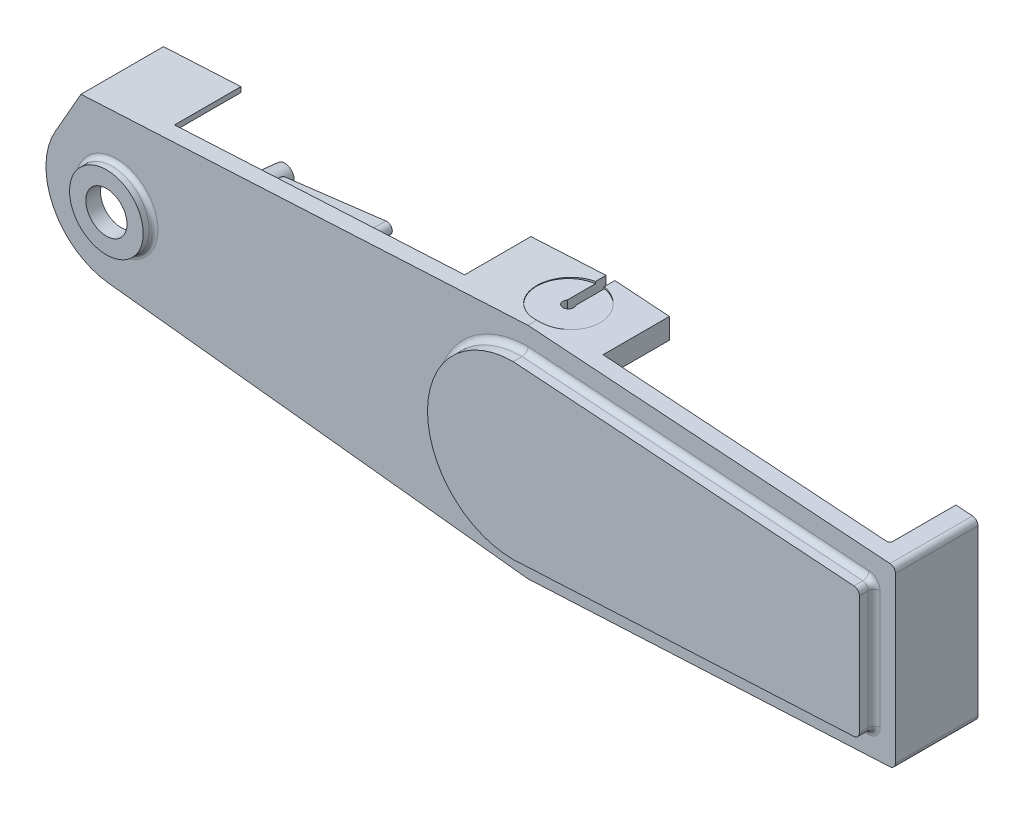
ISO-10303-21;
HEADER;
FILE_DESCRIPTION(('STEP AP214'),'2;1');
FILE_NAME('part.step','',(''),(''),'','','');
FILE_SCHEMA(('AUTOMOTIVE_DESIGN { 1 0 10303 214 1 1 1 1 }'));
ENDSEC;
DATA;
#1=APPLICATION_CONTEXT('core data for automotive mechanical design processes');
#2=APPLICATION_PROTOCOL_DEFINITION('international standard','automotive_design',2000,#1);
#3=PRODUCT_CONTEXT('',#1,'mechanical');
#4=PRODUCT('Part','Part','',(#3));
#5=PRODUCT_RELATED_PRODUCT_CATEGORY('part','',(#4));
#6=PRODUCT_DEFINITION_FORMATION('','',#4);
#7=PRODUCT_DEFINITION_CONTEXT('part definition',#1,'design');
#8=PRODUCT_DEFINITION('design','',#6,#7);
#9=PRODUCT_DEFINITION_SHAPE('','',#8);
#10=(LENGTH_UNIT() NAMED_UNIT(*) SI_UNIT(.MILLI.,.METRE.));
#11=(NAMED_UNIT(*) PLANE_ANGLE_UNIT() SI_UNIT($,.RADIAN.));
#12=(NAMED_UNIT(*) SI_UNIT($,.STERADIAN.) SOLID_ANGLE_UNIT());
#13=UNCERTAINTY_MEASURE_WITH_UNIT(LENGTH_MEASURE(1.E-05),#10,'distance_accuracy_value','');
#14=(GEOMETRIC_REPRESENTATION_CONTEXT(3) GLOBAL_UNCERTAINTY_ASSIGNED_CONTEXT((#13)) GLOBAL_UNIT_ASSIGNED_CONTEXT((#10,
#11,#12)) REPRESENTATION_CONTEXT('',''));
#15=CARTESIAN_POINT('',(0.,0.,0.));
#16=DIRECTION('',(0.,0.,1.));
#17=DIRECTION('',(1.,0.,0.));
#18=AXIS2_PLACEMENT_3D('',#15,#16,#17);
#19=CARTESIAN_POINT('',(-502.022460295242,0.,109.));
#20=DIRECTION('',(0.,0.,1.));
#21=DIRECTION('',(-1.,0.,0.));
#22=AXIS2_PLACEMENT_3D('',#19,#20,#21);
#23=PLANE('',#22);
#24=CARTESIAN_POINT('',(-279.009641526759,4.87772428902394,109.));
#25=DIRECTION('',(0.,0.,1.));
#26=DIRECTION('',(1.,0.,0.));
#27=AXIS2_PLACEMENT_3D('',#24,#25,#26);
#28=CIRCLE('',#27,14.);
#29=CARTESIAN_POINT('',(-265.009641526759,4.87772428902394,109.));
#30=VERTEX_POINT('',#29);
#31=EDGE_CURVE('E641',#30,#30,#28,.T.);
#32=ORIENTED_EDGE('',*,*,#31,.T.);
#33=EDGE_LOOP('',(#32));
#34=FACE_BOUND('',#33,.T.);
#35=CARTESIAN_POINT('',(-120.300341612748,-8.03788906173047,109.));
#36=DIRECTION('',(0.,0.,1.));
#37=DIRECTION('',(1.,0.,0.));
#38=AXIS2_PLACEMENT_3D('',#35,#36,#37);
#39=CIRCLE('',#38,6.68137754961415);
#40=CARTESIAN_POINT('',(-119.486086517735,-14.6694646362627,109.));
#41=VERTEX_POINT('',#40);
#42=CARTESIAN_POINT('',(-121.114596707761,-1.40631348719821,109.));
#43=VERTEX_POINT('',#42);
#44=EDGE_CURVE('E1614',#41,#43,#39,.T.);
#45=ORIENTED_EDGE('',*,*,#44,.T.);
#46=DIRECTION('',(-0.992546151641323,-0.121869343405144,0.));
#47=VECTOR('',#46,1.);
#48=CARTESIAN_POINT('',(-130.340142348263,-2.53906805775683,109.));
#49=LINE('',#48,#47);
#50=CARTESIAN_POINT('',(-128.423160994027,-2.30369234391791,109.));
#51=VERTEX_POINT('',#50);
#52=EDGE_CURVE('E1616',#43,#51,#49,.T.);
#53=ORIENTED_EDGE('',*,*,#52,.T.);
#54=DIRECTION('',(-0.121869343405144,0.992546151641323,0.));
#55=VECTOR('',#54,1.);
#56=CARTESIAN_POINT('',(-134.342187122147,45.9029069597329,109.));
#57=LINE('',#56,#55);
#58=CARTESIAN_POINT('',(-134.106811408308,43.9859256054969,109.));
#59=VERTEX_POINT('',#58);
#60=EDGE_CURVE('E1608',#51,#59,#57,.T.);
#61=ORIENTED_EDGE('',*,*,#60,.T.);
#62=DIRECTION('',(0.992546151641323,0.121869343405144,0.));
#63=VECTOR('',#62,1.);
#64=CARTESIAN_POINT('',(-127.426455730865,44.806170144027,109.));
#65=LINE('',#64,#63);
#66=CARTESIAN_POINT('',(-127.426455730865,44.806170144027,109.));
#67=VERTEX_POINT('',#66);
#68=EDGE_CURVE('E1604',#59,#67,#65,.T.);
#69=ORIENTED_EDGE('',*,*,#68,.T.);
#70=CARTESIAN_POINT('',(-128.240710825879,51.4377457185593,109.));
#71=DIRECTION('',(0.,0.,1.));
#72=DIRECTION('',(1.,0.,0.));
#73=AXIS2_PLACEMENT_3D('',#70,#71,#72);
#74=CIRCLE('',#73,6.68137754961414);
#75=CARTESIAN_POINT('',(-129.054965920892,58.0693212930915,109.));
#76=VERTEX_POINT('',#75);
#77=EDGE_CURVE('E1602',#67,#76,#74,.T.);
#78=ORIENTED_EDGE('',*,*,#77,.T.);
#79=DIRECTION('',(-0.992546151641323,-0.121869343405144,0.));
#80=VECTOR('',#79,1.);
#81=CARTESIAN_POINT('',(-198.036923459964,49.599401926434,109.));
#82=LINE('',#81,#80);
#83=CARTESIAN_POINT('',(-198.036923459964,49.599401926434,109.));
#84=VERTEX_POINT('',#83);
#85=EDGE_CURVE('E1600',#76,#84,#82,.T.);
#86=ORIENTED_EDGE('',*,*,#85,.T.);
#87=CARTESIAN_POINT('',(-197.22266836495,42.9678263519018,109.));
#88=DIRECTION('',(0.,0.,1.));
#89=DIRECTION('',(1.,0.,0.));
#90=AXIS2_PLACEMENT_3D('',#87,#88,#89);
#91=CIRCLE('',#90,6.68137754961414);
#92=CARTESIAN_POINT('',(-196.408413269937,36.3362507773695,109.));
#93=VERTEX_POINT('',#92);
#94=EDGE_CURVE('E1598',#84,#93,#91,.T.);
#95=ORIENTED_EDGE('',*,*,#94,.T.);
#96=DIRECTION('',(0.992546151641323,0.121869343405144,0.));
#97=VECTOR('',#96,1.);
#98=CARTESIAN_POINT('',(-143.642772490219,42.8150568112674,109.));
#99=LINE('',#98,#97);
#100=CARTESIAN_POINT('',(-145.559753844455,42.5796810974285,109.));
#101=VERTEX_POINT('',#100);
#102=EDGE_CURVE('E1594',#93,#101,#99,.T.);
#103=ORIENTED_EDGE('',*,*,#102,.T.);
#104=DIRECTION('',(0.121869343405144,-0.992546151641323,0.));
#105=VECTOR('',#104,1.);
#106=CARTESIAN_POINT('',(-139.640727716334,-5.62691820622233,109.));
#107=LINE('',#106,#105);
#108=CARTESIAN_POINT('',(-139.876103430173,-3.70993685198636,109.));
#109=VERTEX_POINT('',#108);
#110=EDGE_CURVE('E1596',#101,#109,#107,.T.);
#111=ORIENTED_EDGE('',*,*,#110,.T.);
#112=DIRECTION('',(-0.992546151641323,-0.121869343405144,0.));
#113=VECTOR('',#112,1.);
#114=CARTESIAN_POINT('',(-190.096554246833,-9.87623285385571,109.));
#115=LINE('',#114,#113);
#116=CARTESIAN_POINT('',(-190.096554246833,-9.87623285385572,109.));
#117=VERTEX_POINT('',#116);
#118=EDGE_CURVE('E1606',#109,#117,#115,.T.);
#119=ORIENTED_EDGE('',*,*,#118,.T.);
#120=CARTESIAN_POINT('',(-189.28229915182,-16.507808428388,109.));
#121=DIRECTION('',(0.,0.,1.));
#122=DIRECTION('',(1.,0.,0.));
#123=AXIS2_PLACEMENT_3D('',#120,#121,#122);
#124=CIRCLE('',#123,6.68137754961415);
#125=CARTESIAN_POINT('',(-188.468044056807,-23.1393840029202,109.));
#126=VERTEX_POINT('',#125);
#127=EDGE_CURVE('E1610',#117,#126,#124,.T.);
#128=ORIENTED_EDGE('',*,*,#127,.T.);
#129=DIRECTION('',(0.992546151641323,0.121869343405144,0.));
#130=VECTOR('',#129,1.);
#131=CARTESIAN_POINT('',(-119.486086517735,-14.6694646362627,109.));
#132=LINE('',#131,#130);
#133=EDGE_CURVE('E1612',#126,#41,#132,.T.);
#134=ORIENTED_EDGE('',*,*,#133,.T.);
#135=EDGE_LOOP('',(#45,#53,#61,#69,#78,#86,#95,#103,#111,#119,#128,#134));
#136=FACE_BOUND('',#135,.T.);
#137=CARTESIAN_POINT('',(-221.,24.9203834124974,109.));
#138=DIRECTION('',(0.,0.,-1.));
#139=DIRECTION('',(-1.,0.,0.));
#140=AXIS2_PLACEMENT_3D('',#137,#138,#139);
#141=CIRCLE('',#140,11.);
#142=CARTESIAN_POINT('',(-232.,24.9203834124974,109.));
#143=VERTEX_POINT('',#142);
#144=EDGE_CURVE('E1566',#143,#143,#141,.F.);
#145=ORIENTED_EDGE('',*,*,#144,.T.);
#146=EDGE_LOOP('',(#145));
#147=FACE_BOUND('',#146,.T.);
#148=DIRECTION('',(0.,-1.,0.));
#149=VECTOR('',#148,1.);
#150=CARTESIAN_POINT('',(-143.934014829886,-45.0829923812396,109.));
#151=LINE('',#150,#149);
#152=CARTESIAN_POINT('',(-143.934014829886,-45.0829923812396,109.));
#153=VERTEX_POINT('',#152);
#154=CARTESIAN_POINT('',(-143.934014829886,-51.7729194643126,109.));
#155=VERTEX_POINT('',#154);
#156=EDGE_CURVE('E1459',#153,#155,#151,.T.);
#157=ORIENTED_EDGE('',*,*,#156,.F.);
#158=CARTESIAN_POINT('',(-159.009641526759,-45.0829923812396,109.));
#159=DIRECTION('',(0.,0.,1.));
#160=DIRECTION('',(1.,0.,0.));
#161=AXIS2_PLACEMENT_3D('',#158,#159,#160);
#162=CIRCLE('',#161,15.0756266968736);
#163=CARTESIAN_POINT('',(-172.434533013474,-38.2239247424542,109.));
#164=VERTEX_POINT('',#163);
#165=EDGE_CURVE('E1152',#153,#164,#162,.T.);
#166=ORIENTED_EDGE('',*,*,#165,.T.);
#167=DIRECTION('',(-0.690812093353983,0.723034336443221,0.));
#168=VECTOR('',#167,1.);
#169=CARTESIAN_POINT('',(-154.037640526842,-57.4789219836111,109.));
#170=LINE('',#169,#168);
#171=CARTESIAN_POINT('',(-154.037640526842,-57.4789219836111,109.));
#172=VERTEX_POINT('',#171);
#173=EDGE_CURVE('E1438',#172,#164,#170,.T.);
#174=ORIENTED_EDGE('',*,*,#173,.F.);
#175=DIRECTION('',(-0.993950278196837,0.109830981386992,0.));
#176=VECTOR('',#175,1.);
#177=CARTESIAN_POINT('',(-504.099548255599,-18.7972658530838,109.));
#178=LINE('',#177,#176);
#179=CARTESIAN_POINT('',(-284.540021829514,-43.0584776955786,109.));
#180=VERTEX_POINT('',#179);
#181=EDGE_CURVE('E924',#172,#180,#178,.T.);
#182=ORIENTED_EDGE('',*,*,#181,.T.);
#183=CARTESIAN_POINT('',(-279.300028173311,4.36250576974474,109.));
#184=DIRECTION('',(0.,0.,-1.));
#185=DIRECTION('',(-1.,0.,0.));
#186=AXIS2_PLACEMENT_3D('',#183,#184,#185);
#187=CIRCLE('',#186,47.7096133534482);
#188=CARTESIAN_POINT('',(-320.62102566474,28.2116645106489,109.));
#189=VERTEX_POINT('',#188);
#190=EDGE_CURVE('E921',#189,#180,#187,.F.);
#191=ORIENTED_EDGE('',*,*,#190,.F.);
#192=DIRECTION('',(0.495825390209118,0.868422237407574,0.));
#193=VECTOR('',#192,1.);
#194=CARTESIAN_POINT('',(-377.364807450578,-71.1732458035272,109.));
#195=LINE('',#194,#193);
#196=CARTESIAN_POINT('',(-305.32709947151,54.9984847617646,109.));
#197=VERTEX_POINT('',#196);
#198=EDGE_CURVE('E918',#189,#197,#195,.T.);
#199=ORIENTED_EDGE('',*,*,#198,.T.);
#200=DIRECTION('',(-0.998629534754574,-0.0523359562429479,0.));
#201=VECTOR('',#200,1.);
#202=CARTESIAN_POINT('',(-504.358154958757,44.5677091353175,109.));
#203=LINE('',#202,#201);
#204=CARTESIAN_POINT('',(-250.751565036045,57.8586673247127,109.));
#205=VERTEX_POINT('',#204);
#206=EDGE_CURVE('E915',#205,#197,#203,.T.);
#207=ORIENTED_EDGE('',*,*,#206,.F.);
#208=DIRECTION('',(0.,-1.,0.));
#209=VECTOR('',#208,1.);
#210=CARTESIAN_POINT('',(-250.751565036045,0.,109.));
#211=LINE('',#210,#209);
#212=CARTESIAN_POINT('',(-250.751565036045,56.3518055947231,109.));
#213=VERTEX_POINT('',#212);
#214=EDGE_CURVE('E912',#205,#213,#211,.T.);
#215=ORIENTED_EDGE('',*,*,#214,.T.);
#216=DIRECTION('',(-0.998629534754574,-0.0523359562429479,0.));
#217=VECTOR('',#216,1.);
#218=CARTESIAN_POINT('',(-504.27939998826,43.0649747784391,109.));
#219=LINE('',#218,#217);
#220=CARTESIAN_POINT('',(-53.9259948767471,66.6669966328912,109.));
#221=VERTEX_POINT('',#220);
#222=EDGE_CURVE('E909',#221,#213,#219,.T.);
#223=ORIENTED_EDGE('',*,*,#222,.F.);
#224=DIRECTION('',(0.,-1.,0.));
#225=VECTOR('',#224,1.);
#226=CARTESIAN_POINT('',(-53.925994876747,3.45477092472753E-13,109.));
#227=LINE('',#226,#225);
#228=CARTESIAN_POINT('',(-53.9259948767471,62.6738583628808,109.));
#229=VERTEX_POINT('',#228);
#230=EDGE_CURVE('E906',#221,#229,#227,.T.);
#231=ORIENTED_EDGE('',*,*,#230,.T.);
#232=DIRECTION('',(-0.998629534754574,-0.052335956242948,0.));
#233=VECTOR('',#232,1.);
#234=CARTESIAN_POINT('',(-504.070701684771,39.0827739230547,109.));
#235=LINE('',#234,#233);
#236=CARTESIAN_POINT('',(-37.9524627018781,63.5109957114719,109.));
#237=VERTEX_POINT('',#236);
#238=EDGE_CURVE('E903',#237,#229,#235,.T.);
#239=ORIENTED_EDGE('',*,*,#238,.F.);
#240=CARTESIAN_POINT('',(-37.8216228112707,61.0144218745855,109.));
#241=DIRECTION('',(0.,0.,-1.));
#242=DIRECTION('',(-1.,0.,0.));
#243=AXIS2_PLACEMENT_3D('',#240,#241,#242);
#244=CIRCLE('',#243,2.50000000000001);
#245=CARTESIAN_POINT('',(-35.6014107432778,62.1636208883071,109.));
#246=VERTEX_POINT('',#245);
#247=EDGE_CURVE('E900',#237,#246,#244,.T.);
#248=ORIENTED_EDGE('',*,*,#247,.T.);
#249=CARTESIAN_POINT('',(-30.2729017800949,64.9216985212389,109.));
#250=DIRECTION('',(0.,0.,-1.));
#251=DIRECTION('',(-1.,0.,0.));
#252=AXIS2_PLACEMENT_3D('',#249,#250,#251);
#253=CIRCLE('',#252,5.99999999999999);
#254=CARTESIAN_POINT('',(-29.9588860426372,58.9299213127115,109.));
#255=VERTEX_POINT('',#254);
#256=EDGE_CURVE('E897',#246,#255,#253,.F.);
#257=ORIENTED_EDGE('',*,*,#256,.T.);
#258=DIRECTION('',(0.998629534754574,0.0523359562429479,0.));
#259=VECTOR('',#258,1.);
#260=CARTESIAN_POINT('',(-503.809380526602,34.096469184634,109.));
#261=LINE('',#260,#259);
#262=CARTESIAN_POINT('',(0.,60.4999999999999,109.));
#263=VERTEX_POINT('',#262);
#264=EDGE_CURVE('E894',#255,#263,#261,.T.);
#265=ORIENTED_EDGE('',*,*,#264,.T.);
#266=DIRECTION('',(0.997564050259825,-0.0697564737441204,0.));
#267=VECTOR('',#266,1.);
#268=CARTESIAN_POINT('',(-495.36964995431,95.1396203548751,109.));
#269=LINE('',#268,#267);
#270=CARTESIAN_POINT('',(40.,57.7029275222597,109.));
#271=VERTEX_POINT('',#270);
#272=EDGE_CURVE('E891',#263,#271,#269,.T.);
#273=ORIENTED_EDGE('',*,*,#272,.T.);
#274=DIRECTION('',(0.,1.,0.));
#275=VECTOR('',#274,1.);
#276=CARTESIAN_POINT('',(40.,2.68645453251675E-13,109.));
#277=LINE('',#276,#275);
#278=CARTESIAN_POINT('',(40.,66.6907180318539,109.));
#279=VERTEX_POINT('',#278);
#280=EDGE_CURVE('E888',#271,#279,#277,.T.);
#281=ORIENTED_EDGE('',*,*,#280,.T.);
#282=DIRECTION('',(-0.997564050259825,0.0697564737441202,0.));
#283=VECTOR('',#282,1.);
#284=CARTESIAN_POINT('',(-494.744220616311,104.083676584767,109.));
#285=LINE('',#284,#283);
#286=CARTESIAN_POINT('',(232.556300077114,53.2258698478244,109.));
#287=VERTEX_POINT('',#286);
#288=EDGE_CURVE('E885',#287,#279,#285,.T.);
#289=ORIENTED_EDGE('',*,*,#288,.F.);
#290=CARTESIAN_POINT('',(232.416787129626,51.2307417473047,109.));
#291=DIRECTION('',(0.,0.,-1.));
#292=DIRECTION('',(-1.,0.,0.));
#293=AXIS2_PLACEMENT_3D('',#290,#291,#292);
#294=CIRCLE('',#293,2.);
#295=CARTESIAN_POINT('',(234.416787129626,51.2307417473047,109.));
#296=VERTEX_POINT('',#295);
#297=EDGE_CURVE('E1482',#296,#287,#294,.F.);
#298=ORIENTED_EDGE('',*,*,#297,.F.);
#299=DIRECTION('',(0.,-1.,0.));
#300=VECTOR('',#299,1.);
#301=CARTESIAN_POINT('',(234.416787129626,0.,109.));
#302=LINE('',#301,#300);
#303=CARTESIAN_POINT('',(234.416787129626,49.7406144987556,109.));
#304=VERTEX_POINT('',#303);
#305=EDGE_CURVE('E882',#296,#304,#302,.T.);
#306=ORIENTED_EDGE('',*,*,#305,.T.);
#307=CARTESIAN_POINT('',(239.391012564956,49.7406144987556,109.));
#308=DIRECTION('',(0.,0.,-1.));
#309=DIRECTION('',(-1.,0.,0.));
#310=AXIS2_PLACEMENT_3D('',#307,#308,#309);
#311=CIRCLE('',#310,4.9742254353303);
#312=CARTESIAN_POINT('',(239.391012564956,44.7663890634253,109.));
#313=VERTEX_POINT('',#312);
#314=EDGE_CURVE('E879',#313,#304,#311,.T.);
#315=ORIENTED_EDGE('',*,*,#314,.F.);
#316=DIRECTION('',(-1.,0.,0.));
#317=VECTOR('',#316,1.);
#318=CARTESIAN_POINT('',(-502.022460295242,44.7663890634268,109.));
#319=LINE('',#318,#317);
#320=CARTESIAN_POINT('',(242.891012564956,44.7663890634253,109.));
#321=VERTEX_POINT('',#320);
#322=EDGE_CURVE('E876',#321,#313,#319,.T.);
#323=ORIENTED_EDGE('',*,*,#322,.F.);
#324=CARTESIAN_POINT('',(242.891012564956,41.7663890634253,109.));
#325=DIRECTION('',(0.,0.,-1.));
#326=DIRECTION('',(-1.,0.,0.));
#327=AXIS2_PLACEMENT_3D('',#324,#325,#326);
#328=CIRCLE('',#327,3.);
#329=CARTESIAN_POINT('',(245.891012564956,41.7663890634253,109.));
#330=VERTEX_POINT('',#329);
#331=EDGE_CURVE('E873',#321,#330,#328,.T.);
#332=ORIENTED_EDGE('',*,*,#331,.T.);
#333=DIRECTION('',(0.,1.,0.));
#334=VECTOR('',#333,1.);
#335=CARTESIAN_POINT('',(245.891012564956,0.,109.));
#336=LINE('',#335,#334);
#337=CARTESIAN_POINT('',(245.891012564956,-45.4326399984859,109.));
#338=VERTEX_POINT('',#337);
#339=EDGE_CURVE('E870',#338,#330,#336,.T.);
#340=ORIENTED_EDGE('',*,*,#339,.F.);
#341=CARTESIAN_POINT('',(242.891012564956,-45.4326399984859,109.));
#342=DIRECTION('',(0.,0.,-1.));
#343=DIRECTION('',(-1.,0.,0.));
#344=AXIS2_PLACEMENT_3D('',#341,#342,#343);
#345=CIRCLE('',#344,3.);
#346=CARTESIAN_POINT('',(242.891012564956,-48.4326399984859,109.));
#347=VERTEX_POINT('',#346);
#348=EDGE_CURVE('E867',#347,#338,#345,.F.);
#349=ORIENTED_EDGE('',*,*,#348,.F.);
#350=DIRECTION('',(-1.,0.,0.));
#351=VECTOR('',#350,1.);
#352=CARTESIAN_POINT('',(-502.022460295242,-48.4326399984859,109.));
#353=LINE('',#352,#351);
#354=CARTESIAN_POINT('',(239.391012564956,-48.4326399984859,109.));
#355=VERTEX_POINT('',#354);
#356=EDGE_CURVE('E864',#347,#355,#353,.T.);
#357=ORIENTED_EDGE('',*,*,#356,.T.);
#358=CARTESIAN_POINT('',(239.391012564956,-54.4326399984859,109.));
#359=DIRECTION('',(0.,0.,-1.));
#360=DIRECTION('',(-1.,0.,0.));
#361=AXIS2_PLACEMENT_3D('',#358,#359,#360);
#362=CIRCLE('',#361,6.00000000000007);
#363=CARTESIAN_POINT('',(233.391012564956,-54.4326399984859,109.));
#364=VERTEX_POINT('',#363);
#365=EDGE_CURVE('E930',#364,#355,#362,.T.);
#366=ORIENTED_EDGE('',*,*,#365,.F.);
#367=DIRECTION('',(0.,1.,0.));
#368=VECTOR('',#367,1.);
#369=CARTESIAN_POINT('',(233.391012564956,0.,109.));
#370=LINE('',#369,#368);
#371=CARTESIAN_POINT('',(233.391012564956,-55.8368372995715,109.));
#372=VERTEX_POINT('',#371);
#373=EDGE_CURVE('E927',#372,#364,#370,.T.);
#374=ORIENTED_EDGE('',*,*,#373,.F.);
#375=CARTESIAN_POINT('',(231.391012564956,-55.8368372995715,109.));
#376=DIRECTION('',(0.,0.,-1.));
#377=DIRECTION('',(-1.,0.,0.));
#378=AXIS2_PLACEMENT_3D('',#375,#376,#377);
#379=CIRCLE('',#378,2.);
#380=CARTESIAN_POINT('',(231.491617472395,-57.8343053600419,109.));
#381=VERTEX_POINT('',#380);
#382=EDGE_CURVE('E1500',#381,#372,#379,.F.);
#383=ORIENTED_EDGE('',*,*,#382,.F.);
#384=DIRECTION('',(-0.998734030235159,-0.0503024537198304,0.));
#385=VECTOR('',#384,1.);
#386=CARTESIAN_POINT('',(12.2091777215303,-68.8787320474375,109.));
#387=LINE('',#386,#385);
#388=CARTESIAN_POINT('',(17.3220688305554,-68.6212150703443,109.));
#389=VERTEX_POINT('',#388);
#390=EDGE_CURVE('E769',#381,#389,#387,.T.);
#391=ORIENTED_EDGE('',*,*,#390,.T.);
#392=CARTESIAN_POINT('',(17.2214639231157,-66.623747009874,109.));
#393=DIRECTION('',(0.,0.,-1.));
#394=DIRECTION('',(0.998734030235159,0.0503024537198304,0.));
#395=AXIS2_PLACEMENT_3D('',#392,#393,#394);
#396=ELLIPSE('',#395,2.00765901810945,2.);
#397=CARTESIAN_POINT('',(15.213824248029,-66.6245151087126,109.));
#398=VERTEX_POINT('',#397);
#399=EDGE_CURVE('E1535',#398,#389,#396,.F.);
#400=ORIENTED_EDGE('',*,*,#399,.F.);
#401=DIRECTION('',(0.,-1.,0.));
#402=VECTOR('',#401,1.);
#403=CARTESIAN_POINT('',(15.213824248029,-73.6098668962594,109.));
#404=LINE('',#403,#402);
#405=CARTESIAN_POINT('',(15.213824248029,-62.887221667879,109.));
#406=VERTEX_POINT('',#405);
#407=EDGE_CURVE('E1405',#406,#398,#404,.T.);
#408=ORIENTED_EDGE('',*,*,#407,.F.);
#409=CARTESIAN_POINT('',(0.,-66.5,109.));
#410=DIRECTION('',(0.,0.,1.));
#411=DIRECTION('',(1.,0.,0.));
#412=AXIS2_PLACEMENT_3D('',#409,#410,#411);
#413=CIRCLE('',#412,15.6368991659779);
#414=CARTESIAN_POINT('',(-15.2353568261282,-62.9791310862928,109.));
#415=VERTEX_POINT('',#414);
#416=EDGE_CURVE('E1400',#406,#415,#413,.T.);
#417=ORIENTED_EDGE('',*,*,#416,.T.);
#418=DIRECTION('',(0.,1.,0.));
#419=VECTOR('',#418,1.);
#420=CARTESIAN_POINT('',(-15.2353568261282,-73.3288760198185,109.));
#421=LINE('',#420,#419);
#422=CARTESIAN_POINT('',(-15.2353568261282,-65.5537373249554,109.));
#423=VERTEX_POINT('',#422);
#424=EDGE_CURVE('E1122',#423,#415,#421,.T.);
#425=ORIENTED_EDGE('',*,*,#424,.F.);
#426=CARTESIAN_POINT('',(-17.2429965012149,-65.5520521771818,109.));
#427=DIRECTION('',(0.,0.,-1.));
#428=DIRECTION('',(-0.993950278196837,0.109830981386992,0.));
#429=AXIS2_PLACEMENT_3D('',#426,#427,#428);
#430=ELLIPSE('',#429,2.00773277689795,2.);
#431=CARTESIAN_POINT('',(-17.4626584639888,-67.5399527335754,109.));
#432=VERTEX_POINT('',#431);
#433=EDGE_CURVE('E1518',#432,#423,#430,.F.);
#434=ORIENTED_EDGE('',*,*,#433,.F.);
#435=DIRECTION('',(-0.993950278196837,0.109830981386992,0.));
#436=VECTOR('',#435,1.);
#437=CARTESIAN_POINT('',(-151.35465542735,-52.7449577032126,109.));
#438=LINE('',#437,#436);
#439=CARTESIAN_POINT('',(-142.146037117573,-53.7625051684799,109.));
#440=VERTEX_POINT('',#439);
#441=EDGE_CURVE('E1121',#432,#440,#438,.T.);
#442=ORIENTED_EDGE('',*,*,#441,.T.);
#443=CARTESIAN_POINT('',(-141.926375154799,-51.7746046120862,109.));
#444=DIRECTION('',(0.,0.,-1.));
#445=DIRECTION('',(0.993950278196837,-0.109830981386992,0.));
#446=AXIS2_PLACEMENT_3D('',#443,#444,#445);
#447=ELLIPSE('',#446,2.00773277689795,2.);
#448=EDGE_CURVE('E1558',#155,#440,#447,.F.);
#449=ORIENTED_EDGE('',*,*,#448,.F.);
#450=EDGE_LOOP('',(#157,#166,#174,#182,#191,#199,#207,#215,#223,#231,#239,#248,#257,#265,#273,
#281,#289,#298,#306,#315,#323,#332,#340,#349,#357,#366,#374,#383,#391,#400,#408,#417,#425,#434,
#442,#449));
#451=FACE_BOUND('',#450,.T.);
#452=ADVANCED_FACE('F35',(#34,#136,#147,#451),#23,.F.);
#453=CARTESIAN_POINT('',(-196.643788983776,38.2532321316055,109.));
#454=DIRECTION('',(0.121795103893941,-0.991941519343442,-0.034899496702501));
#455=DIRECTION('',(0.992546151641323,0.121869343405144,0.));
#456=AXIS2_PLACEMENT_3D('',#453,#454,#455);
#457=PLANE('',#456);
#458=DIRECTION('',(0.00425317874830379,-0.0346393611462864,0.999390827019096));
#459=VECTOR('',#458,1.);
#460=CARTESIAN_POINT('',(-127.661831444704,46.723151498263,109.));
#461=LINE('',#460,#459);
#462=CARTESIAN_POINT('',(-127.787376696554,47.7456355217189,79.5));
#463=VERTEX_POINT('',#462);
#464=CARTESIAN_POINT('',(-127.670045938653,46.7900531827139,107.069798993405));
#465=VERTEX_POINT('',#464);
#466=EDGE_CURVE('E687',#463,#465,#461,.T.);
#467=ORIENTED_EDGE('',*,*,#466,.T.);
#468=DIRECTION('',(-0.992546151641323,-0.121869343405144,0.));
#469=VECTOR('',#468,1.);
#470=CARTESIAN_POINT('',(-136.267382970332,45.7344329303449,107.069798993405));
#471=LINE('',#470,#469);
#472=CARTESIAN_POINT('',(-136.334284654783,45.7262184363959,107.069798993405));
#473=VERTEX_POINT('',#472);
#474=EDGE_CURVE('E1625',#465,#473,#471,.T.);
#475=ORIENTED_EDGE('',*,*,#474,.T.);
#476=DIRECTION('',(-0.0388688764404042,0.0303676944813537,-0.998782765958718));
#477=VECTOR('',#476,1.);
#478=CARTESIAN_POINT('',(-137.193158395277,46.3972441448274,85.));
#479=LINE('',#478,#477);
#480=CARTESIAN_POINT('',(-137.193158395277,46.3972441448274,85.));
#481=VERTEX_POINT('',#480);
#482=EDGE_CURVE('E656',#473,#481,#479,.T.);
#483=ORIENTED_EDGE('',*,*,#482,.T.);
#484=DIRECTION('',(-0.992546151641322,-0.121869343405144,0.));
#485=VECTOR('',#484,1.);
#486=CARTESIAN_POINT('',(-144.140981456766,45.5441587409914,85.));
#487=LINE('',#486,#485);
#488=CARTESIAN_POINT('',(-143.148435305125,45.6660280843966,85.));
#489=VERTEX_POINT('',#488);
#490=EDGE_CURVE('E658',#489,#481,#487,.F.);
#491=ORIENTED_EDGE('',*,*,#490,.F.);
#492=DIRECTION('',(0.0303676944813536,0.0388688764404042,-0.998782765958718));
#493=VECTOR('',#492,1.);
#494=CARTESIAN_POINT('',(-143.15038216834,45.6635362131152,85.0640316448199));
#495=LINE('',#494,#493);
#496=CARTESIAN_POINT('',(-143.819461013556,44.8071543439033,107.069798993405));
#497=VERTEX_POINT('',#496);
#498=EDGE_CURVE('E648',#497,#489,#495,.T.);
#499=ORIENTED_EDGE('',*,*,#498,.F.);
#500=DIRECTION('',(-0.992546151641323,-0.121869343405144,0.));
#501=VECTOR('',#500,1.);
#502=CARTESIAN_POINT('',(-196.652003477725,38.3201338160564,107.069798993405));
#503=LINE('',#502,#501);
#504=CARTESIAN_POINT('',(-196.652003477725,38.3201338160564,107.069798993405));
#505=VERTEX_POINT('',#504);
#506=EDGE_CURVE('E1623',#497,#505,#503,.T.);
#507=ORIENTED_EDGE('',*,*,#506,.T.);
#508=DIRECTION('',(0.00425317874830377,-0.0346393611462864,0.999390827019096));
#509=VECTOR('',#508,1.);
#510=CARTESIAN_POINT('',(-196.643788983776,38.2532321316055,109.));
#511=LINE('',#510,#509);
#512=CARTESIAN_POINT('',(-196.769334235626,39.2757161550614,79.5));
#513=VERTEX_POINT('',#512);
#514=EDGE_CURVE('E691',#513,#505,#511,.T.);
#515=ORIENTED_EDGE('',*,*,#514,.F.);
#516=DIRECTION('',(0.992546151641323,0.121869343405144,0.));
#517=VECTOR('',#516,1.);
#518=CARTESIAN_POINT('',(-196.769334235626,39.2757161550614,79.5));
#519=LINE('',#518,#517);
#520=EDGE_CURVE('E700',#463,#513,#519,.F.);
#521=ORIENTED_EDGE('',*,*,#520,.F.);
#522=EDGE_LOOP('',(#467,#475,#483,#491,#499,#507,#515,#521));
#523=FACE_BOUND('',#522,.T.);
#524=ADVANCED_FACE('F1217',(#523),#457,.T.);
#525=CARTESIAN_POINT('',(-120.879220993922,-3.32329484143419,109.));
#526=DIRECTION('',(-0.121795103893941,0.991941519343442,-0.034899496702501));
#527=DIRECTION('',(-0.992546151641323,-0.121869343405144,0.));
#528=AXIS2_PLACEMENT_3D('',#525,#526,#527);
#529=PLANE('',#528);
#530=DIRECTION('',(-0.0303676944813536,-0.0388688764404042,-0.998782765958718));
#531=VECTOR('',#530,1.);
#532=CARTESIAN_POINT('',(-130.834479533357,-5.39003933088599,85.));
#533=LINE('',#532,#531);
#534=CARTESIAN_POINT('',(-130.163453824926,-4.53116559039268,107.069798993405));
#535=VERTEX_POINT('',#534);
#536=CARTESIAN_POINT('',(-130.834479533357,-5.39003933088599,85.));
#537=VERTEX_POINT('',#536);
#538=EDGE_CURVE('E655',#535,#537,#533,.T.);
#539=ORIENTED_EDGE('',*,*,#538,.F.);
#540=DIRECTION('',(0.992546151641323,0.121869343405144,0.));
#541=VECTOR('',#540,1.);
#542=CARTESIAN_POINT('',(-120.871006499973,-3.3901965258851,107.069798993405));
#543=LINE('',#542,#541);
#544=CARTESIAN_POINT('',(-120.871006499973,-3.3901965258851,107.069798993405));
#545=VERTEX_POINT('',#544);
#546=EDGE_CURVE('E1591',#535,#545,#543,.T.);
#547=ORIENTED_EDGE('',*,*,#546,.T.);
#548=DIRECTION('',(-0.00425317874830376,0.0346393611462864,0.999390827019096));
#549=VECTOR('',#548,1.);
#550=CARTESIAN_POINT('',(-120.879220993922,-3.32329484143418,109.));
#551=LINE('',#550,#549);
#552=CARTESIAN_POINT('',(-120.753675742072,-4.34577886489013,79.5));
#553=VERTEX_POINT('',#552);
#554=EDGE_CURVE('E671',#553,#545,#551,.T.);
#555=ORIENTED_EDGE('',*,*,#554,.F.);
#556=DIRECTION('',(-0.992546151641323,-0.121869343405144,0.));
#557=VECTOR('',#556,1.);
#558=CARTESIAN_POINT('',(-120.753675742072,-4.34577886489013,79.5));
#559=LINE('',#558,#557);
#560=CARTESIAN_POINT('',(-189.735633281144,-12.8156982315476,79.5));
#561=VERTEX_POINT('',#560);
#562=EDGE_CURVE('E675',#561,#553,#559,.F.);
#563=ORIENTED_EDGE('',*,*,#562,.F.);
#564=DIRECTION('',(-0.00425317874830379,0.0346393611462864,0.999390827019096));
#565=VECTOR('',#564,1.);
#566=CARTESIAN_POINT('',(-189.861178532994,-11.7932142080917,109.));
#567=LINE('',#566,#565);
#568=CARTESIAN_POINT('',(-189.852964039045,-11.8601158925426,107.069798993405));
#569=VERTEX_POINT('',#568);
#570=EDGE_CURVE('E674',#561,#569,#567,.T.);
#571=ORIENTED_EDGE('',*,*,#570,.T.);
#572=DIRECTION('',(0.992546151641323,0.121869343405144,0.));
#573=VECTOR('',#572,1.);
#574=CARTESIAN_POINT('',(-137.715531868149,-5.45844417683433,107.069798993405));
#575=LINE('',#574,#573);
#576=CARTESIAN_POINT('',(-137.648630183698,-5.45022968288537,107.069798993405));
#577=VERTEX_POINT('',#576);
#578=EDGE_CURVE('E1589',#569,#577,#575,.T.);
#579=ORIENTED_EDGE('',*,*,#578,.T.);
#580=DIRECTION('',(0.0388688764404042,-0.0303676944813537,-0.998782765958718));
#581=VECTOR('',#580,1.);
#582=CARTESIAN_POINT('',(-136.86049061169,-6.0659918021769,86.8175999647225));
#583=LINE('',#582,#581);
#584=CARTESIAN_POINT('',(-136.789756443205,-6.12125539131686,85.));
#585=VERTEX_POINT('',#584);
#586=EDGE_CURVE('E650',#577,#585,#583,.T.);
#587=ORIENTED_EDGE('',*,*,#586,.T.);
#588=DIRECTION('',(0.992546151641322,0.121869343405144,0.));
#589=VECTOR('',#588,1.);
#590=CARTESIAN_POINT('',(-137.782302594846,-6.243124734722,85.));
#591=LINE('',#590,#589);
#592=EDGE_CURVE('E662',#537,#585,#591,.F.);
#593=ORIENTED_EDGE('',*,*,#592,.F.);
#594=EDGE_LOOP('',(#539,#547,#555,#563,#571,#579,#587,#593));
#595=FACE_BOUND('',#594,.T.);
#596=ADVANCED_FACE('F1049',(#595),#529,.T.);
#597=CARTESIAN_POINT('',(0.,0.,124.));
#598=DIRECTION('',(0.,0.,-1.));
#599=DIRECTION('',(1.,0.,0.));
#600=AXIS2_PLACEMENT_3D('',#597,#598,#599);
#601=CYLINDRICAL_SURFACE('',#600,58.1349698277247);
#602=DIRECTION('',(0.,0.,-1.));
#603=VECTOR('',#602,1.);
#604=CARTESIAN_POINT('',(0.,-58.1349698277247,124.));
#605=LINE('',#604,#603);
#606=CARTESIAN_POINT('',(0.,-58.1349698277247,122.));
#607=VERTEX_POINT('',#606);
#608=CARTESIAN_POINT('',(0.,-58.1349698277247,116.));
#609=VERTEX_POINT('',#608);
#610=EDGE_CURVE('E1911',#607,#609,#605,.T.);
#611=ORIENTED_EDGE('',*,*,#610,.F.);
#612=CARTESIAN_POINT('',(0.,0.,122.));
#613=DIRECTION('',(0.,0.,1.));
#614=DIRECTION('',(1.,0.,0.));
#615=AXIS2_PLACEMENT_3D('',#612,#613,#614);
#616=CIRCLE('',#615,58.1349698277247);
#617=CARTESIAN_POINT('',(0.,58.1349698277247,122.));
#618=VERTEX_POINT('',#617);
#619=EDGE_CURVE('E690',#607,#618,#616,.F.);
#620=ORIENTED_EDGE('',*,*,#619,.T.);
#621=DIRECTION('',(0.,0.,-1.));
#622=VECTOR('',#621,1.);
#623=CARTESIAN_POINT('',(0.,58.1349698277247,124.));
#624=LINE('',#623,#622);
#625=CARTESIAN_POINT('',(0.,58.1349698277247,116.));
#626=VERTEX_POINT('',#625);
#627=EDGE_CURVE('E1904',#618,#626,#624,.T.);
#628=ORIENTED_EDGE('',*,*,#627,.T.);
#629=CARTESIAN_POINT('',(0.,0.,116.));
#630=DIRECTION('',(0.,0.,1.));
#631=DIRECTION('',(1.,0.,0.));
#632=AXIS2_PLACEMENT_3D('',#629,#630,#631);
#633=CIRCLE('',#632,58.1349698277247);
#634=EDGE_CURVE('E1397',#609,#626,#633,.F.);
#635=ORIENTED_EDGE('',*,*,#634,.F.);
#636=EDGE_LOOP('',(#611,#620,#628,#635));
#637=FACE_BOUND('',#636,.T.);
#638=ADVANCED_FACE('F1045',(#637),#601,.T.);
#639=CARTESIAN_POINT('',(-38.8093144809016,-463.21314581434,56.));
#640=DIRECTION('',(0.,0.,-1.));
#641=DIRECTION('',(1.,0.,0.));
#642=AXIS2_PLACEMENT_3D('',#639,#640,#641);
#643=PLANE('',#642);
#644=DIRECTION('',(0.,1.,0.));
#645=VECTOR('',#644,1.);
#646=CARTESIAN_POINT('',(3.,43.,56.));
#647=LINE('',#646,#645);
#648=CARTESIAN_POINT('',(3.00000000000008,60.2902195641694,56.));
#649=VERTEX_POINT('',#648);
#650=CARTESIAN_POINT('',(3.,74.2902195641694,56.));
#651=VERTEX_POINT('',#650);
#652=EDGE_CURVE('E720',#649,#651,#647,.T.);
#653=ORIENTED_EDGE('',*,*,#652,.T.);
#654=DIRECTION('',(0.997564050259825,-0.0697564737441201,0.));
#655=VECTOR('',#654,1.);
#656=CARTESIAN_POINT('',(-1.20286672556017,74.5841126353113,56.));
#657=LINE('',#656,#655);
#658=CARTESIAN_POINT('',(40.,71.7029275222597,56.));
#659=VERTEX_POINT('',#658);
#660=EDGE_CURVE('E1334',#651,#659,#657,.T.);
#661=ORIENTED_EDGE('',*,*,#660,.T.);
#662=DIRECTION('',(0.,1.,0.));
#663=VECTOR('',#662,1.);
#664=CARTESIAN_POINT('',(40.,2.68645453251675E-13,56.));
#665=LINE('',#664,#663);
#666=CARTESIAN_POINT('',(40.,57.7029275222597,56.));
#667=VERTEX_POINT('',#666);
#668=EDGE_CURVE('E834',#667,#659,#665,.T.);
#669=ORIENTED_EDGE('',*,*,#668,.F.);
#670=DIRECTION('',(0.997564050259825,-0.0697564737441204,0.));
#671=VECTOR('',#670,1.);
#672=CARTESIAN_POINT('',(-495.36964995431,95.1396203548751,56.));
#673=LINE('',#672,#671);
#674=EDGE_CURVE('E837',#649,#667,#673,.T.);
#675=ORIENTED_EDGE('',*,*,#674,.F.);
#676=EDGE_LOOP('',(#653,#661,#669,#675));
#677=FACE_BOUND('',#676,.T.);
#678=ADVANCED_FACE('F1048',(#677),#643,.T.);
#679=CARTESIAN_POINT('',(-1.11006844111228E-13,81.,84.5));
#680=DIRECTION('',(0.,-1.,0.));
#681=DIRECTION('',(0.,0.,1.));
#682=AXIS2_PLACEMENT_3D('',#679,#680,#681);
#683=CYLINDRICAL_SURFACE('',#682,21.5);
#684=CARTESIAN_POINT('',(-1.11006844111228E-13,73.,84.5));
#685=DIRECTION('',(0.,1.,0.));
#686=DIRECTION('',(0.,0.,1.));
#687=AXIS2_PLACEMENT_3D('',#684,#685,#686);
#688=CIRCLE('',#687,21.5);
#689=CARTESIAN_POINT('',(21.4509993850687,73.,83.0492672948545));
#690=VERTEX_POINT('',#689);
#691=CARTESIAN_POINT('',(3.,73.,63.2103311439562));
#692=VERTEX_POINT('',#691);
#693=EDGE_CURVE('E751',#690,#692,#688,.T.);
#694=ORIENTED_EDGE('',*,*,#693,.F.);
#695=CARTESIAN_POINT('',(-1.11006844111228E-13,74.4999999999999,84.5));
#696=DIRECTION('',(-0.0697564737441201,-0.997564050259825,0.));
#697=DIRECTION('',(0.997564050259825,-0.0697564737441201,0.));
#698=AXIS2_PLACEMENT_3D('',#695,#696,#697);
#699=ELLIPSE('',#698,21.5525008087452,21.5);
#700=CARTESIAN_POINT('',(3.,74.2902195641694,63.2103311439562));
#701=VERTEX_POINT('',#700);
#702=EDGE_CURVE('E754',#701,#690,#699,.T.);
#703=ORIENTED_EDGE('',*,*,#702,.F.);
#704=DIRECTION('',(0.,-1.,0.));
#705=VECTOR('',#704,1.);
#706=CARTESIAN_POINT('',(3.,81.,63.2103311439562));
#707=LINE('',#706,#705);
#708=EDGE_CURVE('E743',#692,#701,#707,.F.);
#709=ORIENTED_EDGE('',*,*,#708,.F.);
#710=EDGE_LOOP('',(#694,#703,#709));
#711=FACE_BOUND('',#710,.T.);
#712=ADVANCED_FACE('F1055',(#711),#683,.F.);
#713=CARTESIAN_POINT('',(-38.8093144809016,-463.21314581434,112.));
#714=DIRECTION('',(0.,0.,-1.));
#715=DIRECTION('',(1.,0.,0.));
#716=AXIS2_PLACEMENT_3D('',#713,#714,#715);
#717=PLANE('',#716);
#718=CARTESIAN_POINT('',(-279.009641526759,4.87772428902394,112.));
#719=DIRECTION('',(0.,0.,1.));
#720=DIRECTION('',(1.,0.,0.));
#721=AXIS2_PLACEMENT_3D('',#718,#719,#720);
#722=CIRCLE('',#721,28.);
#723=CARTESIAN_POINT('',(-251.009641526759,4.87772428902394,112.));
#724=VERTEX_POINT('',#723);
#725=EDGE_CURVE('E1572',#724,#724,#722,.T.);
#726=ORIENTED_EDGE('',*,*,#725,.F.);
#727=EDGE_LOOP('',(#726));
#728=FACE_BOUND('',#727,.T.);
#729=DIRECTION('',(0.998734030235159,0.0503024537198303,0.));
#730=VECTOR('',#729,1.);
#731=CARTESIAN_POINT('',(-58.2395850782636,-77.4333075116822,112.));
#732=LINE('',#731,#730);
#733=CARTESIAN_POINT('',(0.,-74.5,112.));
#734=VERTEX_POINT('',#733);
#735=CARTESIAN_POINT('',(245.592222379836,-62.1304491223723,112.));
#736=VERTEX_POINT('',#735);
#737=EDGE_CURVE('E1903',#734,#736,#732,.T.);
#738=ORIENTED_EDGE('',*,*,#737,.T.);
#739=CARTESIAN_POINT('',(245.391012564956,-58.1355130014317,112.));
#740=DIRECTION('',(0.,0.,1.));
#741=DIRECTION('',(1.,0.,0.));
#742=AXIS2_PLACEMENT_3D('',#739,#740,#741);
#743=CIRCLE('',#742,4.00000000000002);
#744=CARTESIAN_POINT('',(249.391012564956,-58.1355130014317,112.));
#745=VERTEX_POINT('',#744);
#746=EDGE_CURVE('E1868',#736,#745,#743,.T.);
#747=ORIENTED_EDGE('',*,*,#746,.T.);
#748=DIRECTION('',(0.,-1.,0.));
#749=VECTOR('',#748,1.);
#750=CARTESIAN_POINT('',(249.391012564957,-463.21314581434,112.));
#751=LINE('',#750,#749);
#752=CARTESIAN_POINT('',(249.391012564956,53.3308212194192,112.));
#753=VERTEX_POINT('',#752);
#754=EDGE_CURVE('E1865',#753,#745,#751,.T.);
#755=ORIENTED_EDGE('',*,*,#754,.F.);
#756=CARTESIAN_POINT('',(245.391012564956,53.3308212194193,112.));
#757=DIRECTION('',(0.,0.,1.));
#758=DIRECTION('',(1.,0.,0.));
#759=AXIS2_PLACEMENT_3D('',#756,#757,#758);
#760=CIRCLE('',#759,3.99999999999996);
#761=CARTESIAN_POINT('',(245.670038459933,57.3210774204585,112.));
#762=VERTEX_POINT('',#761);
#763=EDGE_CURVE('E1847',#753,#762,#760,.T.);
#764=ORIENTED_EDGE('',*,*,#763,.T.);
#765=DIRECTION('',(0.997564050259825,-0.0697564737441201,0.));
#766=VECTOR('',#765,1.);
#767=CARTESIAN_POINT('',(-1.20286672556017,74.5841126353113,112.));
#768=LINE('',#767,#766);
#769=CARTESIAN_POINT('',(-1.11006844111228E-13,74.4999999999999,112.));
#770=VERTEX_POINT('',#769);
#771=EDGE_CURVE('E1845',#770,#762,#768,.T.);
#772=ORIENTED_EDGE('',*,*,#771,.F.);
#773=DIRECTION('',(0.998629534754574,0.0523359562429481,0.));
#774=VECTOR('',#773,1.);
#775=CARTESIAN_POINT('',(-66.8061781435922,70.9988365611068,112.));
#776=LINE('',#775,#774);
#777=CARTESIAN_POINT('',(-303.267137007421,58.606442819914,112.));
#778=VERTEX_POINT('',#777);
#779=EDGE_CURVE('E1833',#778,#770,#776,.T.);
#780=ORIENTED_EDGE('',*,*,#779,.F.);
#781=DIRECTION('',(-0.495825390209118,-0.868422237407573,0.));
#782=VECTOR('',#781,1.);
#783=CARTESIAN_POINT('',(-462.940183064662,-221.055766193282,112.));
#784=LINE('',#783,#782);
#785=CARTESIAN_POINT('',(-320.62102566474,28.2116645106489,112.));
#786=VERTEX_POINT('',#785);
#787=EDGE_CURVE('E1836',#778,#786,#784,.T.);
#788=ORIENTED_EDGE('',*,*,#787,.T.);
#789=CARTESIAN_POINT('',(-279.300028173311,4.36250576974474,112.));
#790=DIRECTION('',(0.,0.,1.));
#791=DIRECTION('',(1.,0.,0.));
#792=AXIS2_PLACEMENT_3D('',#789,#790,#791);
#793=CIRCLE('',#792,47.7096133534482);
#794=CARTESIAN_POINT('',(-284.540021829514,-43.0584776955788,112.));
#795=VERTEX_POINT('',#794);
#796=EDGE_CURVE('E1840',#795,#786,#793,.F.);
#797=ORIENTED_EDGE('',*,*,#796,.F.);
#798=DIRECTION('',(0.993950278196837,-0.109830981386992,0.));
#799=VECTOR('',#798,1.);
#800=CARTESIAN_POINT('',(4.09330328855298,-74.9523078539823,112.));
#801=LINE('',#800,#799);
#802=EDGE_CURVE('E1852',#795,#734,#801,.T.);
#803=ORIENTED_EDGE('',*,*,#802,.T.);
#804=EDGE_LOOP('',(#738,#747,#755,#764,#772,#780,#788,#797,#803));
#805=FACE_BOUND('',#804,.T.);
#806=CARTESIAN_POINT('',(0.,0.,112.));
#807=DIRECTION('',(0.,0.,1.));
#808=DIRECTION('',(1.,0.,0.));
#809=AXIS2_PLACEMENT_3D('',#806,#807,#808);
#810=CIRCLE('',#809,62.1349698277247);
#811=CARTESIAN_POINT('',(0.142003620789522,62.1348075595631,112.));
#812=VERTEX_POINT('',#811);
#813=CARTESIAN_POINT('',(0.102342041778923,-62.1348855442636,112.));
#814=VERTEX_POINT('',#813);
#815=EDGE_CURVE('E1364',#812,#814,#810,.T.);
#816=ORIENTED_EDGE('',*,*,#815,.F.);
#817=DIRECTION('',(-0.997564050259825,0.0697564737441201,0.));
#818=VECTOR('',#817,1.);
#819=CARTESIAN_POINT('',(-2.06262682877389,62.2889703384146,112.));
#820=LINE('',#819,#818);
#821=CARTESIAN_POINT('',(231.479064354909,45.9581444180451,112.));
#822=VERTEX_POINT('',#821);
#823=EDGE_CURVE('E1367',#822,#812,#820,.T.);
#824=ORIENTED_EDGE('',*,*,#823,.F.);
#825=CARTESIAN_POINT('',(230.921012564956,37.9776320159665,112.));
#826=DIRECTION('',(0.,0.,1.));
#827=DIRECTION('',(1.,0.,0.));
#828=AXIS2_PLACEMENT_3D('',#825,#826,#827);
#829=CIRCLE('',#828,8.);
#830=CARTESIAN_POINT('',(238.921012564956,37.9776320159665,112.));
#831=VERTEX_POINT('',#830);
#832=EDGE_CURVE('E1370',#831,#822,#829,.T.);
#833=ORIENTED_EDGE('',*,*,#832,.F.);
#834=DIRECTION('',(0.,1.,0.));
#835=VECTOR('',#834,1.);
#836=CARTESIAN_POINT('',(238.921012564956,-463.21314581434,112.));
#837=LINE('',#836,#835);
#838=CARTESIAN_POINT('',(238.921012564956,-42.4992819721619,112.));
#839=VERTEX_POINT('',#838);
#840=EDGE_CURVE('E1373',#839,#831,#837,.T.);
#841=ORIENTED_EDGE('',*,*,#840,.F.);
#842=CARTESIAN_POINT('',(230.921012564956,-42.499281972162,112.));
#843=DIRECTION('',(0.,0.,1.));
#844=DIRECTION('',(1.,0.,0.));
#845=AXIS2_PLACEMENT_3D('',#842,#843,#844);
#846=CIRCLE('',#845,8.);
#847=CARTESIAN_POINT('',(231.323432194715,-50.4891542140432,112.));
#848=VERTEX_POINT('',#847);
#849=EDGE_CURVE('E1376',#848,#839,#846,.T.);
#850=ORIENTED_EDGE('',*,*,#849,.F.);
#851=DIRECTION('',(0.99873403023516,0.0503024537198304,0.));
#852=VECTOR('',#851,1.);
#853=CARTESIAN_POINT('',(-58.8605342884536,-65.1046224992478,112.));
#854=LINE('',#853,#852);
#855=EDGE_CURVE('E1379',#814,#848,#854,.T.);
#856=ORIENTED_EDGE('',*,*,#855,.F.);
#857=EDGE_LOOP('',(#816,#824,#833,#841,#850,#856));
#858=FACE_BOUND('',#857,.T.);
#859=ADVANCED_FACE('F1051',(#728,#805,#858),#717,.F.);
#860=CARTESIAN_POINT('',(10.5769250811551,-73.6098668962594,56.));
#861=DIRECTION('',(0.996194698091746,0.,-0.0871557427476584));
#862=DIRECTION('',(0.0871557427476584,0.,0.996194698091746));
#863=AXIS2_PLACEMENT_3D('',#860,#861,#862);
#864=PLANE('',#863);
#865=DIRECTION('',(0.0871549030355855,0.00438966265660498,0.996185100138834));
#866=VECTOR('',#865,1.);
#867=CARTESIAN_POINT('',(10.4963791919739,-73.971337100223,55.0793562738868));
#868=LINE('',#867,#866);
#869=CARTESIAN_POINT('',(10.5769250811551,-73.9672803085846,56.));
#870=VERTEX_POINT('',#869);
#871=CARTESIAN_POINT('',(14.354187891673,-73.7770338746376,99.1743114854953));
#872=VERTEX_POINT('',#871);
#873=EDGE_CURVE('E1414',#870,#872,#868,.T.);
#874=ORIENTED_EDGE('',*,*,#873,.F.);
#875=DIRECTION('',(0.,1.,0.));
#876=VECTOR('',#875,1.);
#877=CARTESIAN_POINT('',(10.5769250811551,-73.6098668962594,56.));
#878=LINE('',#877,#876);
#879=CARTESIAN_POINT('',(10.5769250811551,-63.4786334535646,56.));
#880=VERTEX_POINT('',#879);
#881=EDGE_CURVE('E1401',#870,#880,#878,.T.);
#882=ORIENTED_EDGE('',*,*,#881,.T.);
#883=CARTESIAN_POINT('',(10.5769250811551,-63.4786334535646,56.));
#884=CARTESIAN_POINT('',(10.8708547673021,-63.4374797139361,59.3596316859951));
#885=CARTESIAN_POINT('',(11.1647853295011,-63.3971570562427,62.7192733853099));
#886=CARTESIAN_POINT('',(11.7526479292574,-63.3180092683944,69.4385736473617));
#887=CARTESIAN_POINT('',(12.0465799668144,-63.279184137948,72.7982322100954));
#888=CARTESIAN_POINT('',(12.8193947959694,-63.1788563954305,81.6315461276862));
#889=CARTESIAN_POINT('',(13.2982786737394,-63.1184563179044,87.1052138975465));
#890=CARTESIAN_POINT('',(14.2560494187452,-63.0006898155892,98.0525836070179));
#891=CARTESIAN_POINT('',(14.734936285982,-62.9433233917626,103.526285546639));
#892=CARTESIAN_POINT('',(15.213824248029,-62.887221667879,109.));
#893=B_SPLINE_CURVE_WITH_KNOTS('',3,(#883,#884,#885,#886,#887,#888,#889,#890,#891,#892),
.UNSPECIFIED.,.F.,.F.,(4,2,2,2,4),(0.,10.1181478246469,20.236293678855,36.7210175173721,
53.2057465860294),.UNSPECIFIED.);
#894=EDGE_CURVE('E1116',#880,#406,#893,.T.);
#895=ORIENTED_EDGE('',*,*,#894,.T.);
#896=ORIENTED_EDGE('',*,*,#407,.T.);
#897=DIRECTION('',(0.0871549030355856,0.00438966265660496,0.996185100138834));
#898=VECTOR('',#897,1.);
#899=CARTESIAN_POINT('',(10.574341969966,-66.8581882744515,55.9704749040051));
#900=LINE('',#899,#898);
#901=CARTESIAN_POINT('',(14.354187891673,-66.6678117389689,99.1743114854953));
#902=VERTEX_POINT('',#901);
#903=EDGE_CURVE('E1528',#902,#398,#900,.T.);
#904=ORIENTED_EDGE('',*,*,#903,.F.);
#905=DIRECTION('',(0.,1.,0.));
#906=VECTOR('',#905,1.);
#907=CARTESIAN_POINT('',(14.354187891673,-73.6098668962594,99.1743114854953));
#908=LINE('',#907,#906);
#909=EDGE_CURVE('E1530',#872,#902,#908,.T.);
#910=ORIENTED_EDGE('',*,*,#909,.F.);
#911=EDGE_LOOP('',(#874,#882,#895,#896,#904,#910));
#912=FACE_BOUND('',#911,.T.);
#913=ADVANCED_FACE('F1054',(#912),#864,.T.);
#914=CARTESIAN_POINT('',(233.391012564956,0.,109.));
#915=DIRECTION('',(1.,0.,0.));
#916=DIRECTION('',(0.,0.,1.));
#917=AXIS2_PLACEMENT_3D('',#914,#915,#916);
#918=PLANE('',#917);
#919=ORIENTED_EDGE('',*,*,#373,.T.);
#920=DIRECTION('',(0.,0.,-1.));
#921=VECTOR('',#920,1.);
#922=CARTESIAN_POINT('',(233.391012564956,-54.4326399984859,109.));
#923=LINE('',#922,#921);
#924=CARTESIAN_POINT('',(233.391012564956,-54.4326399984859,56.));
#925=VERTEX_POINT('',#924);
#926=EDGE_CURVE('E937',#364,#925,#923,.T.);
#927=ORIENTED_EDGE('',*,*,#926,.T.);
#928=DIRECTION('',(0.,1.,0.));
#929=VECTOR('',#928,1.);
#930=CARTESIAN_POINT('',(233.391012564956,0.,56.));
#931=LINE('',#930,#929);
#932=CARTESIAN_POINT('',(233.391012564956,-62.7449778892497,56.));
#933=VERTEX_POINT('',#932);
#934=EDGE_CURVE('E858',#933,#925,#931,.T.);
#935=ORIENTED_EDGE('',*,*,#934,.F.);
#936=DIRECTION('',(0.,0.,-1.));
#937=VECTOR('',#936,1.);
#938=CARTESIAN_POINT('',(233.391012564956,-62.7449778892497,109.));
#939=LINE('',#938,#937);
#940=CARTESIAN_POINT('',(233.391012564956,-62.7449778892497,99.));
#941=VERTEX_POINT('',#940);
#942=EDGE_CURVE('E940',#941,#933,#939,.T.);
#943=ORIENTED_EDGE('',*,*,#942,.F.);
#944=DIRECTION('',(0.,1.,0.));
#945=VECTOR('',#944,1.);
#946=CARTESIAN_POINT('',(233.391012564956,-62.7449778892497,99.));
#947=LINE('',#946,#945);
#948=CARTESIAN_POINT('',(233.391012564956,-55.8368372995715,99.));
#949=VERTEX_POINT('',#948);
#950=EDGE_CURVE('E1489',#949,#941,#947,.F.);
#951=ORIENTED_EDGE('',*,*,#950,.F.);
#952=DIRECTION('',(0.,0.,1.));
#953=VECTOR('',#952,1.);
#954=CARTESIAN_POINT('',(233.391012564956,-55.8368372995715,99.));
#955=LINE('',#954,#953);
#956=EDGE_CURVE('E1503',#372,#949,#955,.F.);
#957=ORIENTED_EDGE('',*,*,#956,.F.);
#958=EDGE_LOOP('',(#919,#927,#935,#943,#951,#957));
#959=FACE_BOUND('',#958,.T.);
#960=ADVANCED_FACE('F1127',(#959),#918,.F.);
#961=CARTESIAN_POINT('',(-148.57091399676,-45.0829923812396,56.));
#962=DIRECTION('',(0.996194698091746,0.,-0.0871557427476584));
#963=DIRECTION('',(0.0871557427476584,0.,0.996194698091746));
#964=AXIS2_PLACEMENT_3D('',#961,#962,#963);
#965=PLANE('',#964);
#966=DIRECTION('',(0.,1.,0.));
#967=VECTOR('',#966,1.);
#968=CARTESIAN_POINT('',(-144.793651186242,-45.0829923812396,99.1743114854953));
#969=LINE('',#968,#967);
#970=CARTESIAN_POINT('',(-144.793651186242,-58.5003779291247,99.1743114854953));
#971=VERTEX_POINT('',#970);
#972=CARTESIAN_POINT('',(-144.793651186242,-51.6779301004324,99.1743114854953));
#973=VERTEX_POINT('',#972);
#974=EDGE_CURVE('E1546',#971,#973,#969,.T.);
#975=ORIENTED_EDGE('',*,*,#974,.F.);
#976=DIRECTION('',(0.0871517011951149,-0.00963021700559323,0.99614850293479));
#977=VECTOR('',#976,1.);
#978=CARTESIAN_POINT('',(-148.731388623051,-58.0652600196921,54.1657666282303));
#979=LINE('',#978,#977);
#980=CARTESIAN_POINT('',(-148.57091399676,-58.0829923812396,56.));
#981=VERTEX_POINT('',#980);
#982=EDGE_CURVE('E1467',#981,#971,#979,.T.);
#983=ORIENTED_EDGE('',*,*,#982,.F.);
#984=DIRECTION('',(0.,-1.,0.));
#985=VECTOR('',#984,1.);
#986=CARTESIAN_POINT('',(-148.57091399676,-45.0829923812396,56.));
#987=LINE('',#986,#985);
#988=CARTESIAN_POINT('',(-148.57091399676,-45.0829923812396,56.));
#989=VERTEX_POINT('',#988);
#990=EDGE_CURVE('E1450',#989,#981,#987,.T.);
#991=ORIENTED_EDGE('',*,*,#990,.F.);
#992=DIRECTION('',(0.0871557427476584,0.,0.996194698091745));
#993=VECTOR('',#992,1.);
#994=CARTESIAN_POINT('',(-148.57091399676,-45.0829923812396,56.));
#995=LINE('',#994,#993);
#996=EDGE_CURVE('E1464',#989,#153,#995,.T.);
#997=ORIENTED_EDGE('',*,*,#996,.T.);
#998=ORIENTED_EDGE('',*,*,#156,.T.);
#999=DIRECTION('',(0.0871517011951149,-0.00963021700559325,0.99614850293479));
#1000=VECTOR('',#999,1.);
#1001=CARTESIAN_POINT('',(-148.576098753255,-51.2599716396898,55.9407379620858));
#1002=LINE('',#1001,#1000);
#1003=EDGE_CURVE('E1556',#973,#155,#1002,.T.);
#1004=ORIENTED_EDGE('',*,*,#1003,.F.);
#1005=EDGE_LOOP('',(#975,#983,#991,#997,#998,#1004));
#1006=FACE_BOUND('',#1005,.T.);
#1007=ADVANCED_FACE('F1162',(#1006),#965,.T.);
#1008=CARTESIAN_POINT('',(-159.009641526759,-45.0829923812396,56.));
#1009=DIRECTION('',(0.,0.,1.));
#1010=DIRECTION('',(1.,0.,0.));
#1011=AXIS2_PLACEMENT_3D('',#1008,#1009,#1010);
#1012=CONICAL_SURFACE('',#1011,10.4387275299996,0.0872664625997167);
#1013=CARTESIAN_POINT('',(-168.943944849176,-41.8773279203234,55.9998));
#1014=CARTESIAN_POINT('',(-169.053375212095,-41.7627932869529,57.5922554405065));
#1015=CARTESIAN_POINT('',(-169.16218058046,-41.6489128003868,59.1848005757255));
#1016=CARTESIAN_POINT('',(-169.378695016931,-41.4222992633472,62.3700465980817));
#1017=CARTESIAN_POINT('',(-169.486404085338,-41.3095662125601,63.9627474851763));
#1018=CARTESIAN_POINT('',(-169.808117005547,-40.9728473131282,68.7410428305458));
#1019=CARTESIAN_POINT('',(-170.020707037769,-40.7503412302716,71.9268367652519));
#1020=CARTESIAN_POINT('',(-170.418959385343,-40.333512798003,77.9362860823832));
#1021=CARTESIAN_POINT('',(-170.604933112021,-40.1388645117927,80.7598983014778));
#1022=CARTESIAN_POINT('',(-170.97502948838,-39.751505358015,86.4073772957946));
#1023=CARTESIAN_POINT('',(-171.159152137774,-39.5587944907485,89.2312440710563));
#1024=CARTESIAN_POINT('',(-171.525878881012,-39.1749621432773,94.8791951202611));
#1025=CARTESIAN_POINT('',(-171.70848296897,-38.9838406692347,97.7032793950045));
#1026=CARTESIAN_POINT('',(-172.072412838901,-38.6029356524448,103.351619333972));
#1027=CARTESIAN_POINT('',(-172.25373862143,-38.4131521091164,106.175874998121));
#1028=CARTESIAN_POINT('',(-172.434545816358,-38.2239113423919,109.0002));
#1029=B_SPLINE_CURVE_WITH_KNOTS('',3,(#1013,#1014,#1015,#1016,#1017,#1018,#1019,#1020,#1021,
#1022,#1023,#1024,#1025,#1026,#1027,#1028),.UNSPECIFIED.,.F.,.F.,(4,2,2,2,2,2,2,4),(0.,
4.80094373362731,9.60188615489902,19.2037505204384,27.7129995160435,36.2222498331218,
44.7315331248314,53.2408127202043),.UNSPECIFIED.);
#1030=CARTESIAN_POINT('',(-168.943958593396,-41.8773135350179,56.));
#1031=VERTEX_POINT('',#1030);
#1032=EDGE_CURVE('E1145',#1031,#164,#1029,.T.);
#1033=ORIENTED_EDGE('',*,*,#1032,.T.);
#1034=ORIENTED_EDGE('',*,*,#165,.F.);
#1035=ORIENTED_EDGE('',*,*,#996,.F.);
#1036=CARTESIAN_POINT('',(-159.009641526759,-45.0829923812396,56.));
#1037=DIRECTION('',(0.,0.,1.));
#1038=DIRECTION('',(1.,0.,0.));
#1039=AXIS2_PLACEMENT_3D('',#1036,#1037,#1038);
#1040=CIRCLE('',#1039,10.4387275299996);
#1041=EDGE_CURVE('E1155',#989,#1031,#1040,.T.);
#1042=ORIENTED_EDGE('',*,*,#1041,.T.);
#1043=EDGE_LOOP('',(#1033,#1034,#1035,#1042));
#1044=FACE_BOUND('',#1043,.T.);
#1045=ADVANCED_FACE('F1157',(#1044),#1012,.T.);
#1046=CARTESIAN_POINT('',(-169.443869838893,-55.7765417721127,56.));
#1047=DIRECTION('',(0.109830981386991,0.993950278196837,0.));
#1048=DIRECTION('',(-0.993950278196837,0.109830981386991,0.));
#1049=AXIS2_PLACEMENT_3D('',#1046,#1047,#1048);
#1050=PLANE('',#1049);
#1051=DIRECTION('',(0.,0.,1.));
#1052=VECTOR('',#1051,1.);
#1053=CARTESIAN_POINT('',(-154.037640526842,-57.4789219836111,39.));
#1054=LINE('',#1053,#1052);
#1055=CARTESIAN_POINT('',(-154.037640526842,-57.4789219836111,56.));
#1056=VERTEX_POINT('',#1055);
#1057=EDGE_CURVE('E1440',#1056,#172,#1054,.T.);
#1058=ORIENTED_EDGE('',*,*,#1057,.F.);
#1059=DIRECTION('',(0.993950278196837,-0.109830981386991,0.));
#1060=VECTOR('',#1059,1.);
#1061=CARTESIAN_POINT('',(-169.443869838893,-55.7765417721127,56.));
#1062=LINE('',#1061,#1060);
#1063=EDGE_CURVE('E1448',#1056,#981,#1062,.T.);
#1064=ORIENTED_EDGE('',*,*,#1063,.T.);
#1065=ORIENTED_EDGE('',*,*,#982,.T.);
#1066=CARTESIAN_POINT('',(-142.801261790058,-58.7205359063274,99.));
#1067=DIRECTION('',(-0.109830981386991,-0.993950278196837,0.));
#1068=DIRECTION('',(-0.993950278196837,0.109830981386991,0.));
#1069=AXIS2_PLACEMENT_3D('',#1066,#1067,#1068);
#1070=ELLIPSE('',#1069,2.01217308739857,2.);
#1071=CARTESIAN_POINT('',(-142.801261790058,-58.7205359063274,101.));
#1072=VERTEX_POINT('',#1071);
#1073=EDGE_CURVE('E1554',#1072,#971,#1070,.T.);
#1074=ORIENTED_EDGE('',*,*,#1073,.F.);
#1075=DIRECTION('',(0.993950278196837,-0.109830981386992,0.));
#1076=VECTOR('',#1075,1.);
#1077=CARTESIAN_POINT('',(-11.556514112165,-73.22301128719,101.));
#1078=LINE('',#1077,#1076);
#1079=CARTESIAN_POINT('',(-16.3681098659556,-72.6913324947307,101.));
#1080=VERTEX_POINT('',#1079);
#1081=EDGE_CURVE('E1432',#1072,#1080,#1078,.T.);
#1082=ORIENTED_EDGE('',*,*,#1081,.T.);
#1083=CARTESIAN_POINT('',(-16.3681098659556,-72.6913324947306,99.));
#1084=DIRECTION('',(-0.109830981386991,-0.993950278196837,0.));
#1085=DIRECTION('',(-0.993950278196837,0.109830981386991,0.));
#1086=AXIS2_PLACEMENT_3D('',#1083,#1084,#1085);
#1087=ELLIPSE('',#1086,2.01217308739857,2.);
#1088=CARTESIAN_POINT('',(-14.3757204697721,-72.9114904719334,99.1743114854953));
#1089=VERTEX_POINT('',#1088);
#1090=EDGE_CURVE('E1513',#1089,#1080,#1087,.T.);
#1091=ORIENTED_EDGE('',*,*,#1090,.F.);
#1092=DIRECTION('',(-0.0871517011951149,0.00963021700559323,0.99614850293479));
#1093=VECTOR('',#1092,1.);
#1094=CARTESIAN_POINT('',(-10.5169750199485,-73.337879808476,55.0686491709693));
#1095=LINE('',#1094,#1093);
#1096=CARTESIAN_POINT('',(-10.5984576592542,-73.3288760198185,56.));
#1097=VERTEX_POINT('',#1096);
#1098=EDGE_CURVE('E1416',#1097,#1089,#1095,.T.);
#1099=ORIENTED_EDGE('',*,*,#1098,.F.);
#1100=DIRECTION('',(-0.993950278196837,0.109830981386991,0.));
#1101=VECTOR('',#1100,1.);
#1102=CARTESIAN_POINT('',(0.,-74.5,56.));
#1103=LINE('',#1102,#1101);
#1104=CARTESIAN_POINT('',(0.,-74.5,56.));
#1105=VERTEX_POINT('',#1104);
#1106=EDGE_CURVE('E1410',#1105,#1097,#1103,.T.);
#1107=ORIENTED_EDGE('',*,*,#1106,.F.);
#1108=DIRECTION('',(0.,0.,1.));
#1109=VECTOR('',#1108,1.);
#1110=CARTESIAN_POINT('',(0.,-74.5,56.));
#1111=LINE('',#1110,#1109);
#1112=EDGE_CURVE('E1415',#1105,#734,#1111,.T.);
#1113=ORIENTED_EDGE('',*,*,#1112,.T.);
#1114=ORIENTED_EDGE('',*,*,#802,.F.);
#1115=DIRECTION('',(0.,0.,1.));
#1116=VECTOR('',#1115,1.);
#1117=CARTESIAN_POINT('',(-284.540021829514,-43.0584776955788,56.));
#1118=LINE('',#1117,#1116);
#1119=EDGE_CURVE('E1349',#180,#795,#1118,.T.);
#1120=ORIENTED_EDGE('',*,*,#1119,.F.);
#1121=ORIENTED_EDGE('',*,*,#181,.F.);
#1122=EDGE_LOOP('',(#1058,#1064,#1065,#1074,#1082,#1091,#1099,#1107,#1113,#1114,#1120,#1121));
#1123=FACE_BOUND('',#1122,.T.);
#1124=ADVANCED_FACE('F1161',(#1123),#1050,.F.);
#1125=CARTESIAN_POINT('',(-159.009641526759,-45.0829923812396,56.));
#1126=DIRECTION('',(0.,0.,-1.));
#1127=DIRECTION('',(1.,0.,0.));
#1128=AXIS2_PLACEMENT_3D('',#1125,#1126,#1127);
#1129=PLANE('',#1128);
#1130=ORIENTED_EDGE('',*,*,#1041,.F.);
#1131=ORIENTED_EDGE('',*,*,#990,.T.);
#1132=ORIENTED_EDGE('',*,*,#1063,.F.);
#1133=DIRECTION('',(0.690812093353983,-0.723034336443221,0.));
#1134=VECTOR('',#1133,1.);
#1135=CARTESIAN_POINT('',(-162.601915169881,-48.5151752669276,56.));
#1136=LINE('',#1135,#1134);
#1137=EDGE_CURVE('E1153',#1031,#1056,#1136,.T.);
#1138=ORIENTED_EDGE('',*,*,#1137,.F.);
#1139=EDGE_LOOP('',(#1130,#1131,#1132,#1138));
#1140=FACE_BOUND('',#1139,.T.);
#1141=ADVANCED_FACE('F1141',(#1140),#1129,.T.);
#1142=CARTESIAN_POINT('',(-154.037640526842,-57.4789219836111,39.));
#1143=DIRECTION('',(-0.723034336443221,-0.690812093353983,0.));
#1144=DIRECTION('',(0.690812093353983,-0.723034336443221,0.));
#1145=AXIS2_PLACEMENT_3D('',#1142,#1143,#1144);
#1146=PLANE('',#1145);
#1147=ORIENTED_EDGE('',*,*,#1032,.F.);
#1148=ORIENTED_EDGE('',*,*,#1137,.T.);
#1149=ORIENTED_EDGE('',*,*,#1057,.T.);
#1150=ORIENTED_EDGE('',*,*,#173,.T.);
#1151=EDGE_LOOP('',(#1147,#1148,#1149,#1150));
#1152=FACE_BOUND('',#1151,.T.);
#1153=ADVANCED_FACE('F1136',(#1152),#1146,.T.);
#1154=CARTESIAN_POINT('',(-151.35465542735,-52.7449577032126,101.));
#1155=DIRECTION('',(-0.109830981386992,-0.993950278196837,0.));
#1156=DIRECTION('',(0.993950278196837,-0.109830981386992,0.));
#1157=AXIS2_PLACEMENT_3D('',#1154,#1155,#1156);
#1158=PLANE('',#1157);
#1159=ORIENTED_EDGE('',*,*,#441,.F.);
#1160=DIRECTION('',(-0.0871517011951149,0.00963021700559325,0.99614850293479));
#1161=VECTOR('',#1160,1.);
#1162=CARTESIAN_POINT('',(-17.7975132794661,-67.5029514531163,112.827408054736));
#1163=LINE('',#1162,#1161);
#1164=CARTESIAN_POINT('',(-16.7627491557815,-67.6172923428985,101.));
#1165=VERTEX_POINT('',#1164);
#1166=EDGE_CURVE('E1516',#1165,#432,#1163,.T.);
#1167=ORIENTED_EDGE('',*,*,#1166,.F.);
#1168=DIRECTION('',(-0.993950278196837,0.109830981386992,0.));
#1169=VECTOR('',#1168,1.);
#1170=CARTESIAN_POINT('',(-151.35465542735,-52.7449577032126,101.));
#1171=LINE('',#1170,#1169);
#1172=CARTESIAN_POINT('',(-142.801261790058,-53.690103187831,101.));
#1173=VERTEX_POINT('',#1172);
#1174=EDGE_CURVE('E1435',#1165,#1173,#1171,.T.);
#1175=ORIENTED_EDGE('',*,*,#1174,.T.);
#1176=CARTESIAN_POINT('',(-142.801261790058,-53.690103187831,99.));
#1177=DIRECTION('',(0.109830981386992,0.993950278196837,0.));
#1178=DIRECTION('',(-0.993950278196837,0.109830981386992,0.));
#1179=AXIS2_PLACEMENT_3D('',#1176,#1177,#1178);
#1180=ELLIPSE('',#1179,2.01217308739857,2.);
#1181=CARTESIAN_POINT('',(-142.845990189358,-53.6851607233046,100.999499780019));
#1182=VERTEX_POINT('',#1181);
#1183=EDGE_CURVE('E1551',#1182,#1173,#1180,.T.);
#1184=ORIENTED_EDGE('',*,*,#1183,.F.);
#1185=DIRECTION('',(0.0871517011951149,-0.00963021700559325,0.99614850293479));
#1186=VECTOR('',#1185,1.);
#1187=CARTESIAN_POINT('',(-142.911362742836,-53.6779370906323,100.252288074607));
#1188=LINE('',#1187,#1186);
#1189=EDGE_CURVE('E1561',#440,#1182,#1188,.F.);
#1190=ORIENTED_EDGE('',*,*,#1189,.F.);
#1191=EDGE_LOOP('',(#1159,#1167,#1175,#1184,#1190));
#1192=FACE_BOUND('',#1191,.T.);
#1193=ADVANCED_FACE('F1132',(#1192),#1158,.F.);
#1194=CARTESIAN_POINT('',(-151.35465542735,-52.7449577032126,101.));
#1195=DIRECTION('',(0.,0.,1.));
#1196=DIRECTION('',(-1.,0.,0.));
#1197=AXIS2_PLACEMENT_3D('',#1194,#1195,#1196);
#1198=PLANE('',#1197);
#1199=ORIENTED_EDGE('',*,*,#1174,.F.);
#1200=CARTESIAN_POINT('',(-16.5430871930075,-65.6293917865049,101.));
#1201=DIRECTION('',(0.,0.,-1.));
#1202=DIRECTION('',(-0.993950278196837,0.109830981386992,0.));
#1203=AXIS2_PLACEMENT_3D('',#1200,#1201,#1202);
#1204=ELLIPSE('',#1203,2.00773277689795,2.);
#1205=CARTESIAN_POINT('',(-16.3681098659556,-67.6220204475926,101.));
#1206=VERTEX_POINT('',#1205);
#1207=EDGE_CURVE('E1526',#1206,#1165,#1204,.T.);
#1208=ORIENTED_EDGE('',*,*,#1207,.F.);
#1209=DIRECTION('',(0.,1.,0.));
#1210=VECTOR('',#1209,1.);
#1211=CARTESIAN_POINT('',(-16.3681098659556,-52.7449577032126,101.));
#1212=LINE('',#1211,#1210);
#1213=EDGE_CURVE('E1508',#1080,#1206,#1212,.T.);
#1214=ORIENTED_EDGE('',*,*,#1213,.F.);
#1215=ORIENTED_EDGE('',*,*,#1081,.F.);
#1216=DIRECTION('',(0.,1.,0.));
#1217=VECTOR('',#1216,1.);
#1218=CARTESIAN_POINT('',(-142.801261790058,-52.7449577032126,101.));
#1219=LINE('',#1218,#1217);
#1220=EDGE_CURVE('E1549',#1173,#1072,#1219,.F.);
#1221=ORIENTED_EDGE('',*,*,#1220,.F.);
#1222=EDGE_LOOP('',(#1199,#1208,#1214,#1215,#1221));
#1223=FACE_BOUND('',#1222,.T.);
#1224=ADVANCED_FACE('F1129',(#1223),#1198,.F.);
#1225=CARTESIAN_POINT('',(-10.5984576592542,-73.3288760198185,56.));
#1226=DIRECTION('',(-0.996194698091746,0.,-0.0871557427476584));
#1227=DIRECTION('',(0.0871557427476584,0.,-0.996194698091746));
#1228=AXIS2_PLACEMENT_3D('',#1225,#1226,#1227);
#1229=PLANE('',#1228);
#1230=ORIENTED_EDGE('',*,*,#424,.T.);
#1231=CARTESIAN_POINT('',(-10.5984576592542,-63.5550559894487,56.));
#1232=CARTESIAN_POINT('',(-10.8923884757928,-63.5149830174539,59.3596446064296));
#1233=CARTESIAN_POINT('',(-11.1863201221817,-63.4757185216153,62.7192986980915));
#1234=CARTESIAN_POINT('',(-11.7741848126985,-63.3986464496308,69.4386228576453));
#1235=CARTESIAN_POINT('',(-12.0681178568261,-63.3608388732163,72.7982929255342));
#1236=CARTESIAN_POINT('',(-12.8409327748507,-63.2631394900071,81.631607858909));
#1237=CARTESIAN_POINT('',(-13.3198156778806,-63.2043204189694,87.1052644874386));
#1238=CARTESIAN_POINT('',(-14.2775843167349,-63.0896343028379,98.0526101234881));
#1239=CARTESIAN_POINT('',(-14.7564700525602,-63.0337672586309,103.526299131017));
#1240=CARTESIAN_POINT('',(-15.2353568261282,-62.9791310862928,109.));
#1241=B_SPLINE_CURVE_WITH_KNOTS('',3,(#1231,#1232,#1233,#1234,#1235,#1236,#1237,#1238,#1239,
#1240),.UNSPECIFIED.,.F.,.F.,(4,2,2,2,4),(0.,10.1181477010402,20.2362935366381,36.7209324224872,
53.2055762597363),.UNSPECIFIED.);
#1242=CARTESIAN_POINT('',(-10.5984576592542,-63.5550559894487,56.));
#1243=VERTEX_POINT('',#1242);
#1244=EDGE_CURVE('E1110',#1243,#415,#1241,.T.);
#1245=ORIENTED_EDGE('',*,*,#1244,.F.);
#1246=DIRECTION('',(0.,1.,0.));
#1247=VECTOR('',#1246,1.);
#1248=CARTESIAN_POINT('',(-10.5984576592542,-73.3288760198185,56.));
#1249=LINE('',#1248,#1247);
#1250=EDGE_CURVE('E1407',#1097,#1243,#1249,.T.);
#1251=ORIENTED_EDGE('',*,*,#1250,.F.);
#1252=ORIENTED_EDGE('',*,*,#1098,.T.);
#1253=DIRECTION('',(0.,1.,0.));
#1254=VECTOR('',#1253,1.);
#1255=CARTESIAN_POINT('',(-14.3757204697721,-73.3288760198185,99.1743114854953));
#1256=LINE('',#1255,#1254);
#1257=CARTESIAN_POINT('',(-14.3757204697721,-65.6487266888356,99.1743114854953));
#1258=VERTEX_POINT('',#1257);
#1259=EDGE_CURVE('E1511',#1258,#1089,#1256,.F.);
#1260=ORIENTED_EDGE('',*,*,#1259,.F.);
#1261=DIRECTION('',(-0.0871517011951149,0.00963021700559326,0.99614850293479));
#1262=VECTOR('',#1261,1.);
#1263=CARTESIAN_POINT('',(-10.5923620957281,-66.0667857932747,55.9303273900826));
#1264=LINE('',#1263,#1262);
#1265=EDGE_CURVE('E1521',#423,#1258,#1264,.F.);
#1266=ORIENTED_EDGE('',*,*,#1265,.F.);
#1267=EDGE_LOOP('',(#1230,#1245,#1251,#1252,#1260,#1266));
#1268=FACE_BOUND('',#1267,.T.);
#1269=ADVANCED_FACE('F1104',(#1268),#1229,.T.);
#1270=CARTESIAN_POINT('',(0.,-66.5,56.));
#1271=DIRECTION('',(0.,0.,1.));
#1272=DIRECTION('',(1.,0.,0.));
#1273=AXIS2_PLACEMENT_3D('',#1270,#1271,#1272);
#1274=CONICAL_SURFACE('',#1273,10.9999999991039,0.0872664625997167);
#1275=ORIENTED_EDGE('',*,*,#416,.F.);
#1276=ORIENTED_EDGE('',*,*,#894,.F.);
#1277=CARTESIAN_POINT('',(0.,-66.5,56.));
#1278=DIRECTION('',(0.,0.,1.));
#1279=DIRECTION('',(1.,0.,0.));
#1280=AXIS2_PLACEMENT_3D('',#1277,#1278,#1279);
#1281=CIRCLE('',#1280,10.9999999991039);
#1282=EDGE_CURVE('E1404',#880,#1243,#1281,.T.);
#1283=ORIENTED_EDGE('',*,*,#1282,.T.);
#1284=ORIENTED_EDGE('',*,*,#1244,.T.);
#1285=EDGE_LOOP('',(#1275,#1276,#1283,#1284));
#1286=FACE_BOUND('',#1285,.T.);
#1287=ADVANCED_FACE('F1099',(#1286),#1274,.T.);
#1288=CARTESIAN_POINT('',(0.,-74.5,56.));
#1289=DIRECTION('',(-0.0503024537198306,0.99873403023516,0.));
#1290=DIRECTION('',(-0.998734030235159,-0.0503024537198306,0.));
#1291=AXIS2_PLACEMENT_3D('',#1288,#1289,#1290);
#1292=PLANE('',#1291);
#1293=DIRECTION('',(0.998734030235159,0.0503024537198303,0.));
#1294=VECTOR('',#1293,1.);
#1295=CARTESIAN_POINT('',(233.391012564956,-62.7449778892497,101.));
#1296=LINE('',#1295,#1294);
#1297=CARTESIAN_POINT('',(16.3465772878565,-73.6766847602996,101.));
#1298=VERTEX_POINT('',#1297);
#1299=CARTESIAN_POINT('',(231.391012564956,-62.8457103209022,101.));
#1300=VERTEX_POINT('',#1299);
#1301=EDGE_CURVE('E772',#1298,#1300,#1296,.T.);
#1302=ORIENTED_EDGE('',*,*,#1301,.T.);
#1303=CARTESIAN_POINT('',(231.391012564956,-62.8457103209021,99.));
#1304=DIRECTION('',(0.0503024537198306,-0.99873403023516,0.));
#1305=DIRECTION('',(-0.998734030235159,-0.0503024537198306,0.));
#1306=AXIS2_PLACEMENT_3D('',#1303,#1304,#1305);
#1307=ELLIPSE('',#1306,2.0025351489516,2.);
#1308=EDGE_CURVE('E1495',#941,#1300,#1307,.T.);
#1309=ORIENTED_EDGE('',*,*,#1308,.F.);
#1310=ORIENTED_EDGE('',*,*,#942,.T.);
#1311=DIRECTION('',(0.998734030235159,0.0503024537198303,0.));
#1312=VECTOR('',#1311,1.);
#1313=CARTESIAN_POINT('',(-58.2395850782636,-77.4333075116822,56.));
#1314=LINE('',#1313,#1312);
#1315=CARTESIAN_POINT('',(245.592222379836,-62.1304491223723,56.));
#1316=VERTEX_POINT('',#1315);
#1317=EDGE_CURVE('E1854',#933,#1316,#1314,.T.);
#1318=ORIENTED_EDGE('',*,*,#1317,.T.);
#1319=DIRECTION('',(0.,0.,1.));
#1320=VECTOR('',#1319,1.);
#1321=CARTESIAN_POINT('',(245.592222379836,-62.1304491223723,56.));
#1322=LINE('',#1321,#1320);
#1323=EDGE_CURVE('E1362',#1316,#736,#1322,.T.);
#1324=ORIENTED_EDGE('',*,*,#1323,.T.);
#1325=ORIENTED_EDGE('',*,*,#737,.F.);
#1326=ORIENTED_EDGE('',*,*,#1112,.F.);
#1327=DIRECTION('',(0.998734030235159,0.0503024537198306,0.));
#1328=VECTOR('',#1327,1.);
#1329=CARTESIAN_POINT('',(0.,-74.5,56.));
#1330=LINE('',#1329,#1328);
#1331=EDGE_CURVE('E1413',#1105,#870,#1330,.T.);
#1332=ORIENTED_EDGE('',*,*,#1331,.T.);
#1333=ORIENTED_EDGE('',*,*,#873,.T.);
#1334=CARTESIAN_POINT('',(16.3465772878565,-73.6766847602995,99.));
#1335=DIRECTION('',(0.0503024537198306,-0.99873403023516,0.));
#1336=DIRECTION('',(0.998734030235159,0.0503024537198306,0.));
#1337=AXIS2_PLACEMENT_3D('',#1334,#1335,#1336);
#1338=ELLIPSE('',#1337,2.0025351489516,2.);
#1339=EDGE_CURVE('E1541',#1298,#872,#1338,.T.);
#1340=ORIENTED_EDGE('',*,*,#1339,.F.);
#1341=EDGE_LOOP('',(#1302,#1309,#1310,#1318,#1324,#1325,#1326,#1332,#1333,#1340));
#1342=FACE_BOUND('',#1341,.T.);
#1343=ADVANCED_FACE('F1095',(#1342),#1292,.F.);
#1344=CARTESIAN_POINT('',(0.,-66.5,56.));
#1345=DIRECTION('',(0.,0.,-1.));
#1346=DIRECTION('',(1.,0.,0.));
#1347=AXIS2_PLACEMENT_3D('',#1344,#1345,#1346);
#1348=PLANE('',#1347);
#1349=ORIENTED_EDGE('',*,*,#881,.F.);
#1350=ORIENTED_EDGE('',*,*,#1331,.F.);
#1351=ORIENTED_EDGE('',*,*,#1106,.T.);
#1352=ORIENTED_EDGE('',*,*,#1250,.T.);
#1353=ORIENTED_EDGE('',*,*,#1282,.F.);
#1354=EDGE_LOOP('',(#1349,#1350,#1351,#1352,#1353));
#1355=FACE_BOUND('',#1354,.T.);
#1356=ADVANCED_FACE('F1091',(#1355),#1348,.T.);
#1357=DIRECTION('',(-0.998629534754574,-0.0523359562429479,0.));
#1358=VECTOR('',#1357,1.);
#1359=CARTESIAN_POINT('',(-504.358154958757,44.5677091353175,56.));
#1360=LINE('',#1359,#1358);
#1361=CARTESIAN_POINT('',(-250.751565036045,57.8586673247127,56.));
#1362=VERTEX_POINT('',#1361);
#1363=CARTESIAN_POINT('',(-305.32709947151,54.9984847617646,56.));
#1364=VERTEX_POINT('',#1363);
#1365=EDGE_CURVE('E855',#1362,#1364,#1360,.T.);
#1366=ORIENTED_EDGE('',*,*,#1365,.T.);
#1367=DIRECTION('',(-0.495825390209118,-0.868422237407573,0.));
#1368=VECTOR('',#1367,1.);
#1369=CARTESIAN_POINT('',(-462.940183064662,-221.055766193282,56.));
#1370=LINE('',#1369,#1368);
#1371=CARTESIAN_POINT('',(-303.267137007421,58.606442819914,56.));
#1372=VERTEX_POINT('',#1371);
#1373=EDGE_CURVE('E1346',#1372,#1364,#1370,.T.);
#1374=ORIENTED_EDGE('',*,*,#1373,.F.);
#1375=DIRECTION('',(0.998629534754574,0.0523359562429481,0.));
#1376=VECTOR('',#1375,1.);
#1377=CARTESIAN_POINT('',(-66.8061781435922,70.9988365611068,56.));
#1378=LINE('',#1377,#1376);
#1379=CARTESIAN_POINT('',(-250.751565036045,61.3586673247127,56.));
#1380=VERTEX_POINT('',#1379);
#1381=EDGE_CURVE('E1343',#1372,#1380,#1378,.T.);
#1382=ORIENTED_EDGE('',*,*,#1381,.T.);
#1383=DIRECTION('',(0.,1.,0.));
#1384=VECTOR('',#1383,1.);
#1385=CARTESIAN_POINT('',(-250.751565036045,56.3518055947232,56.));
#1386=LINE('',#1385,#1384);
#1387=EDGE_CURVE('E794',#1362,#1380,#1386,.T.);
#1388=ORIENTED_EDGE('',*,*,#1387,.F.);
#1389=EDGE_LOOP('',(#1366,#1374,#1382,#1388));
#1390=FACE_BOUND('',#1389,.T.);
#1391=ADVANCED_FACE('F1094',(#1390),#643,.T.);
#1392=CARTESIAN_POINT('',(-250.751565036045,0.,109.));
#1393=DIRECTION('',(-1.,0.,0.));
#1394=DIRECTION('',(0.,0.,-1.));
#1395=AXIS2_PLACEMENT_3D('',#1392,#1393,#1394);
#1396=PLANE('',#1395);
#1397=DIRECTION('',(0.,0.,-1.));
#1398=VECTOR('',#1397,1.);
#1399=CARTESIAN_POINT('',(-250.751565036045,56.3518055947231,109.));
#1400=LINE('',#1399,#1398);
#1401=CARTESIAN_POINT('',(-250.751565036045,56.3518055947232,101.));
#1402=VERTEX_POINT('',#1401);
#1403=EDGE_CURVE('E948',#213,#1402,#1400,.T.);
#1404=ORIENTED_EDGE('',*,*,#1403,.F.);
#1405=ORIENTED_EDGE('',*,*,#214,.F.);
#1406=DIRECTION('',(0.,0.,-1.));
#1407=VECTOR('',#1406,1.);
#1408=CARTESIAN_POINT('',(-250.751565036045,57.8586673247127,109.));
#1409=LINE('',#1408,#1407);
#1410=CARTESIAN_POINT('',(-250.751565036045,57.8586673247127,101.));
#1411=VERTEX_POINT('',#1410);
#1412=EDGE_CURVE('E945',#205,#1411,#1409,.T.);
#1413=ORIENTED_EDGE('',*,*,#1412,.T.);
#1414=DIRECTION('',(0.,1.,0.));
#1415=VECTOR('',#1414,1.);
#1416=CARTESIAN_POINT('',(-250.751565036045,56.3518055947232,101.));
#1417=LINE('',#1416,#1415);
#1418=EDGE_CURVE('E786',#1402,#1411,#1417,.T.);
#1419=ORIENTED_EDGE('',*,*,#1418,.F.);
#1420=EDGE_LOOP('',(#1404,#1405,#1413,#1419));
#1421=FACE_BOUND('',#1420,.T.);
#1422=ADVANCED_FACE('F1242',(#1421),#1396,.T.);
#1423=CARTESIAN_POINT('',(-504.27939998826,43.0649747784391,109.));
#1424=DIRECTION('',(-0.0523359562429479,0.998629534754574,0.));
#1425=DIRECTION('',(-0.998629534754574,-0.0523359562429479,0.));
#1426=AXIS2_PLACEMENT_3D('',#1423,#1424,#1425);
#1427=PLANE('',#1426);
#1428=DIRECTION('',(0.998629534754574,0.0523359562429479,0.));
#1429=VECTOR('',#1428,1.);
#1430=CARTESIAN_POINT('',(-250.751565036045,56.3518055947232,101.));
#1431=LINE('',#1430,#1429);
#1432=CARTESIAN_POINT('',(-53.9259948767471,66.6669966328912,101.));
#1433=VERTEX_POINT('',#1432);
#1434=EDGE_CURVE('E781',#1402,#1433,#1431,.T.);
#1435=ORIENTED_EDGE('',*,*,#1434,.T.);
#1436=DIRECTION('',(0.,0.,-1.));
#1437=VECTOR('',#1436,1.);
#1438=CARTESIAN_POINT('',(-53.9259948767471,66.6669966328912,109.));
#1439=LINE('',#1438,#1437);
#1440=EDGE_CURVE('E951',#221,#1433,#1439,.T.);
#1441=ORIENTED_EDGE('',*,*,#1440,.F.);
#1442=ORIENTED_EDGE('',*,*,#222,.T.);
#1443=ORIENTED_EDGE('',*,*,#1403,.T.);
#1444=EDGE_LOOP('',(#1435,#1441,#1442,#1443));
#1445=FACE_BOUND('',#1444,.T.);
#1446=ADVANCED_FACE('F1077',(#1445),#1427,.F.);
#1447=CARTESIAN_POINT('',(-1.20286672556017,74.5841126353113,56.));
#1448=DIRECTION('',(0.0697564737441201,0.997564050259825,0.));
#1449=DIRECTION('',(-0.997564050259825,0.0697564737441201,0.));
#1450=AXIS2_PLACEMENT_3D('',#1447,#1448,#1449);
#1451=PLANE('',#1450);
#1452=DIRECTION('',(0.,0.,1.));
#1453=VECTOR('',#1452,1.);
#1454=CARTESIAN_POINT('',(3.,74.2902195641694,56.));
#1455=LINE('',#1454,#1453);
#1456=EDGE_CURVE('E746',#651,#701,#1455,.T.);
#1457=ORIENTED_EDGE('',*,*,#1456,.T.);
#1458=ORIENTED_EDGE('',*,*,#702,.T.);
#1459=DIRECTION('',(0.,0.,1.));
#1460=VECTOR('',#1459,1.);
#1461=CARTESIAN_POINT('',(21.4509993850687,73.,56.));
#1462=LINE('',#1461,#1460);
#1463=CARTESIAN_POINT('',(21.4509993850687,73.,85.9507327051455));
#1464=VERTEX_POINT('',#1463);
#1465=EDGE_CURVE('E1578',#690,#1464,#1462,.T.);
#1466=ORIENTED_EDGE('',*,*,#1465,.T.);
#1467=CARTESIAN_POINT('',(-1.11006844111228E-13,74.4999999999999,106.));
#1468=VERTEX_POINT('',#1467);
#1469=EDGE_CURVE('E757',#1464,#1468,#699,.T.);
#1470=ORIENTED_EDGE('',*,*,#1469,.T.);
#1471=DIRECTION('',(0.,0.,1.));
#1472=VECTOR('',#1471,1.);
#1473=CARTESIAN_POINT('',(-1.11006844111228E-13,74.4999999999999,56.));
#1474=LINE('',#1473,#1472);
#1475=EDGE_CURVE('E1355',#1468,#770,#1474,.T.);
#1476=ORIENTED_EDGE('',*,*,#1475,.T.);
#1477=ORIENTED_EDGE('',*,*,#771,.T.);
#1478=DIRECTION('',(0.,0.,1.));
#1479=VECTOR('',#1478,1.);
#1480=CARTESIAN_POINT('',(245.670038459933,57.3210774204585,56.));
#1481=LINE('',#1480,#1479);
#1482=CARTESIAN_POINT('',(245.670038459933,57.3210774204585,56.));
#1483=VERTEX_POINT('',#1482);
#1484=EDGE_CURVE('E1333',#1483,#762,#1481,.T.);
#1485=ORIENTED_EDGE('',*,*,#1484,.F.);
#1486=CARTESIAN_POINT('',(234.416787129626,58.1079814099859,56.));
#1487=VERTEX_POINT('',#1486);
#1488=EDGE_CURVE('E1324',#1487,#1483,#657,.T.);
#1489=ORIENTED_EDGE('',*,*,#1488,.F.);
#1490=DIRECTION('',(0.,0.,-1.));
#1491=VECTOR('',#1490,1.);
#1492=CARTESIAN_POINT('',(234.416787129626,58.1079814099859,101.));
#1493=LINE('',#1492,#1491);
#1494=CARTESIAN_POINT('',(234.416787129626,58.1079814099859,99.));
#1495=VERTEX_POINT('',#1494);
#1496=EDGE_CURVE('E808',#1495,#1487,#1493,.T.);
#1497=ORIENTED_EDGE('',*,*,#1496,.F.);
#1498=CARTESIAN_POINT('',(232.416787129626,58.2478350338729,99.));
#1499=DIRECTION('',(-0.0697564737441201,-0.997564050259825,0.));
#1500=DIRECTION('',(0.997564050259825,-0.0697564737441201,0.));
#1501=AXIS2_PLACEMENT_3D('',#1498,#1499,#1500);
#1502=ELLIPSE('',#1501,2.00488379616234,2.);
#1503=CARTESIAN_POINT('',(232.416787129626,58.2478350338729,101.));
#1504=VERTEX_POINT('',#1503);
#1505=EDGE_CURVE('E1472',#1504,#1495,#1502,.F.);
#1506=ORIENTED_EDGE('',*,*,#1505,.F.);
#1507=DIRECTION('',(-0.997564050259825,0.06975647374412,0.));
#1508=VECTOR('',#1507,1.);
#1509=CARTESIAN_POINT('',(234.416787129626,58.1079814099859,101.));
#1510=LINE('',#1509,#1508);
#1511=CARTESIAN_POINT('',(40.,71.7029275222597,101.));
#1512=VERTEX_POINT('',#1511);
#1513=EDGE_CURVE('E803',#1504,#1512,#1510,.T.);
#1514=ORIENTED_EDGE('',*,*,#1513,.T.);
#1515=DIRECTION('',(0.,0.,-1.));
#1516=VECTOR('',#1515,1.);
#1517=CARTESIAN_POINT('',(40.,71.7029275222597,101.));
#1518=LINE('',#1517,#1516);
#1519=EDGE_CURVE('E809',#1512,#659,#1518,.T.);
#1520=ORIENTED_EDGE('',*,*,#1519,.T.);
#1521=ORIENTED_EDGE('',*,*,#660,.F.);
#1522=EDGE_LOOP('',(#1457,#1458,#1466,#1470,#1476,#1477,#1485,#1489,#1497,#1506,#1514,#1520,#1521));
#1523=FACE_BOUND('',#1522,.T.);
#1524=ADVANCED_FACE('F1074',(#1523),#1451,.T.);
#1525=DIRECTION('',(0.,1.,0.));
#1526=VECTOR('',#1525,1.);
#1527=CARTESIAN_POINT('',(-2.99999999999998,43.,56.));
#1528=LINE('',#1527,#1526);
#1529=CARTESIAN_POINT('',(-2.99999999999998,60.3427766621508,56.));
#1530=VERTEX_POINT('',#1529);
#1531=CARTESIAN_POINT('',(-2.99999999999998,74.3427766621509,56.));
#1532=VERTEX_POINT('',#1531);
#1533=EDGE_CURVE('E724',#1530,#1532,#1528,.T.);
#1534=ORIENTED_EDGE('',*,*,#1533,.F.);
#1535=DIRECTION('',(0.998629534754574,0.0523359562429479,0.));
#1536=VECTOR('',#1535,1.);
#1537=CARTESIAN_POINT('',(-503.809380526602,34.096469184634,56.));
#1538=LINE('',#1537,#1536);
#1539=CARTESIAN_POINT('',(-29.9588860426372,58.9299213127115,56.));
#1540=VERTEX_POINT('',#1539);
#1541=EDGE_CURVE('E840',#1540,#1530,#1538,.T.);
#1542=ORIENTED_EDGE('',*,*,#1541,.F.);
#1543=CARTESIAN_POINT('',(-30.2729017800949,64.9216985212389,56.));
#1544=DIRECTION('',(0.,0.,-1.));
#1545=DIRECTION('',(-1.,0.,0.));
#1546=AXIS2_PLACEMENT_3D('',#1543,#1544,#1545);
#1547=CIRCLE('',#1546,5.99999999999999);
#1548=CARTESIAN_POINT('',(-35.6014107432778,62.1636208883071,56.));
#1549=VERTEX_POINT('',#1548);
#1550=EDGE_CURVE('E843',#1549,#1540,#1547,.F.);
#1551=ORIENTED_EDGE('',*,*,#1550,.F.);
#1552=CARTESIAN_POINT('',(-37.8216228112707,61.0144218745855,56.));
#1553=DIRECTION('',(0.,0.,-1.));
#1554=DIRECTION('',(-1.,0.,0.));
#1555=AXIS2_PLACEMENT_3D('',#1552,#1553,#1554);
#1556=CIRCLE('',#1555,2.50000000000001);
#1557=CARTESIAN_POINT('',(-37.9524627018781,63.5109957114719,56.));
#1558=VERTEX_POINT('',#1557);
#1559=EDGE_CURVE('E846',#1558,#1549,#1556,.T.);
#1560=ORIENTED_EDGE('',*,*,#1559,.F.);
#1561=DIRECTION('',(-0.998629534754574,-0.052335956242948,0.));
#1562=VECTOR('',#1561,1.);
#1563=CARTESIAN_POINT('',(-504.070701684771,39.0827739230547,56.));
#1564=LINE('',#1563,#1562);
#1565=CARTESIAN_POINT('',(-53.9259948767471,62.6738583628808,56.));
#1566=VERTEX_POINT('',#1565);
#1567=EDGE_CURVE('E849',#1558,#1566,#1564,.T.);
#1568=ORIENTED_EDGE('',*,*,#1567,.T.);
#1569=DIRECTION('',(0.,-1.,0.));
#1570=VECTOR('',#1569,1.);
#1571=CARTESIAN_POINT('',(-53.925994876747,3.45477092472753E-13,56.));
#1572=LINE('',#1571,#1570);
#1573=CARTESIAN_POINT('',(-53.9259948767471,71.6738583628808,56.));
#1574=VERTEX_POINT('',#1573);
#1575=EDGE_CURVE('E852',#1574,#1566,#1572,.T.);
#1576=ORIENTED_EDGE('',*,*,#1575,.F.);
#1577=EDGE_CURVE('E1338',#1574,#1532,#1378,.T.);
#1578=ORIENTED_EDGE('',*,*,#1577,.T.);
#1579=EDGE_LOOP('',(#1534,#1542,#1551,#1560,#1568,#1576,#1578));
#1580=FACE_BOUND('',#1579,.T.);
#1581=ADVANCED_FACE('F1061',(#1580),#643,.T.);
#1582=CARTESIAN_POINT('',(-494.744220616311,104.083676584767,109.));
#1583=DIRECTION('',(0.0697564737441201,0.997564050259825,0.));
#1584=DIRECTION('',(-0.997564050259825,0.0697564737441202,0.));
#1585=AXIS2_PLACEMENT_3D('',#1582,#1583,#1584);
#1586=PLANE('',#1585);
#1587=ORIENTED_EDGE('',*,*,#288,.T.);
#1588=DIRECTION('',(0.,0.,-1.));
#1589=VECTOR('',#1588,1.);
#1590=CARTESIAN_POINT('',(40.,66.6907180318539,109.));
#1591=LINE('',#1590,#1589);
#1592=CARTESIAN_POINT('',(40.,66.6907180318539,101.));
#1593=VERTEX_POINT('',#1592);
#1594=EDGE_CURVE('E967',#279,#1593,#1591,.T.);
#1595=ORIENTED_EDGE('',*,*,#1594,.T.);
#1596=DIRECTION('',(0.997564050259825,-0.0697564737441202,0.));
#1597=VECTOR('',#1596,1.);
#1598=CARTESIAN_POINT('',(40.,66.6907180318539,101.));
#1599=LINE('',#1598,#1597);
#1600=CARTESIAN_POINT('',(232.416787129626,53.2356255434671,101.));
#1601=VERTEX_POINT('',#1600);
#1602=EDGE_CURVE('E800',#1593,#1601,#1599,.T.);
#1603=ORIENTED_EDGE('',*,*,#1602,.T.);
#1604=CARTESIAN_POINT('',(232.416787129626,53.2356255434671,99.));
#1605=DIRECTION('',(-0.0697564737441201,-0.997564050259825,0.));
#1606=DIRECTION('',(0.997564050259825,-0.0697564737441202,0.));
#1607=AXIS2_PLACEMENT_3D('',#1604,#1605,#1606);
#1608=ELLIPSE('',#1607,2.00488379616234,2.);
#1609=CARTESIAN_POINT('',(232.556300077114,53.2258698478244,100.99512810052));
#1610=VERTEX_POINT('',#1609);
#1611=EDGE_CURVE('E1474',#1610,#1601,#1608,.T.);
#1612=ORIENTED_EDGE('',*,*,#1611,.F.);
#1613=DIRECTION('',(0.,0.,-1.));
#1614=VECTOR('',#1613,1.);
#1615=CARTESIAN_POINT('',(232.556300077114,53.2258698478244,109.));
#1616=LINE('',#1615,#1614);
#1617=EDGE_CURVE('E1477',#287,#1610,#1616,.T.);
#1618=ORIENTED_EDGE('',*,*,#1617,.F.);
#1619=EDGE_LOOP('',(#1587,#1595,#1603,#1612,#1618));
#1620=FACE_BOUND('',#1619,.T.);
#1621=ADVANCED_FACE('F1089',(#1620),#1586,.F.);
#1622=CARTESIAN_POINT('',(245.391012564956,-58.1355130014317,56.));
#1623=DIRECTION('',(0.,0.,1.));
#1624=DIRECTION('',(-1.,0.,0.));
#1625=AXIS2_PLACEMENT_3D('',#1622,#1623,#1624);
#1626=CYLINDRICAL_SURFACE('',#1625,4.00000000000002);
#1627=ORIENTED_EDGE('',*,*,#746,.F.);
#1628=ORIENTED_EDGE('',*,*,#1323,.F.);
#1629=CARTESIAN_POINT('',(245.391012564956,-58.1355130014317,56.));
#1630=DIRECTION('',(0.,0.,1.));
#1631=DIRECTION('',(1.,0.,0.));
#1632=AXIS2_PLACEMENT_3D('',#1629,#1630,#1631);
#1633=CIRCLE('',#1632,4.00000000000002);
#1634=CARTESIAN_POINT('',(249.391012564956,-58.1355130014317,56.));
#1635=VERTEX_POINT('',#1634);
#1636=EDGE_CURVE('E1857',#1316,#1635,#1633,.T.);
#1637=ORIENTED_EDGE('',*,*,#1636,.T.);
#1638=DIRECTION('',(0.,0.,1.));
#1639=VECTOR('',#1638,1.);
#1640=CARTESIAN_POINT('',(249.391012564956,-58.1355130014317,56.));
#1641=LINE('',#1640,#1639);
#1642=EDGE_CURVE('E1360',#1635,#745,#1641,.T.);
#1643=ORIENTED_EDGE('',*,*,#1642,.T.);
#1644=EDGE_LOOP('',(#1627,#1628,#1637,#1643));
#1645=FACE_BOUND('',#1644,.T.);
#1646=ADVANCED_FACE('F1085',(#1645),#1626,.T.);
#1647=CARTESIAN_POINT('',(249.391012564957,-463.21314581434,56.));
#1648=DIRECTION('',(1.,0.,0.));
#1649=DIRECTION('',(0.,1.,0.));
#1650=AXIS2_PLACEMENT_3D('',#1647,#1648,#1649);
#1651=PLANE('',#1650);
#1652=ORIENTED_EDGE('',*,*,#754,.T.);
#1653=ORIENTED_EDGE('',*,*,#1642,.F.);
#1654=DIRECTION('',(0.,-1.,0.));
#1655=VECTOR('',#1654,1.);
#1656=CARTESIAN_POINT('',(249.391012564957,-463.21314581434,56.));
#1657=LINE('',#1656,#1655);
#1658=CARTESIAN_POINT('',(249.391012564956,53.3308212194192,56.));
#1659=VERTEX_POINT('',#1658);
#1660=EDGE_CURVE('E1339',#1659,#1635,#1657,.T.);
#1661=ORIENTED_EDGE('',*,*,#1660,.F.);
#1662=DIRECTION('',(0.,0.,1.));
#1663=VECTOR('',#1662,1.);
#1664=CARTESIAN_POINT('',(249.391012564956,53.3308212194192,56.));
#1665=LINE('',#1664,#1663);
#1666=EDGE_CURVE('E1358',#1659,#753,#1665,.T.);
#1667=ORIENTED_EDGE('',*,*,#1666,.T.);
#1668=EDGE_LOOP('',(#1652,#1653,#1661,#1667));
#1669=FACE_BOUND('',#1668,.T.);
#1670=ADVANCED_FACE('F1081',(#1669),#1651,.T.);
#1671=CARTESIAN_POINT('',(245.391012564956,53.3308212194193,56.));
#1672=DIRECTION('',(0.,0.,1.));
#1673=DIRECTION('',(-1.,0.,0.));
#1674=AXIS2_PLACEMENT_3D('',#1671,#1672,#1673);
#1675=CYLINDRICAL_SURFACE('',#1674,3.99999999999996);
#1676=ORIENTED_EDGE('',*,*,#763,.F.);
#1677=ORIENTED_EDGE('',*,*,#1666,.F.);
#1678=CARTESIAN_POINT('',(245.391012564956,53.3308212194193,56.));
#1679=DIRECTION('',(0.,0.,1.));
#1680=DIRECTION('',(1.,0.,0.));
#1681=AXIS2_PLACEMENT_3D('',#1678,#1679,#1680);
#1682=CIRCLE('',#1681,3.99999999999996);
#1683=EDGE_CURVE('E1335',#1659,#1483,#1682,.T.);
#1684=ORIENTED_EDGE('',*,*,#1683,.T.);
#1685=ORIENTED_EDGE('',*,*,#1484,.T.);
#1686=EDGE_LOOP('',(#1676,#1677,#1684,#1685));
#1687=FACE_BOUND('',#1686,.T.);
#1688=ADVANCED_FACE('F1072',(#1687),#1675,.T.);
#1689=CARTESIAN_POINT('',(-66.8061781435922,70.9988365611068,56.));
#1690=DIRECTION('',(-0.0523359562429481,0.998629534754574,0.));
#1691=DIRECTION('',(-0.998629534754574,-0.0523359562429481,0.));
#1692=AXIS2_PLACEMENT_3D('',#1689,#1690,#1691);
#1693=PLANE('',#1692);
#1694=DIRECTION('',(0.,0.,-1.));
#1695=VECTOR('',#1694,1.);
#1696=CARTESIAN_POINT('',(-2.99999999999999,74.3427766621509,56.));
#1697=LINE('',#1696,#1695);
#1698=CARTESIAN_POINT('',(-2.99999999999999,74.3427766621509,63.2103311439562));
#1699=VERTEX_POINT('',#1698);
#1700=EDGE_CURVE('E738',#1699,#1532,#1697,.T.);
#1701=ORIENTED_EDGE('',*,*,#1700,.T.);
#1702=ORIENTED_EDGE('',*,*,#1577,.F.);
#1703=DIRECTION('',(0.,0.,-1.));
#1704=VECTOR('',#1703,1.);
#1705=CARTESIAN_POINT('',(-53.9259948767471,71.6738583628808,101.));
#1706=LINE('',#1705,#1704);
#1707=CARTESIAN_POINT('',(-53.9259948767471,71.6738583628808,101.));
#1708=VERTEX_POINT('',#1707);
#1709=EDGE_CURVE('E779',#1708,#1574,#1706,.T.);
#1710=ORIENTED_EDGE('',*,*,#1709,.F.);
#1711=DIRECTION('',(-0.998629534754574,-0.0523359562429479,0.));
#1712=VECTOR('',#1711,1.);
#1713=CARTESIAN_POINT('',(-53.9259948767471,71.6738583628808,101.));
#1714=LINE('',#1713,#1712);
#1715=CARTESIAN_POINT('',(-250.751565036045,61.3586673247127,101.));
#1716=VERTEX_POINT('',#1715);
#1717=EDGE_CURVE('E789',#1708,#1716,#1714,.T.);
#1718=ORIENTED_EDGE('',*,*,#1717,.T.);
#1719=DIRECTION('',(0.,0.,-1.));
#1720=VECTOR('',#1719,1.);
#1721=CARTESIAN_POINT('',(-250.751565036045,61.3586673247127,101.));
#1722=LINE('',#1721,#1720);
#1723=EDGE_CURVE('E778',#1716,#1380,#1722,.T.);
#1724=ORIENTED_EDGE('',*,*,#1723,.T.);
#1725=ORIENTED_EDGE('',*,*,#1381,.F.);
#1726=DIRECTION('',(0.,0.,1.));
#1727=VECTOR('',#1726,1.);
#1728=CARTESIAN_POINT('',(-303.267137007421,58.606442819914,56.));
#1729=LINE('',#1728,#1727);
#1730=EDGE_CURVE('E1353',#1372,#778,#1729,.T.);
#1731=ORIENTED_EDGE('',*,*,#1730,.T.);
#1732=ORIENTED_EDGE('',*,*,#779,.T.);
#1733=ORIENTED_EDGE('',*,*,#1475,.F.);
#1734=CARTESIAN_POINT('',(-1.11006844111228E-13,74.5,84.5));
#1735=DIRECTION('',(0.0523359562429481,-0.998629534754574,0.));
#1736=DIRECTION('',(-0.998629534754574,-0.0523359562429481,0.));
#1737=AXIS2_PLACEMENT_3D('',#1734,#1735,#1736);
#1738=ELLIPSE('',#1737,21.5295054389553,21.5);
#1739=EDGE_CURVE('E1575',#1468,#1699,#1738,.T.);
#1740=ORIENTED_EDGE('',*,*,#1739,.T.);
#1741=EDGE_LOOP('',(#1701,#1702,#1710,#1718,#1724,#1725,#1731,#1732,#1733,#1740));
#1742=FACE_BOUND('',#1741,.T.);
#1743=ADVANCED_FACE('F1068',(#1742),#1693,.T.);
#1744=CARTESIAN_POINT('',(-462.940183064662,-221.055766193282,56.));
#1745=DIRECTION('',(0.868422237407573,-0.495825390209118,0.));
#1746=DIRECTION('',(0.495825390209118,0.868422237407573,0.));
#1747=AXIS2_PLACEMENT_3D('',#1744,#1745,#1746);
#1748=PLANE('',#1747);
#1749=ORIENTED_EDGE('',*,*,#198,.F.);
#1750=DIRECTION('',(0.,0.,1.));
#1751=VECTOR('',#1750,1.);
#1752=CARTESIAN_POINT('',(-320.62102566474,28.2116645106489,56.));
#1753=LINE('',#1752,#1751);
#1754=EDGE_CURVE('E1351',#189,#786,#1753,.T.);
#1755=ORIENTED_EDGE('',*,*,#1754,.T.);
#1756=ORIENTED_EDGE('',*,*,#787,.F.);
#1757=ORIENTED_EDGE('',*,*,#1730,.F.);
#1758=ORIENTED_EDGE('',*,*,#1373,.T.);
#1759=DIRECTION('',(0.,0.,-1.));
#1760=VECTOR('',#1759,1.);
#1761=CARTESIAN_POINT('',(-305.32709947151,54.9984847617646,109.));
#1762=LINE('',#1761,#1760);
#1763=EDGE_CURVE('E943',#197,#1364,#1762,.T.);
#1764=ORIENTED_EDGE('',*,*,#1763,.F.);
#1765=EDGE_LOOP('',(#1749,#1755,#1756,#1757,#1758,#1764));
#1766=FACE_BOUND('',#1765,.T.);
#1767=ADVANCED_FACE('F1064',(#1766),#1748,.F.);
#1768=CARTESIAN_POINT('',(-279.300028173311,4.36250576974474,56.));
#1769=DIRECTION('',(0.,0.,1.));
#1770=DIRECTION('',(-1.,0.,0.));
#1771=AXIS2_PLACEMENT_3D('',#1768,#1769,#1770);
#1772=CYLINDRICAL_SURFACE('',#1771,47.7096133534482);
#1773=ORIENTED_EDGE('',*,*,#190,.T.);
#1774=ORIENTED_EDGE('',*,*,#1119,.T.);
#1775=ORIENTED_EDGE('',*,*,#796,.T.);
#1776=ORIENTED_EDGE('',*,*,#1754,.F.);
#1777=EDGE_LOOP('',(#1773,#1774,#1775,#1776));
#1778=FACE_BOUND('',#1777,.T.);
#1779=ADVANCED_FACE('F1059',(#1778),#1772,.T.);
#1780=ORIENTED_EDGE('',*,*,#1488,.T.);
#1781=ORIENTED_EDGE('',*,*,#1683,.F.);
#1782=ORIENTED_EDGE('',*,*,#1660,.T.);
#1783=ORIENTED_EDGE('',*,*,#1636,.F.);
#1784=ORIENTED_EDGE('',*,*,#1317,.F.);
#1785=ORIENTED_EDGE('',*,*,#934,.T.);
#1786=CARTESIAN_POINT('',(239.391012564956,-54.4326399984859,56.));
#1787=DIRECTION('',(0.,0.,-1.));
#1788=DIRECTION('',(-1.,0.,0.));
#1789=AXIS2_PLACEMENT_3D('',#1786,#1787,#1788);
#1790=CIRCLE('',#1789,6.00000000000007);
#1791=CARTESIAN_POINT('',(239.391012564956,-48.4326399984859,56.));
#1792=VERTEX_POINT('',#1791);
#1793=EDGE_CURVE('E861',#925,#1792,#1790,.T.);
#1794=ORIENTED_EDGE('',*,*,#1793,.T.);
#1795=DIRECTION('',(-1.,0.,0.));
#1796=VECTOR('',#1795,1.);
#1797=CARTESIAN_POINT('',(-502.022460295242,-48.4326399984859,56.));
#1798=LINE('',#1797,#1796);
#1799=CARTESIAN_POINT('',(242.891012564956,-48.4326399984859,56.));
#1800=VERTEX_POINT('',#1799);
#1801=EDGE_CURVE('E811',#1800,#1792,#1798,.T.);
#1802=ORIENTED_EDGE('',*,*,#1801,.F.);
#1803=CARTESIAN_POINT('',(242.891012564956,-45.4326399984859,56.));
#1804=DIRECTION('',(0.,0.,-1.));
#1805=DIRECTION('',(-1.,0.,0.));
#1806=AXIS2_PLACEMENT_3D('',#1803,#1804,#1805);
#1807=CIRCLE('',#1806,3.);
#1808=CARTESIAN_POINT('',(245.891012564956,-45.4326399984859,56.));
#1809=VERTEX_POINT('',#1808);
#1810=EDGE_CURVE('E816',#1800,#1809,#1807,.F.);
#1811=ORIENTED_EDGE('',*,*,#1810,.T.);
#1812=DIRECTION('',(0.,1.,0.));
#1813=VECTOR('',#1812,1.);
#1814=CARTESIAN_POINT('',(245.891012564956,0.,56.));
#1815=LINE('',#1814,#1813);
#1816=CARTESIAN_POINT('',(245.891012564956,41.7663890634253,56.));
#1817=VERTEX_POINT('',#1816);
#1818=EDGE_CURVE('E819',#1809,#1817,#1815,.T.);
#1819=ORIENTED_EDGE('',*,*,#1818,.T.);
#1820=CARTESIAN_POINT('',(242.891012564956,41.7663890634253,56.));
#1821=DIRECTION('',(0.,0.,-1.));
#1822=DIRECTION('',(-1.,0.,0.));
#1823=AXIS2_PLACEMENT_3D('',#1820,#1821,#1822);
#1824=CIRCLE('',#1823,3.);
#1825=CARTESIAN_POINT('',(242.891012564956,44.7663890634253,56.));
#1826=VERTEX_POINT('',#1825);
#1827=EDGE_CURVE('E822',#1826,#1817,#1824,.T.);
#1828=ORIENTED_EDGE('',*,*,#1827,.F.);
#1829=DIRECTION('',(-1.,0.,0.));
#1830=VECTOR('',#1829,1.);
#1831=CARTESIAN_POINT('',(-502.022460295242,44.7663890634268,56.));
#1832=LINE('',#1831,#1830);
#1833=CARTESIAN_POINT('',(239.391012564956,44.7663890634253,56.));
#1834=VERTEX_POINT('',#1833);
#1835=EDGE_CURVE('E825',#1826,#1834,#1832,.T.);
#1836=ORIENTED_EDGE('',*,*,#1835,.T.);
#1837=CARTESIAN_POINT('',(239.391012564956,49.7406144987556,56.));
#1838=DIRECTION('',(0.,0.,-1.));
#1839=DIRECTION('',(-1.,0.,0.));
#1840=AXIS2_PLACEMENT_3D('',#1837,#1838,#1839);
#1841=CIRCLE('',#1840,4.9742254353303);
#1842=CARTESIAN_POINT('',(234.416787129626,49.7406144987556,56.));
#1843=VERTEX_POINT('',#1842);
#1844=EDGE_CURVE('E828',#1834,#1843,#1841,.T.);
#1845=ORIENTED_EDGE('',*,*,#1844,.T.);
#1846=DIRECTION('',(0.,-1.,0.));
#1847=VECTOR('',#1846,1.);
#1848=CARTESIAN_POINT('',(234.416787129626,0.,56.));
#1849=LINE('',#1848,#1847);
#1850=EDGE_CURVE('E831',#1487,#1843,#1849,.T.);
#1851=ORIENTED_EDGE('',*,*,#1850,.F.);
#1852=EDGE_LOOP('',(#1780,#1781,#1782,#1783,#1784,#1785,#1794,#1802,#1811,#1819,#1828,#1836,
#1845,#1851));
#1853=FACE_BOUND('',#1852,.T.);
#1854=ADVANCED_FACE('F1029',(#1853),#643,.T.);
#1855=CARTESIAN_POINT('',(0.,58.1349698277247,124.));
#1856=DIRECTION('',(0.0697564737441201,0.997564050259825,0.));
#1857=DIRECTION('',(-0.997564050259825,0.0697564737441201,0.));
#1858=AXIS2_PLACEMENT_3D('',#1855,#1856,#1857);
#1859=PLANE('',#1858);
#1860=DIRECTION('',(-0.997564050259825,0.0697564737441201,0.));
#1861=VECTOR('',#1860,1.);
#1862=CARTESIAN_POINT('',(232.21013912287,41.8972550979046,122.));
#1863=LINE('',#1862,#1861);
#1864=CARTESIAN_POINT('',(231.200038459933,41.9678882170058,122.));
#1865=VERTEX_POINT('',#1864);
#1866=EDGE_CURVE('E709',#1865,#618,#1863,.T.);
#1867=ORIENTED_EDGE('',*,*,#1866,.F.);
#1868=DIRECTION('',(0.,0.,-1.));
#1869=VECTOR('',#1868,1.);
#1870=CARTESIAN_POINT('',(231.200038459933,41.9678882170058,124.));
#1871=LINE('',#1870,#1869);
#1872=CARTESIAN_POINT('',(231.200038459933,41.9678882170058,116.));
#1873=VERTEX_POINT('',#1872);
#1874=EDGE_CURVE('E1908',#1865,#1873,#1871,.T.);
#1875=ORIENTED_EDGE('',*,*,#1874,.T.);
#1876=DIRECTION('',(-0.997564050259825,0.0697564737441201,0.));
#1877=VECTOR('',#1876,1.);
#1878=CARTESIAN_POINT('',(0.,58.1349698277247,116.));
#1879=LINE('',#1878,#1877);
#1880=EDGE_CURVE('E1394',#626,#1873,#1879,.F.);
#1881=ORIENTED_EDGE('',*,*,#1880,.F.);
#1882=ORIENTED_EDGE('',*,*,#627,.F.);
#1883=EDGE_LOOP('',(#1867,#1875,#1881,#1882));
#1884=FACE_BOUND('',#1883,.T.);
#1885=ADVANCED_FACE('F1025',(#1884),#1859,.T.);
#1886=CARTESIAN_POINT('',(230.921012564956,37.9776320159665,124.));
#1887=DIRECTION('',(0.,0.,-1.));
#1888=DIRECTION('',(1.,0.,0.));
#1889=AXIS2_PLACEMENT_3D('',#1886,#1887,#1888);
#1890=CYLINDRICAL_SURFACE('',#1889,4.);
#1891=CARTESIAN_POINT('',(230.921012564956,37.9776320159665,122.));
#1892=DIRECTION('',(0.,0.,1.));
#1893=DIRECTION('',(1.,0.,0.));
#1894=AXIS2_PLACEMENT_3D('',#1891,#1892,#1893);
#1895=CIRCLE('',#1894,4.);
#1896=CARTESIAN_POINT('',(234.921012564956,37.9776320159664,122.));
#1897=VERTEX_POINT('',#1896);
#1898=EDGE_CURVE('E716',#1865,#1897,#1895,.F.);
#1899=ORIENTED_EDGE('',*,*,#1898,.T.);
#1900=DIRECTION('',(0.,0.,-1.));
#1901=VECTOR('',#1900,1.);
#1902=CARTESIAN_POINT('',(234.921012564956,37.9776320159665,124.));
#1903=LINE('',#1902,#1901);
#1904=CARTESIAN_POINT('',(234.921012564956,37.9776320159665,116.));
#1905=VERTEX_POINT('',#1904);
#1906=EDGE_CURVE('E2870',#1897,#1905,#1903,.T.);
#1907=ORIENTED_EDGE('',*,*,#1906,.T.);
#1908=CARTESIAN_POINT('',(230.921012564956,37.9776320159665,116.));
#1909=DIRECTION('',(0.,0.,1.));
#1910=DIRECTION('',(1.,0.,0.));
#1911=AXIS2_PLACEMENT_3D('',#1908,#1909,#1910);
#1912=CIRCLE('',#1911,4.);
#1913=EDGE_CURVE('E1391',#1873,#1905,#1912,.F.);
#1914=ORIENTED_EDGE('',*,*,#1913,.F.);
#1915=ORIENTED_EDGE('',*,*,#1874,.F.);
#1916=EDGE_LOOP('',(#1899,#1907,#1914,#1915));
#1917=FACE_BOUND('',#1916,.T.);
#1918=ADVANCED_FACE('F1028',(#1917),#1890,.T.);
#1919=CARTESIAN_POINT('',(234.921012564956,37.9776320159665,124.));
#1920=DIRECTION('',(1.,0.,0.));
#1921=DIRECTION('',(0.,0.,1.));
#1922=AXIS2_PLACEMENT_3D('',#1919,#1920,#1921);
#1923=PLANE('',#1922);
#1924=DIRECTION('',(0.,1.,0.));
#1925=VECTOR('',#1924,1.);
#1926=CARTESIAN_POINT('',(234.921012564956,-42.571770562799,122.));
#1927=LINE('',#1926,#1925);
#1928=CARTESIAN_POINT('',(234.921012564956,-42.499281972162,122.));
#1929=VERTEX_POINT('',#1928);
#1930=EDGE_CURVE('E707',#1929,#1897,#1927,.T.);
#1931=ORIENTED_EDGE('',*,*,#1930,.F.);
#1932=DIRECTION('',(0.,0.,-1.));
#1933=VECTOR('',#1932,1.);
#1934=CARTESIAN_POINT('',(234.921012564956,-42.4992819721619,124.));
#1935=LINE('',#1934,#1933);
#1936=CARTESIAN_POINT('',(234.921012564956,-42.4992819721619,116.));
#1937=VERTEX_POINT('',#1936);
#1938=EDGE_CURVE('E2872',#1929,#1937,#1935,.T.);
#1939=ORIENTED_EDGE('',*,*,#1938,.T.);
#1940=DIRECTION('',(0.,1.,0.));
#1941=VECTOR('',#1940,1.);
#1942=CARTESIAN_POINT('',(234.921012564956,37.9776320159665,116.));
#1943=LINE('',#1942,#1941);
#1944=EDGE_CURVE('E1388',#1905,#1937,#1943,.F.);
#1945=ORIENTED_EDGE('',*,*,#1944,.F.);
#1946=ORIENTED_EDGE('',*,*,#1906,.F.);
#1947=EDGE_LOOP('',(#1931,#1939,#1945,#1946));
#1948=FACE_BOUND('',#1947,.T.);
#1949=ADVANCED_FACE('F1033',(#1948),#1923,.T.);
#1950=CARTESIAN_POINT('',(230.921012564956,-42.499281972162,124.));
#1951=DIRECTION('',(0.,0.,-1.));
#1952=DIRECTION('',(1.,0.,0.));
#1953=AXIS2_PLACEMENT_3D('',#1950,#1951,#1952);
#1954=CYLINDRICAL_SURFACE('',#1953,4.);
#1955=CARTESIAN_POINT('',(230.921012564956,-42.499281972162,122.));
#1956=DIRECTION('',(0.,0.,1.));
#1957=DIRECTION('',(1.,0.,0.));
#1958=AXIS2_PLACEMENT_3D('',#1955,#1956,#1957);
#1959=CIRCLE('',#1958,4.);
#1960=CARTESIAN_POINT('',(231.122222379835,-46.4942180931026,122.));
#1961=VERTEX_POINT('',#1960);
#1962=EDGE_CURVE('E713',#1929,#1961,#1959,.F.);
#1963=ORIENTED_EDGE('',*,*,#1962,.T.);
#1964=DIRECTION('',(0.,0.,-1.));
#1965=VECTOR('',#1964,1.);
#1966=CARTESIAN_POINT('',(231.122222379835,-46.4942180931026,124.));
#1967=LINE('',#1966,#1965);
#1968=CARTESIAN_POINT('',(231.122222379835,-46.4942180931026,116.));
#1969=VERTEX_POINT('',#1968);
#1970=EDGE_CURVE('E2863',#1961,#1969,#1967,.T.);
#1971=ORIENTED_EDGE('',*,*,#1970,.T.);
#1972=CARTESIAN_POINT('',(230.921012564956,-42.499281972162,116.));
#1973=DIRECTION('',(0.,0.,1.));
#1974=DIRECTION('',(1.,0.,0.));
#1975=AXIS2_PLACEMENT_3D('',#1972,#1973,#1974);
#1976=CIRCLE('',#1975,4.);
#1977=EDGE_CURVE('E1385',#1937,#1969,#1976,.F.);
#1978=ORIENTED_EDGE('',*,*,#1977,.F.);
#1979=ORIENTED_EDGE('',*,*,#1938,.F.);
#1980=EDGE_LOOP('',(#1963,#1971,#1978,#1979));
#1981=FACE_BOUND('',#1980,.T.);
#1982=ADVANCED_FACE('F1037',(#1981),#1954,.T.);
#1983=CARTESIAN_POINT('',(231.122222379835,-46.4942180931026,124.));
#1984=DIRECTION('',(0.0503024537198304,-0.998734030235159,0.));
#1985=DIRECTION('',(0.99873403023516,0.0503024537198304,0.));
#1986=AXIS2_PLACEMENT_3D('',#1983,#1984,#1985);
#1987=PLANE('',#1986);
#1988=DIRECTION('',(-0.998734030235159,-0.0503024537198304,0.));
#1989=VECTOR('',#1988,1.);
#1990=CARTESIAN_POINT('',(231.194619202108,-46.4905717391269,122.));
#1991=LINE('',#1990,#1989);
#1992=EDGE_CURVE('E711',#1961,#607,#1991,.T.);
#1993=ORIENTED_EDGE('',*,*,#1992,.T.);
#1994=ORIENTED_EDGE('',*,*,#610,.T.);
#1995=DIRECTION('',(0.99873403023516,0.0503024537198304,0.));
#1996=VECTOR('',#1995,1.);
#1997=CARTESIAN_POINT('',(231.122222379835,-46.4942180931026,116.));
#1998=LINE('',#1997,#1996);
#1999=EDGE_CURVE('E1382',#1969,#609,#1998,.F.);
#2000=ORIENTED_EDGE('',*,*,#1999,.F.);
#2001=ORIENTED_EDGE('',*,*,#1970,.F.);
#2002=EDGE_LOOP('',(#1993,#1994,#2000,#2001));
#2003=FACE_BOUND('',#2002,.T.);
#2004=ADVANCED_FACE('F1023',(#2003),#1987,.T.);
#2005=CARTESIAN_POINT('',(230.921012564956,37.9776320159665,116.));
#2006=DIRECTION('',(0.,0.,-1.));
#2007=DIRECTION('',(1.,0.,0.));
#2008=AXIS2_PLACEMENT_3D('',#2005,#2006,#2007);
#2009=TOROIDAL_SURFACE('',#2008,8.,4.);
#2010=CARTESIAN_POINT('',(238.921012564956,37.9776320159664,116.));
#2011=DIRECTION('',(0.,-1.,0.));
#2012=DIRECTION('',(0.,0.,-1.));
#2013=AXIS2_PLACEMENT_3D('',#2010,#2011,#2012);
#2014=CIRCLE('',#2013,4.);
#2015=EDGE_CURVE('E1010',#1905,#831,#2014,.T.);
#2016=ORIENTED_EDGE('',*,*,#2015,.T.);
#2017=ORIENTED_EDGE('',*,*,#832,.T.);
#2018=CARTESIAN_POINT('',(231.479064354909,45.9581444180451,116.));
#2019=DIRECTION('',(-0.997564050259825,0.0697564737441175,0.));
#2020=DIRECTION('',(0.0697564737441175,0.997564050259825,0.));
#2021=AXIS2_PLACEMENT_3D('',#2018,#2019,#2020);
#2022=CIRCLE('',#2021,4.);
#2023=EDGE_CURVE('E2854',#822,#1873,#2022,.T.);
#2024=ORIENTED_EDGE('',*,*,#2023,.T.);
#2025=ORIENTED_EDGE('',*,*,#1913,.T.);
#2026=EDGE_LOOP('',(#2016,#2017,#2024,#2025));
#2027=FACE_BOUND('',#2026,.T.);
#2028=ADVANCED_FACE('F1016',(#2027),#2009,.F.);
#2029=CARTESIAN_POINT('',(-2.06262682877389,62.2889703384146,116.));
#2030=DIRECTION('',(-0.997564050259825,0.0697564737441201,0.));
#2031=DIRECTION('',(-0.0697564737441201,-0.997564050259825,0.));
#2032=AXIS2_PLACEMENT_3D('',#2029,#2030,#2031);
#2033=CYLINDRICAL_SURFACE('',#2032,4.);
#2034=ORIENTED_EDGE('',*,*,#2023,.F.);
#2035=ORIENTED_EDGE('',*,*,#823,.T.);
#2036=CARTESIAN_POINT('',(0.,58.1349698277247,116.));
#2037=CARTESIAN_POINT('',(-3.35216837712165E-07,58.1349590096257,115.887546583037));
#2038=CARTESIAN_POINT('',(0.000165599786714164,58.1397119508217,115.77509830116));
#2039=CARTESIAN_POINT('',(0.000827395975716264,58.1586616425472,115.551006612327));
#2040=CARTESIAN_POINT('',(0.00132324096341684,58.1728579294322,115.439363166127));
#2041=CARTESIAN_POINT('',(0.00264177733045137,58.2105972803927,115.217742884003));
#2042=CARTESIAN_POINT('',(0.00346423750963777,58.234133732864,115.107764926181));
#2043=CARTESIAN_POINT('',(0.00542991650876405,58.290361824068,114.890210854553));
#2044=CARTESIAN_POINT('',(0.00657313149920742,58.3230533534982,114.782634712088));
#2045=CARTESIAN_POINT('',(0.0104757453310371,58.4345944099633,114.464549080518));
#2046=CARTESIAN_POINT('',(0.0137086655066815,58.5269262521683,114.25858982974));
#2047=CARTESIAN_POINT('',(0.021348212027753,58.7447599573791,113.865262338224));
#2048=CARTESIAN_POINT('',(0.0257545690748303,58.8702542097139,113.677889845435));
#2049=CARTESIAN_POINT('',(0.0356287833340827,59.1509216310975,113.326797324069));
#2050=CARTESIAN_POINT('',(0.0410968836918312,59.3061015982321,113.163082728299));
#2051=CARTESIAN_POINT('',(0.0529514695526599,59.6417672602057,112.863981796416));
#2052=CARTESIAN_POINT('',(0.0593382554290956,59.8222612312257,112.728604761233));
#2053=CARTESIAN_POINT('',(0.0728623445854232,60.2035204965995,112.489969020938));
#2054=CARTESIAN_POINT('',(0.0800002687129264,60.404302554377,112.38673716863));
#2055=CARTESIAN_POINT('',(0.0948260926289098,60.8202573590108,112.215531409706));
#2056=CARTESIAN_POINT('',(0.102513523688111,61.0354178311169,112.147527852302));
#2057=CARTESIAN_POINT('',(0.115254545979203,61.391087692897,112.067258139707));
#2058=CARTESIAN_POINT('',(0.120208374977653,61.5291568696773,112.043644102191));
#2059=CARTESIAN_POINT('',(0.130188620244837,61.8068700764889,112.011025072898));
#2060=CARTESIAN_POINT('',(0.135214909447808,61.9465112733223,112.001997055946));
#2061=CARTESIAN_POINT('',(0.140833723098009,62.1023659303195,112.000098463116));
#2062=CARTESIAN_POINT('',(0.14141864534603,62.1185875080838,111.999999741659));
#2063=CARTESIAN_POINT('',(0.142003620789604,62.1348075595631,112.));
#2064=B_SPLINE_CURVE_WITH_KNOTS('',3,(#2036,#2037,#2038,#2039,#2040,#2041,#2042,#2043,#2044,
#2045,#2046,#2047,#2048,#2049,#2050,#2051,#2052,#2053,#2054,#2055,#2056,#2057,#2058,#2059,#2060,
#2061,#2062,#2063),.UNSPECIFIED.,.F.,.F.,(4,2,2,2,2,2,2,2,2,2,2,2,2,4),(0.,0.337250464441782,
0.674484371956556,1.01147998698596,1.34847157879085,2.02217659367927,2.6957271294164,
3.36943209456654,4.04335783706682,4.71784504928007,5.39176363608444,5.81159084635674,
6.23075467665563,6.27945052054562),.UNSPECIFIED.);
#2065=EDGE_CURVE('E1004',#812,#626,#2064,.F.);
#2066=ORIENTED_EDGE('',*,*,#2065,.T.);
#2067=ORIENTED_EDGE('',*,*,#1880,.T.);
#2068=EDGE_LOOP('',(#2034,#2035,#2066,#2067));
#2069=FACE_BOUND('',#2068,.T.);
#2070=ADVANCED_FACE('F1012',(#2069),#2033,.F.);
#2071=CARTESIAN_POINT('',(238.921012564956,-463.21314581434,116.));
#2072=DIRECTION('',(0.,1.,0.));
#2073=DIRECTION('',(0.,0.,-1.));
#2074=AXIS2_PLACEMENT_3D('',#2071,#2072,#2073);
#2075=CYLINDRICAL_SURFACE('',#2074,4.);
#2076=ORIENTED_EDGE('',*,*,#2015,.F.);
#2077=ORIENTED_EDGE('',*,*,#1944,.T.);
#2078=CARTESIAN_POINT('',(238.921012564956,-42.4992819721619,116.));
#2079=DIRECTION('',(0.,-1.,0.));
#2080=DIRECTION('',(0.,0.,-1.));
#2081=AXIS2_PLACEMENT_3D('',#2078,#2079,#2080);
#2082=CIRCLE('',#2081,4.);
#2083=EDGE_CURVE('E989',#1937,#839,#2082,.T.);
#2084=ORIENTED_EDGE('',*,*,#2083,.T.);
#2085=ORIENTED_EDGE('',*,*,#840,.T.);
#2086=EDGE_LOOP('',(#2076,#2077,#2084,#2085));
#2087=FACE_BOUND('',#2086,.T.);
#2088=ADVANCED_FACE('F999',(#2087),#2075,.F.);
#2089=CARTESIAN_POINT('',(0.,0.,116.));
#2090=DIRECTION('',(0.,0.,-1.));
#2091=DIRECTION('',(1.,0.,0.));
#2092=AXIS2_PLACEMENT_3D('',#2089,#2090,#2091);
#2093=TOROIDAL_SURFACE('',#2092,62.1349698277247,4.);
#2094=ORIENTED_EDGE('',*,*,#2065,.F.);
#2095=ORIENTED_EDGE('',*,*,#815,.T.);
#2096=CARTESIAN_POINT('',(0.,-58.1349698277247,116.));
#2097=CARTESIAN_POINT('',(-2.41095448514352E-07,-58.1349590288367,115.887522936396));
#2098=CARTESIAN_POINT('',(0.000119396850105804,-58.1397139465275,115.775050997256));
#2099=CARTESIAN_POINT('',(0.000596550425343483,-58.1586716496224,115.550911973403));
#2100=CARTESIAN_POINT('',(0.00095405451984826,-58.17287397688,115.439244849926));
#2101=CARTESIAN_POINT('',(0.00190472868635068,-58.2106297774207,115.217576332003));
#2102=CARTESIAN_POINT('',(0.00249773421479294,-58.2341767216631,115.107573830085));
#2103=CARTESIAN_POINT('',(0.00391502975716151,-58.2904303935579,114.889971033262));
#2104=CARTESIAN_POINT('',(0.00473931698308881,-58.3231370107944,114.782370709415));
#2105=CARTESIAN_POINT('',(0.00755323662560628,-58.4347309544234,114.464212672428));
#2106=CARTESIAN_POINT('',(0.00988432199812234,-58.5271080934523,114.258206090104));
#2107=CARTESIAN_POINT('',(0.0153929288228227,-58.7450542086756,113.864791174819));
#2108=CARTESIAN_POINT('',(0.0185702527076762,-58.8706154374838,113.677378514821));
#2109=CARTESIAN_POINT('',(0.0256900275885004,-59.1514209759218,113.32624191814));
#2110=CARTESIAN_POINT('',(0.0296325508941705,-59.3066680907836,113.162520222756));
#2111=CARTESIAN_POINT('',(0.0381799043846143,-59.642484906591,112.863416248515));
#2112=CARTESIAN_POINT('',(0.042784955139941,-59.8230630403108,112.728043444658));
#2113=CARTESIAN_POINT('',(0.0525349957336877,-60.2044530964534,112.489467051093));
#2114=CARTESIAN_POINT('',(0.0576802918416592,-60.4052764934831,112.386281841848));
#2115=CARTESIAN_POINT('',(0.0683671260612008,-60.8213095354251,112.215177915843));
#2116=CARTESIAN_POINT('',(0.0739083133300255,-61.0365064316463,112.147228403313));
#2117=CARTESIAN_POINT('',(0.0830506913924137,-61.3906297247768,112.067412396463));
#2118=CARTESIAN_POINT('',(0.0865789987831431,-61.5270826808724,112.044028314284));
#2119=CARTESIAN_POINT('',(0.0936870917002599,-61.8015419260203,112.01152871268));
#2120=CARTESIAN_POINT('',(0.0972667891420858,-61.9395454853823,112.002391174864));
#2121=CARTESIAN_POINT('',(0.101348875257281,-62.0966698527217,112.000136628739));
#2122=CARTESIAN_POINT('',(0.101845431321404,-62.1157787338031,111.999999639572));
#2123=CARTESIAN_POINT('',(0.102342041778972,-62.1348855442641,112.));
#2124=B_SPLINE_CURVE_WITH_KNOTS('',3,(#2096,#2097,#2098,#2099,#2100,#2101,#2102,#2103,#2104,
#2105,#2106,#2107,#2108,#2109,#2110,#2111,#2112,#2113,#2114,#2115,#2116,#2117,#2118,#2119,#2120,
#2121,#2122,#2123),.UNSPECIFIED.,.F.,.F.,(4,2,2,2,2,2,2,2,2,2,2,2,2,4),(0.,0.337321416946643,
0.674626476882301,1.01169627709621,1.34876201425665,2.02261758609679,2.69631597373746,
3.37007805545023,4.0440649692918,4.71843605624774,5.39221674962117,5.80704447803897,
6.22123044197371,6.27857560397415),.UNSPECIFIED.);
#2125=EDGE_CURVE('E982',#814,#609,#2124,.F.);
#2126=ORIENTED_EDGE('',*,*,#2125,.T.);
#2127=ORIENTED_EDGE('',*,*,#634,.T.);
#2128=EDGE_LOOP('',(#2094,#2095,#2126,#2127));
#2129=FACE_BOUND('',#2128,.T.);
#2130=ADVANCED_FACE('F994',(#2129),#2093,.F.);
#2131=CARTESIAN_POINT('',(230.921012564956,-42.499281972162,116.));
#2132=DIRECTION('',(0.,0.,-1.));
#2133=DIRECTION('',(1.,0.,0.));
#2134=AXIS2_PLACEMENT_3D('',#2131,#2132,#2133);
#2135=TOROIDAL_SURFACE('',#2134,8.,4.);
#2136=ORIENTED_EDGE('',*,*,#2083,.F.);
#2137=ORIENTED_EDGE('',*,*,#1977,.T.);
#2138=CARTESIAN_POINT('',(231.323432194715,-50.4891542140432,116.));
#2139=DIRECTION('',(-0.998734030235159,-0.0503024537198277,0.));
#2140=DIRECTION('',(-0.0503024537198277,0.99873403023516,0.));
#2141=AXIS2_PLACEMENT_3D('',#2138,#2139,#2140);
#2142=CIRCLE('',#2141,4.);
#2143=EDGE_CURVE('E936',#1969,#848,#2142,.T.);
#2144=ORIENTED_EDGE('',*,*,#2143,.T.);
#2145=ORIENTED_EDGE('',*,*,#849,.T.);
#2146=EDGE_LOOP('',(#2136,#2137,#2144,#2145));
#2147=FACE_BOUND('',#2146,.T.);
#2148=ADVANCED_FACE('F998',(#2147),#2135,.F.);
#2149=CARTESIAN_POINT('',(-58.8605342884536,-65.1046224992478,116.));
#2150=DIRECTION('',(0.99873403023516,0.0503024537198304,0.));
#2151=DIRECTION('',(-0.0503024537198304,0.998734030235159,0.));
#2152=AXIS2_PLACEMENT_3D('',#2149,#2150,#2151);
#2153=CYLINDRICAL_SURFACE('',#2152,4.);
#2154=ORIENTED_EDGE('',*,*,#2125,.F.);
#2155=ORIENTED_EDGE('',*,*,#855,.T.);
#2156=ORIENTED_EDGE('',*,*,#2143,.F.);
#2157=ORIENTED_EDGE('',*,*,#1999,.T.);
#2158=EDGE_LOOP('',(#2154,#2155,#2156,#2157));
#2159=FACE_BOUND('',#2158,.T.);
#2160=ADVANCED_FACE('F991',(#2159),#2153,.F.);
#2161=CARTESIAN_POINT('',(-502.022460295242,-48.4326399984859,109.));
#2162=DIRECTION('',(0.,1.,0.));
#2163=DIRECTION('',(0.,0.,-1.));
#2164=AXIS2_PLACEMENT_3D('',#2161,#2162,#2163);
#2165=PLANE('',#2164);
#2166=ORIENTED_EDGE('',*,*,#1801,.T.);
#2167=DIRECTION('',(0.,0.,-1.));
#2168=VECTOR('',#2167,1.);
#2169=CARTESIAN_POINT('',(239.391012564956,-48.4326399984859,109.));
#2170=LINE('',#2169,#2168);
#2171=EDGE_CURVE('E934',#355,#1792,#2170,.T.);
#2172=ORIENTED_EDGE('',*,*,#2171,.F.);
#2173=ORIENTED_EDGE('',*,*,#356,.F.);
#2174=DIRECTION('',(0.,0.,-1.));
#2175=VECTOR('',#2174,1.);
#2176=CARTESIAN_POINT('',(242.891012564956,-48.4326399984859,109.));
#2177=LINE('',#2176,#2175);
#2178=EDGE_CURVE('E933',#347,#1800,#2177,.T.);
#2179=ORIENTED_EDGE('',*,*,#2178,.T.);
#2180=EDGE_LOOP('',(#2166,#2172,#2173,#2179));
#2181=FACE_BOUND('',#2180,.T.);
#2182=ADVANCED_FACE('F1001',(#2181),#2165,.T.);
#2183=CARTESIAN_POINT('',(239.391012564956,-54.4326399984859,109.));
#2184=DIRECTION('',(0.,0.,-1.));
#2185=DIRECTION('',(1.,0.,0.));
#2186=AXIS2_PLACEMENT_3D('',#2183,#2184,#2185);
#2187=CYLINDRICAL_SURFACE('',#2186,6.00000000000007);
#2188=ORIENTED_EDGE('',*,*,#1793,.F.);
#2189=ORIENTED_EDGE('',*,*,#926,.F.);
#2190=ORIENTED_EDGE('',*,*,#365,.T.);
#2191=ORIENTED_EDGE('',*,*,#2171,.T.);
#2192=EDGE_LOOP('',(#2188,#2189,#2190,#2191));
#2193=FACE_BOUND('',#2192,.T.);
#2194=ADVANCED_FACE('F1230',(#2193),#2187,.T.);
#2195=CARTESIAN_POINT('',(-504.358154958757,44.5677091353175,109.));
#2196=DIRECTION('',(-0.0523359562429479,0.998629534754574,0.));
#2197=DIRECTION('',(-0.998629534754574,-0.0523359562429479,0.));
#2198=AXIS2_PLACEMENT_3D('',#2195,#2196,#2197);
#2199=PLANE('',#2198);
#2200=ORIENTED_EDGE('',*,*,#1365,.F.);
#2201=DIRECTION('',(0.,0.,1.));
#2202=VECTOR('',#2201,1.);
#2203=CARTESIAN_POINT('',(-250.751565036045,57.8586673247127,109.));
#2204=LINE('',#2203,#2202);
#2205=EDGE_CURVE('E797',#1362,#1411,#2204,.T.);
#2206=ORIENTED_EDGE('',*,*,#2205,.T.);
#2207=ORIENTED_EDGE('',*,*,#1412,.F.);
#2208=ORIENTED_EDGE('',*,*,#206,.T.);
#2209=ORIENTED_EDGE('',*,*,#1763,.T.);
#2210=EDGE_LOOP('',(#2200,#2206,#2207,#2208,#2209));
#2211=FACE_BOUND('',#2210,.T.);
#2212=ADVANCED_FACE('F1233',(#2211),#2199,.F.);
#2213=CARTESIAN_POINT('',(-53.925994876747,3.45477092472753E-13,109.));
#2214=DIRECTION('',(-1.,0.,0.));
#2215=DIRECTION('',(0.,-1.,0.));
#2216=AXIS2_PLACEMENT_3D('',#2213,#2214,#2215);
#2217=PLANE('',#2216);
#2218=ORIENTED_EDGE('',*,*,#1575,.T.);
#2219=DIRECTION('',(0.,0.,-1.));
#2220=VECTOR('',#2219,1.);
#2221=CARTESIAN_POINT('',(-53.9259948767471,62.6738583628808,109.));
#2222=LINE('',#2221,#2220);
#2223=EDGE_CURVE('E954',#229,#1566,#2222,.T.);
#2224=ORIENTED_EDGE('',*,*,#2223,.F.);
#2225=ORIENTED_EDGE('',*,*,#230,.F.);
#2226=ORIENTED_EDGE('',*,*,#1440,.T.);
#2227=DIRECTION('',(0.,1.,0.));
#2228=VECTOR('',#2227,1.);
#2229=CARTESIAN_POINT('',(-53.9259948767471,66.6669966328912,101.));
#2230=LINE('',#2229,#2228);
#2231=EDGE_CURVE('E792',#1433,#1708,#2230,.T.);
#2232=ORIENTED_EDGE('',*,*,#2231,.T.);
#2233=ORIENTED_EDGE('',*,*,#1709,.T.);
#2234=EDGE_LOOP('',(#2218,#2224,#2225,#2226,#2232,#2233));
#2235=FACE_BOUND('',#2234,.T.);
#2236=ADVANCED_FACE('F1240',(#2235),#2217,.T.);
#2237=CARTESIAN_POINT('',(-504.070701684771,39.0827739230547,109.));
#2238=DIRECTION('',(-0.052335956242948,0.998629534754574,0.));
#2239=DIRECTION('',(-0.998629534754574,-0.052335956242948,0.));
#2240=AXIS2_PLACEMENT_3D('',#2237,#2238,#2239);
#2241=PLANE('',#2240);
#2242=ORIENTED_EDGE('',*,*,#1567,.F.);
#2243=DIRECTION('',(0.,0.,-1.));
#2244=VECTOR('',#2243,1.);
#2245=CARTESIAN_POINT('',(-37.9524627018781,63.5109957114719,109.));
#2246=LINE('',#2245,#2244);
#2247=EDGE_CURVE('E956',#237,#1558,#2246,.T.);
#2248=ORIENTED_EDGE('',*,*,#2247,.F.);
#2249=ORIENTED_EDGE('',*,*,#238,.T.);
#2250=ORIENTED_EDGE('',*,*,#2223,.T.);
#2251=EDGE_LOOP('',(#2242,#2248,#2249,#2250));
#2252=FACE_BOUND('',#2251,.T.);
#2253=ADVANCED_FACE('F1251',(#2252),#2241,.F.);
#2254=CARTESIAN_POINT('',(-37.8216228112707,61.0144218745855,109.));
#2255=DIRECTION('',(0.,0.,-1.));
#2256=DIRECTION('',(1.,0.,0.));
#2257=AXIS2_PLACEMENT_3D('',#2254,#2255,#2256);
#2258=CYLINDRICAL_SURFACE('',#2257,2.50000000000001);
#2259=ORIENTED_EDGE('',*,*,#1559,.T.);
#2260=DIRECTION('',(0.,0.,-1.));
#2261=VECTOR('',#2260,1.);
#2262=CARTESIAN_POINT('',(-35.6014107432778,62.1636208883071,109.));
#2263=LINE('',#2262,#2261);
#2264=EDGE_CURVE('E958',#246,#1549,#2263,.T.);
#2265=ORIENTED_EDGE('',*,*,#2264,.F.);
#2266=ORIENTED_EDGE('',*,*,#247,.F.);
#2267=ORIENTED_EDGE('',*,*,#2247,.T.);
#2268=EDGE_LOOP('',(#2259,#2265,#2266,#2267));
#2269=FACE_BOUND('',#2268,.T.);
#2270=ADVANCED_FACE('F1255',(#2269),#2258,.F.);
#2271=CARTESIAN_POINT('',(-30.2729017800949,64.9216985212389,109.));
#2272=DIRECTION('',(0.,0.,-1.));
#2273=DIRECTION('',(1.,0.,0.));
#2274=AXIS2_PLACEMENT_3D('',#2271,#2272,#2273);
#2275=CYLINDRICAL_SURFACE('',#2274,5.99999999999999);
#2276=ORIENTED_EDGE('',*,*,#1550,.T.);
#2277=DIRECTION('',(0.,0.,-1.));
#2278=VECTOR('',#2277,1.);
#2279=CARTESIAN_POINT('',(-29.9588860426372,58.9299213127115,109.));
#2280=LINE('',#2279,#2278);
#2281=EDGE_CURVE('E960',#255,#1540,#2280,.T.);
#2282=ORIENTED_EDGE('',*,*,#2281,.F.);
#2283=ORIENTED_EDGE('',*,*,#256,.F.);
#2284=ORIENTED_EDGE('',*,*,#2264,.T.);
#2285=EDGE_LOOP('',(#2276,#2282,#2283,#2284));
#2286=FACE_BOUND('',#2285,.T.);
#2287=ADVANCED_FACE('F1259',(#2286),#2275,.T.);
#2288=CARTESIAN_POINT('',(-503.809380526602,34.096469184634,109.));
#2289=DIRECTION('',(0.0523359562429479,-0.998629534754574,0.));
#2290=DIRECTION('',(0.998629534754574,0.0523359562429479,0.));
#2291=AXIS2_PLACEMENT_3D('',#2288,#2289,#2290);
#2292=PLANE('',#2291);
#2293=DIRECTION('',(0.,0.,1.));
#2294=VECTOR('',#2293,1.);
#2295=CARTESIAN_POINT('',(-3.,60.3427766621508,109.));
#2296=LINE('',#2295,#2294);
#2297=CARTESIAN_POINT('',(-3.,60.3427766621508,82.25));
#2298=VERTEX_POINT('',#2297);
#2299=EDGE_CURVE('E740',#1530,#2298,#2296,.T.);
#2300=ORIENTED_EDGE('',*,*,#2299,.T.);
#2301=CARTESIAN_POINT('',(0.,60.4999999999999,84.5));
#2302=DIRECTION('',(-0.0523359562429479,0.998629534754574,0.));
#2303=DIRECTION('',(0.998629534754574,0.0523359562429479,0.));
#2304=AXIS2_PLACEMENT_3D('',#2301,#2302,#2303);
#2305=ELLIPSE('',#2304,3.75514629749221,3.75);
#2306=CARTESIAN_POINT('',(0.,60.4999999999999,88.25));
#2307=VERTEX_POINT('',#2306);
#2308=EDGE_CURVE('E732',#2298,#2307,#2305,.T.);
#2309=ORIENTED_EDGE('',*,*,#2308,.T.);
#2310=DIRECTION('',(0.,0.,-1.));
#2311=VECTOR('',#2310,1.);
#2312=CARTESIAN_POINT('',(0.,60.4999999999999,109.));
#2313=LINE('',#2312,#2311);
#2314=EDGE_CURVE('E962',#263,#2307,#2313,.T.);
#2315=ORIENTED_EDGE('',*,*,#2314,.F.);
#2316=ORIENTED_EDGE('',*,*,#264,.F.);
#2317=ORIENTED_EDGE('',*,*,#2281,.T.);
#2318=ORIENTED_EDGE('',*,*,#1541,.T.);
#2319=EDGE_LOOP('',(#2300,#2309,#2315,#2316,#2317,#2318));
#2320=FACE_BOUND('',#2319,.T.);
#2321=ADVANCED_FACE('F1263',(#2320),#2292,.T.);
#2322=CARTESIAN_POINT('',(-495.36964995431,95.1396203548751,109.));
#2323=DIRECTION('',(-0.0697564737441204,-0.997564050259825,0.));
#2324=DIRECTION('',(0.997564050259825,-0.0697564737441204,0.));
#2325=AXIS2_PLACEMENT_3D('',#2322,#2323,#2324);
#2326=PLANE('',#2325);
#2327=DIRECTION('',(0.,0.,-1.));
#2328=VECTOR('',#2327,1.);
#2329=CARTESIAN_POINT('',(3.,60.2902195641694,109.));
#2330=LINE('',#2329,#2328);
#2331=CARTESIAN_POINT('',(3.,60.2902195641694,82.25));
#2332=VERTEX_POINT('',#2331);
#2333=EDGE_CURVE('E748',#2332,#649,#2330,.T.);
#2334=ORIENTED_EDGE('',*,*,#2333,.T.);
#2335=ORIENTED_EDGE('',*,*,#674,.T.);
#2336=DIRECTION('',(0.,0.,-1.));
#2337=VECTOR('',#2336,1.);
#2338=CARTESIAN_POINT('',(40.,57.7029275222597,109.));
#2339=LINE('',#2338,#2337);
#2340=EDGE_CURVE('E965',#271,#667,#2339,.T.);
#2341=ORIENTED_EDGE('',*,*,#2340,.F.);
#2342=ORIENTED_EDGE('',*,*,#272,.F.);
#2343=ORIENTED_EDGE('',*,*,#2314,.T.);
#2344=CARTESIAN_POINT('',(0.,60.4999999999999,84.5));
#2345=DIRECTION('',(0.0697564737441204,0.997564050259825,0.));
#2346=DIRECTION('',(-0.997564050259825,0.0697564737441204,0.));
#2347=AXIS2_PLACEMENT_3D('',#2344,#2345,#2346);
#2348=ELLIPSE('',#2347,3.7591571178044,3.75);
#2349=EDGE_CURVE('E723',#2307,#2332,#2348,.T.);
#2350=ORIENTED_EDGE('',*,*,#2349,.T.);
#2351=EDGE_LOOP('',(#2334,#2335,#2341,#2342,#2343,#2350));
#2352=FACE_BOUND('',#2351,.T.);
#2353=ADVANCED_FACE('F1267',(#2352),#2326,.T.);
#2354=CARTESIAN_POINT('',(40.,2.68645453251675E-13,109.));
#2355=DIRECTION('',(1.,0.,0.));
#2356=DIRECTION('',(0.,1.,0.));
#2357=AXIS2_PLACEMENT_3D('',#2354,#2355,#2356);
#2358=PLANE('',#2357);
#2359=ORIENTED_EDGE('',*,*,#668,.T.);
#2360=ORIENTED_EDGE('',*,*,#1519,.F.);
#2361=DIRECTION('',(0.,1.,0.));
#2362=VECTOR('',#2361,1.);
#2363=CARTESIAN_POINT('',(40.,66.6907180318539,101.));
#2364=LINE('',#2363,#2362);
#2365=EDGE_CURVE('E806',#1593,#1512,#2364,.T.);
#2366=ORIENTED_EDGE('',*,*,#2365,.F.);
#2367=ORIENTED_EDGE('',*,*,#1594,.F.);
#2368=ORIENTED_EDGE('',*,*,#280,.F.);
#2369=ORIENTED_EDGE('',*,*,#2340,.T.);
#2370=EDGE_LOOP('',(#2359,#2360,#2366,#2367,#2368,#2369));
#2371=FACE_BOUND('',#2370,.T.);
#2372=ADVANCED_FACE('F1271',(#2371),#2358,.T.);
#2373=CARTESIAN_POINT('',(234.416787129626,0.,109.));
#2374=DIRECTION('',(-1.,0.,0.));
#2375=DIRECTION('',(0.,0.,-1.));
#2376=AXIS2_PLACEMENT_3D('',#2373,#2374,#2375);
#2377=PLANE('',#2376);
#2378=DIRECTION('',(0.,1.,0.));
#2379=VECTOR('',#2378,1.);
#2380=CARTESIAN_POINT('',(234.416787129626,53.0957719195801,99.));
#2381=LINE('',#2380,#2379);
#2382=CARTESIAN_POINT('',(234.416787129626,51.2307417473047,99.));
#2383=VERTEX_POINT('',#2382);
#2384=EDGE_CURVE('E1329',#1495,#2383,#2381,.F.);
#2385=ORIENTED_EDGE('',*,*,#2384,.F.);
#2386=ORIENTED_EDGE('',*,*,#1496,.T.);
#2387=ORIENTED_EDGE('',*,*,#1850,.T.);
#2388=DIRECTION('',(0.,0.,-1.));
#2389=VECTOR('',#2388,1.);
#2390=CARTESIAN_POINT('',(234.416787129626,49.7406144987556,109.));
#2391=LINE('',#2390,#2389);
#2392=EDGE_CURVE('E970',#304,#1843,#2391,.T.);
#2393=ORIENTED_EDGE('',*,*,#2392,.F.);
#2394=ORIENTED_EDGE('',*,*,#305,.F.);
#2395=DIRECTION('',(0.,0.,-1.));
#2396=VECTOR('',#2395,1.);
#2397=CARTESIAN_POINT('',(234.416787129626,51.2307417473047,109.));
#2398=LINE('',#2397,#2396);
#2399=EDGE_CURVE('E1480',#2383,#296,#2398,.F.);
#2400=ORIENTED_EDGE('',*,*,#2399,.F.);
#2401=EDGE_LOOP('',(#2385,#2386,#2387,#2393,#2394,#2400));
#2402=FACE_BOUND('',#2401,.T.);
#2403=ADVANCED_FACE('F1275',(#2402),#2377,.T.);
#2404=CARTESIAN_POINT('',(239.391012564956,49.7406144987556,109.));
#2405=DIRECTION('',(0.,0.,-1.));
#2406=DIRECTION('',(1.,0.,0.));
#2407=AXIS2_PLACEMENT_3D('',#2404,#2405,#2406);
#2408=CYLINDRICAL_SURFACE('',#2407,4.9742254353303);
#2409=ORIENTED_EDGE('',*,*,#1844,.F.);
#2410=DIRECTION('',(0.,0.,-1.));
#2411=VECTOR('',#2410,1.);
#2412=CARTESIAN_POINT('',(239.391012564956,44.7663890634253,109.));
#2413=LINE('',#2412,#2411);
#2414=EDGE_CURVE('E972',#313,#1834,#2413,.T.);
#2415=ORIENTED_EDGE('',*,*,#2414,.F.);
#2416=ORIENTED_EDGE('',*,*,#314,.T.);
#2417=ORIENTED_EDGE('',*,*,#2392,.T.);
#2418=EDGE_LOOP('',(#2409,#2415,#2416,#2417));
#2419=FACE_BOUND('',#2418,.T.);
#2420=ADVANCED_FACE('F1282',(#2419),#2408,.T.);
#2421=CARTESIAN_POINT('',(-502.022460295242,44.7663890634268,109.));
#2422=DIRECTION('',(0.,1.,0.));
#2423=DIRECTION('',(-1.,0.,0.));
#2424=AXIS2_PLACEMENT_3D('',#2421,#2422,#2423);
#2425=PLANE('',#2424);
#2426=ORIENTED_EDGE('',*,*,#1835,.F.);
#2427=DIRECTION('',(0.,0.,-1.));
#2428=VECTOR('',#2427,1.);
#2429=CARTESIAN_POINT('',(242.891012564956,44.7663890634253,109.));
#2430=LINE('',#2429,#2428);
#2431=EDGE_CURVE('E974',#321,#1826,#2430,.T.);
#2432=ORIENTED_EDGE('',*,*,#2431,.F.);
#2433=ORIENTED_EDGE('',*,*,#322,.T.);
#2434=ORIENTED_EDGE('',*,*,#2414,.T.);
#2435=EDGE_LOOP('',(#2426,#2432,#2433,#2434));
#2436=FACE_BOUND('',#2435,.T.);
#2437=ADVANCED_FACE('F1286',(#2436),#2425,.F.);
#2438=CARTESIAN_POINT('',(242.891012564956,41.7663890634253,109.));
#2439=DIRECTION('',(0.,0.,-1.));
#2440=DIRECTION('',(1.,0.,0.));
#2441=AXIS2_PLACEMENT_3D('',#2438,#2439,#2440);
#2442=CYLINDRICAL_SURFACE('',#2441,3.);
#2443=ORIENTED_EDGE('',*,*,#1827,.T.);
#2444=DIRECTION('',(0.,0.,-1.));
#2445=VECTOR('',#2444,1.);
#2446=CARTESIAN_POINT('',(245.891012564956,41.7663890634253,109.));
#2447=LINE('',#2446,#2445);
#2448=EDGE_CURVE('E976',#330,#1817,#2447,.T.);
#2449=ORIENTED_EDGE('',*,*,#2448,.F.);
#2450=ORIENTED_EDGE('',*,*,#331,.F.);
#2451=ORIENTED_EDGE('',*,*,#2431,.T.);
#2452=EDGE_LOOP('',(#2443,#2449,#2450,#2451));
#2453=FACE_BOUND('',#2452,.T.);
#2454=ADVANCED_FACE('F1290',(#2453),#2442,.F.);
#2455=CARTESIAN_POINT('',(245.891012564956,0.,109.));
#2456=DIRECTION('',(1.,0.,0.));
#2457=DIRECTION('',(0.,0.,1.));
#2458=AXIS2_PLACEMENT_3D('',#2455,#2456,#2457);
#2459=PLANE('',#2458);
#2460=ORIENTED_EDGE('',*,*,#1818,.F.);
#2461=DIRECTION('',(0.,0.,-1.));
#2462=VECTOR('',#2461,1.);
#2463=CARTESIAN_POINT('',(245.891012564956,-45.4326399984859,109.));
#2464=LINE('',#2463,#2462);
#2465=EDGE_CURVE('E978',#338,#1809,#2464,.T.);
#2466=ORIENTED_EDGE('',*,*,#2465,.F.);
#2467=ORIENTED_EDGE('',*,*,#339,.T.);
#2468=ORIENTED_EDGE('',*,*,#2448,.T.);
#2469=EDGE_LOOP('',(#2460,#2466,#2467,#2468));
#2470=FACE_BOUND('',#2469,.T.);
#2471=ADVANCED_FACE('F1294',(#2470),#2459,.F.);
#2472=CARTESIAN_POINT('',(242.891012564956,-45.4326399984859,109.));
#2473=DIRECTION('',(0.,0.,-1.));
#2474=DIRECTION('',(1.,0.,0.));
#2475=AXIS2_PLACEMENT_3D('',#2472,#2473,#2474);
#2476=CYLINDRICAL_SURFACE('',#2475,3.);
#2477=ORIENTED_EDGE('',*,*,#1810,.F.);
#2478=ORIENTED_EDGE('',*,*,#2178,.F.);
#2479=ORIENTED_EDGE('',*,*,#348,.T.);
#2480=ORIENTED_EDGE('',*,*,#2465,.T.);
#2481=EDGE_LOOP('',(#2477,#2478,#2479,#2480));
#2482=FACE_BOUND('',#2481,.T.);
#2483=ADVANCED_FACE('F1297',(#2482),#2476,.F.);
#2484=CARTESIAN_POINT('',(234.416787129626,53.0957719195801,101.));
#2485=DIRECTION('',(0.,0.,-1.));
#2486=DIRECTION('',(1.,0.,0.));
#2487=AXIS2_PLACEMENT_3D('',#2484,#2485,#2486);
#2488=PLANE('',#2487);
#2489=ORIENTED_EDGE('',*,*,#1602,.F.);
#2490=ORIENTED_EDGE('',*,*,#2365,.T.);
#2491=ORIENTED_EDGE('',*,*,#1513,.F.);
#2492=DIRECTION('',(0.,1.,0.));
#2493=VECTOR('',#2492,1.);
#2494=CARTESIAN_POINT('',(232.416787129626,58.1079814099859,101.));
#2495=LINE('',#2494,#2493);
#2496=EDGE_CURVE('E1469',#1601,#1504,#2495,.T.);
#2497=ORIENTED_EDGE('',*,*,#2496,.F.);
#2498=EDGE_LOOP('',(#2489,#2490,#2491,#2497));
#2499=FACE_BOUND('',#2498,.T.);
#2500=ADVANCED_FACE('F1228',(#2499),#2488,.T.);
#2501=CARTESIAN_POINT('',(-250.751565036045,56.3518055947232,101.));
#2502=DIRECTION('',(1.,0.,0.));
#2503=DIRECTION('',(0.,0.,1.));
#2504=AXIS2_PLACEMENT_3D('',#2501,#2502,#2503);
#2505=PLANE('',#2504);
#2506=ORIENTED_EDGE('',*,*,#2205,.F.);
#2507=ORIENTED_EDGE('',*,*,#1387,.T.);
#2508=ORIENTED_EDGE('',*,*,#1723,.F.);
#2509=EDGE_CURVE('E785',#1411,#1716,#1417,.T.);
#2510=ORIENTED_EDGE('',*,*,#2509,.F.);
#2511=EDGE_LOOP('',(#2506,#2507,#2508,#2510));
#2512=FACE_BOUND('',#2511,.T.);
#2513=ADVANCED_FACE('F1304',(#2512),#2505,.T.);
#2514=CARTESIAN_POINT('',(-53.9259948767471,71.6738583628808,101.));
#2515=DIRECTION('',(0.,0.,-1.));
#2516=DIRECTION('',(1.,0.,0.));
#2517=AXIS2_PLACEMENT_3D('',#2514,#2515,#2516);
#2518=PLANE('',#2517);
#2519=ORIENTED_EDGE('',*,*,#2231,.F.);
#2520=ORIENTED_EDGE('',*,*,#1434,.F.);
#2521=ORIENTED_EDGE('',*,*,#1418,.T.);
#2522=ORIENTED_EDGE('',*,*,#2509,.T.);
#2523=ORIENTED_EDGE('',*,*,#1717,.F.);
#2524=EDGE_LOOP('',(#2519,#2520,#2521,#2522,#2523));
#2525=FACE_BOUND('',#2524,.T.);
#2526=ADVANCED_FACE('F1797',(#2525),#2518,.T.);
#2527=CARTESIAN_POINT('',(12.2091777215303,-68.8787320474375,101.));
#2528=DIRECTION('',(0.0503024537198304,-0.998734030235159,0.));
#2529=DIRECTION('',(0.998734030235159,0.0503024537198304,0.));
#2530=AXIS2_PLACEMENT_3D('',#2527,#2528,#2529);
#2531=PLANE('',#2530);
#2532=ORIENTED_EDGE('',*,*,#390,.F.);
#2533=DIRECTION('',(0.,0.,1.));
#2534=VECTOR('',#2533,1.);
#2535=CARTESIAN_POINT('',(231.491617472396,-57.8343053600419,109.));
#2536=LINE('',#2535,#2534);
#2537=CARTESIAN_POINT('',(231.491617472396,-57.8343053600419,100.99746806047));
#2538=VERTEX_POINT('',#2537);
#2539=EDGE_CURVE('E1498',#2538,#381,#2536,.T.);
#2540=ORIENTED_EDGE('',*,*,#2539,.F.);
#2541=CARTESIAN_POINT('',(231.391012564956,-57.8393724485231,99.));
#2542=DIRECTION('',(-0.0503024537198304,0.998734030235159,0.));
#2543=DIRECTION('',(-0.998734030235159,-0.0503024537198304,0.));
#2544=AXIS2_PLACEMENT_3D('',#2541,#2542,#2543);
#2545=ELLIPSE('',#2544,2.0025351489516,2.);
#2546=CARTESIAN_POINT('',(231.391012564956,-57.8393724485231,101.));
#2547=VERTEX_POINT('',#2546);
#2548=EDGE_CURVE('E1492',#2547,#2538,#2545,.T.);
#2549=ORIENTED_EDGE('',*,*,#2548,.F.);
#2550=DIRECTION('',(-0.998734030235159,-0.0503024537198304,0.));
#2551=VECTOR('',#2550,1.);
#2552=CARTESIAN_POINT('',(12.2091777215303,-68.8787320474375,101.));
#2553=LINE('',#2552,#2551);
#2554=CARTESIAN_POINT('',(16.622159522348,-68.6564668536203,101.));
#2555=VERTEX_POINT('',#2554);
#2556=EDGE_CURVE('E775',#2547,#2555,#2553,.T.);
#2557=ORIENTED_EDGE('',*,*,#2556,.T.);
#2558=DIRECTION('',(0.0871549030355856,0.00438966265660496,0.996185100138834));
#2559=VECTOR('',#2558,1.);
#2560=CARTESIAN_POINT('',(16.5885535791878,-68.6581594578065,100.615882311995));
#2561=LINE('',#2560,#2559);
#2562=EDGE_CURVE('E1538',#389,#2555,#2561,.F.);
#2563=ORIENTED_EDGE('',*,*,#2562,.F.);
#2564=EDGE_LOOP('',(#2532,#2540,#2549,#2557,#2563));
#2565=FACE_BOUND('',#2564,.T.);
#2566=ADVANCED_FACE('F1793',(#2565),#2531,.F.);
#2567=CARTESIAN_POINT('',(12.2091777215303,-73.8850699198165,101.));
#2568=DIRECTION('',(0.,0.,1.));
#2569=DIRECTION('',(-1.,0.,0.));
#2570=AXIS2_PLACEMENT_3D('',#2567,#2568,#2569);
#2571=PLANE('',#2570);
#2572=ORIENTED_EDGE('',*,*,#2556,.F.);
#2573=DIRECTION('',(0.,1.,0.));
#2574=VECTOR('',#2573,1.);
#2575=CARTESIAN_POINT('',(231.391012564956,-57.7386400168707,101.));
#2576=LINE('',#2575,#2574);
#2577=EDGE_CURVE('E1487',#1300,#2547,#2576,.T.);
#2578=ORIENTED_EDGE('',*,*,#2577,.F.);
#2579=ORIENTED_EDGE('',*,*,#1301,.F.);
#2580=DIRECTION('',(0.,1.,0.));
#2581=VECTOR('',#2580,1.);
#2582=CARTESIAN_POINT('',(16.3465772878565,-73.8850699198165,101.));
#2583=LINE('',#2582,#2581);
#2584=CARTESIAN_POINT('',(16.3465772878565,-68.651474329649,101.));
#2585=VERTEX_POINT('',#2584);
#2586=EDGE_CURVE('E1533',#2585,#1298,#2583,.F.);
#2587=ORIENTED_EDGE('',*,*,#2586,.F.);
#2588=CARTESIAN_POINT('',(16.5215546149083,-66.6589987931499,101.));
#2589=DIRECTION('',(0.,0.,-1.));
#2590=DIRECTION('',(0.998734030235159,0.0503024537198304,0.));
#2591=AXIS2_PLACEMENT_3D('',#2588,#2589,#2590);
#2592=ELLIPSE('',#2591,2.00765901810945,2.);
#2593=EDGE_CURVE('E1543',#2555,#2585,#2592,.T.);
#2594=ORIENTED_EDGE('',*,*,#2593,.F.);
#2595=EDGE_LOOP('',(#2572,#2578,#2579,#2587,#2594));
#2596=FACE_BOUND('',#2595,.T.);
#2597=ADVANCED_FACE('F1789',(#2596),#2571,.F.);
#2598=CARTESIAN_POINT('',(232.416787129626,53.0957719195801,99.));
#2599=DIRECTION('',(0.,-1.,0.));
#2600=DIRECTION('',(0.,0.,1.));
#2601=AXIS2_PLACEMENT_3D('',#2598,#2599,#2600);
#2602=CYLINDRICAL_SURFACE('',#2601,2.);
#2603=ORIENTED_EDGE('',*,*,#1611,.T.);
#2604=ORIENTED_EDGE('',*,*,#2496,.T.);
#2605=ORIENTED_EDGE('',*,*,#1505,.T.);
#2606=ORIENTED_EDGE('',*,*,#2384,.T.);
#2607=CARTESIAN_POINT('',(232.416787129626,51.2307417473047,99.));
#2608=DIRECTION('',(0.,0.707106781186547,-0.707106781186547));
#2609=DIRECTION('',(0.,-0.707106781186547,-0.707106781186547));
#2610=AXIS2_PLACEMENT_3D('',#2607,#2608,#2609);
#2611=ELLIPSE('',#2610,2.82842712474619,2.);
#2612=EDGE_CURVE('E1485',#1610,#2383,#2611,.T.);
#2613=ORIENTED_EDGE('',*,*,#2612,.F.);
#2614=EDGE_LOOP('',(#2603,#2604,#2605,#2606,#2613));
#2615=FACE_BOUND('',#2614,.T.);
#2616=ADVANCED_FACE('F1785',(#2615),#2602,.F.);
#2617=CARTESIAN_POINT('',(232.416787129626,51.2307417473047,109.));
#2618=DIRECTION('',(0.,0.,-1.));
#2619=DIRECTION('',(1.,0.,0.));
#2620=AXIS2_PLACEMENT_3D('',#2617,#2618,#2619);
#2621=CYLINDRICAL_SURFACE('',#2620,2.);
#2622=ORIENTED_EDGE('',*,*,#297,.T.);
#2623=ORIENTED_EDGE('',*,*,#1617,.T.);
#2624=ORIENTED_EDGE('',*,*,#2612,.T.);
#2625=ORIENTED_EDGE('',*,*,#2399,.T.);
#2626=EDGE_LOOP('',(#2622,#2623,#2624,#2625));
#2627=FACE_BOUND('',#2626,.T.);
#2628=ADVANCED_FACE('F1781',(#2627),#2621,.F.);
#2629=CARTESIAN_POINT('',(231.391012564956,-73.8850699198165,99.));
#2630=DIRECTION('',(0.,-1.,0.));
#2631=DIRECTION('',(0.,0.,1.));
#2632=AXIS2_PLACEMENT_3D('',#2629,#2630,#2631);
#2633=CYLINDRICAL_SURFACE('',#2632,2.);
#2634=ORIENTED_EDGE('',*,*,#1308,.T.);
#2635=ORIENTED_EDGE('',*,*,#2577,.T.);
#2636=ORIENTED_EDGE('',*,*,#2548,.T.);
#2637=CARTESIAN_POINT('',(231.391012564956,-55.8368372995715,99.));
#2638=DIRECTION('',(0.,0.707106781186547,0.707106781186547));
#2639=DIRECTION('',(0.,-0.707106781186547,0.707106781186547));
#2640=AXIS2_PLACEMENT_3D('',#2637,#2638,#2639);
#2641=ELLIPSE('',#2640,2.82842712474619,2.);
#2642=EDGE_CURVE('E1506',#949,#2538,#2641,.F.);
#2643=ORIENTED_EDGE('',*,*,#2642,.F.);
#2644=ORIENTED_EDGE('',*,*,#950,.T.);
#2645=EDGE_LOOP('',(#2634,#2635,#2636,#2643,#2644));
#2646=FACE_BOUND('',#2645,.T.);
#2647=ADVANCED_FACE('F1777',(#2646),#2633,.F.);
#2648=CARTESIAN_POINT('',(231.391012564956,-55.8368372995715,101.));
#2649=DIRECTION('',(0.,0.,-1.));
#2650=DIRECTION('',(1.,0.,0.));
#2651=AXIS2_PLACEMENT_3D('',#2648,#2649,#2650);
#2652=CYLINDRICAL_SURFACE('',#2651,2.);
#2653=ORIENTED_EDGE('',*,*,#2642,.T.);
#2654=ORIENTED_EDGE('',*,*,#2539,.T.);
#2655=ORIENTED_EDGE('',*,*,#382,.T.);
#2656=ORIENTED_EDGE('',*,*,#956,.T.);
#2657=EDGE_LOOP('',(#2653,#2654,#2655,#2656));
#2658=FACE_BOUND('',#2657,.T.);
#2659=ADVANCED_FACE('F1773',(#2658),#2652,.F.);
#2660=CARTESIAN_POINT('',(-16.3681098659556,-52.7449577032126,99.));
#2661=DIRECTION('',(0.,1.,0.));
#2662=DIRECTION('',(0.,0.,-1.));
#2663=AXIS2_PLACEMENT_3D('',#2660,#2661,#2662);
#2664=CYLINDRICAL_SURFACE('',#2663,2.);
#2665=ORIENTED_EDGE('',*,*,#1090,.T.);
#2666=ORIENTED_EDGE('',*,*,#1213,.T.);
#2667=CARTESIAN_POINT('',(-16.3681098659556,-65.6487266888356,99.));
#2668=DIRECTION('',(0.0613309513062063,-0.710503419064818,-0.701015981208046));
#2669=DIRECTION('',(0.061924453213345,0.703693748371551,-0.70779973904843));
#2670=AXIS2_PLACEMENT_3D('',#2667,#2668,#2669);
#2671=ELLIPSE('',#2670,2.81490552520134,2.);
#2672=EDGE_CURVE('E1524',#1258,#1206,#2671,.T.);
#2673=ORIENTED_EDGE('',*,*,#2672,.F.);
#2674=ORIENTED_EDGE('',*,*,#1259,.T.);
#2675=EDGE_LOOP('',(#2665,#2666,#2673,#2674));
#2676=FACE_BOUND('',#2675,.T.);
#2677=ADVANCED_FACE('F1769',(#2676),#2664,.F.);
#2678=CARTESIAN_POINT('',(-17.5778513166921,-65.5150508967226,112.827408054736));
#2679=DIRECTION('',(-0.0871517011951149,0.00963021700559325,0.99614850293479));
#2680=DIRECTION('',(-0.996194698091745,0.,-0.0871557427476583));
#2681=AXIS2_PLACEMENT_3D('',#2678,#2679,#2680);
#2682=CYLINDRICAL_SURFACE('',#2681,2.);
#2683=ORIENTED_EDGE('',*,*,#2672,.T.);
#2684=ORIENTED_EDGE('',*,*,#1207,.T.);
#2685=ORIENTED_EDGE('',*,*,#1166,.T.);
#2686=ORIENTED_EDGE('',*,*,#433,.T.);
#2687=ORIENTED_EDGE('',*,*,#1265,.T.);
#2688=EDGE_LOOP('',(#2683,#2684,#2685,#2686,#2687));
#2689=FACE_BOUND('',#2688,.T.);
#2690=ADVANCED_FACE('F1765',(#2689),#2682,.F.);
#2691=CARTESIAN_POINT('',(12.5667313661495,-66.8581882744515,55.7961634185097));
#2692=DIRECTION('',(0.0871549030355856,0.00438966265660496,0.996185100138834));
#2693=DIRECTION('',(-0.996194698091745,0.,0.0871557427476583));
#2694=AXIS2_PLACEMENT_3D('',#2691,#2692,#2693);
#2695=CYLINDRICAL_SURFACE('',#2694,2.);
#2696=ORIENTED_EDGE('',*,*,#399,.T.);
#2697=ORIENTED_EDGE('',*,*,#2562,.T.);
#2698=ORIENTED_EDGE('',*,*,#2593,.T.);
#2699=CARTESIAN_POINT('',(16.3465772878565,-66.6678117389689,99.));
#2700=DIRECTION('',(-0.0614930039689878,-0.708657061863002,-0.70286825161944));
#2701=DIRECTION('',(0.0617635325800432,-0.705553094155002,0.705960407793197));
#2702=AXIS2_PLACEMENT_3D('',#2699,#2700,#2701);
#2703=ELLIPSE('',#2702,2.82223956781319,2.);
#2704=EDGE_CURVE('E767',#2585,#902,#2703,.T.);
#2705=ORIENTED_EDGE('',*,*,#2704,.T.);
#2706=ORIENTED_EDGE('',*,*,#903,.T.);
#2707=EDGE_LOOP('',(#2696,#2697,#2698,#2705,#2706));
#2708=FACE_BOUND('',#2707,.T.);
#2709=ADVANCED_FACE('F1761',(#2708),#2695,.F.);
#2710=CARTESIAN_POINT('',(16.3465772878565,-73.6098668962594,99.));
#2711=DIRECTION('',(0.,1.,0.));
#2712=DIRECTION('',(0.,0.,-1.));
#2713=AXIS2_PLACEMENT_3D('',#2710,#2711,#2712);
#2714=CYLINDRICAL_SURFACE('',#2713,2.);
#2715=ORIENTED_EDGE('',*,*,#1339,.T.);
#2716=ORIENTED_EDGE('',*,*,#909,.T.);
#2717=ORIENTED_EDGE('',*,*,#2704,.F.);
#2718=ORIENTED_EDGE('',*,*,#2586,.T.);
#2719=EDGE_LOOP('',(#2715,#2716,#2717,#2718));
#2720=FACE_BOUND('',#2719,.T.);
#2721=ADVANCED_FACE('F1757',(#2720),#2714,.F.);
#2722=CARTESIAN_POINT('',(-142.801261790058,-45.0829923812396,99.));
#2723=DIRECTION('',(0.,1.,0.));
#2724=DIRECTION('',(0.,0.,-1.));
#2725=AXIS2_PLACEMENT_3D('',#2722,#2723,#2724);
#2726=CYLINDRICAL_SURFACE('',#2725,2.);
#2727=ORIENTED_EDGE('',*,*,#1073,.T.);
#2728=ORIENTED_EDGE('',*,*,#974,.T.);
#2729=CARTESIAN_POINT('',(-142.801261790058,-51.6779301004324,99.));
#2730=DIRECTION('',(-0.061924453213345,-0.703693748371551,-0.70779973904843));
#2731=DIRECTION('',(-0.0613309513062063,0.710503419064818,-0.701015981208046));
#2732=AXIS2_PLACEMENT_3D('',#2729,#2730,#2731);
#2733=ELLIPSE('',#2732,2.84214547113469,2.);
#2734=EDGE_CURVE('E1564',#1182,#973,#2733,.T.);
#2735=ORIENTED_EDGE('',*,*,#2734,.F.);
#2736=ORIENTED_EDGE('',*,*,#1183,.T.);
#2737=ORIENTED_EDGE('',*,*,#1220,.T.);
#2738=EDGE_LOOP('',(#2727,#2728,#2735,#2736,#2737));
#2739=FACE_BOUND('',#2738,.T.);
#2740=ADVANCED_FACE('F1753',(#2739),#2726,.F.);
#2741=CARTESIAN_POINT('',(-146.583709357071,-51.2599716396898,55.7664264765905));
#2742=DIRECTION('',(0.0871517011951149,-0.00963021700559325,0.99614850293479));
#2743=DIRECTION('',(-0.996194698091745,0.,0.0871557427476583));
#2744=AXIS2_PLACEMENT_3D('',#2741,#2742,#2743);
#2745=CYLINDRICAL_SURFACE('',#2744,2.);
#2746=ORIENTED_EDGE('',*,*,#2734,.T.);
#2747=ORIENTED_EDGE('',*,*,#1003,.T.);
#2748=ORIENTED_EDGE('',*,*,#448,.T.);
#2749=ORIENTED_EDGE('',*,*,#1189,.T.);
#2750=EDGE_LOOP('',(#2746,#2747,#2748,#2749));
#2751=FACE_BOUND('',#2750,.T.);
#2752=ADVANCED_FACE('F1749',(#2751),#2745,.F.);
#2753=CARTESIAN_POINT('',(-221.,24.9203834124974,109.));
#2754=DIRECTION('',(0.,0.,1.));
#2755=DIRECTION('',(1.,0.,0.));
#2756=AXIS2_PLACEMENT_3D('',#2753,#2754,#2755);
#2757=CONICAL_SURFACE('',#2756,11.,0.0872664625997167);
#2758=CARTESIAN_POINT('',(-221.,24.9203834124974,56.));
#2759=DIRECTION('',(0.,0.,1.));
#2760=DIRECTION('',(1.,0.,0.));
#2761=AXIS2_PLACEMENT_3D('',#2758,#2759,#2760);
#2762=CIRCLE('',#2761,6.36310083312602);
#2763=CARTESIAN_POINT('',(-214.636899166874,24.9203834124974,56.));
#2764=VERTEX_POINT('',#2763);
#2765=EDGE_CURVE('E764',#2764,#2764,#2762,.T.);
#2766=ORIENTED_EDGE('',*,*,#2765,.T.);
#2767=EDGE_LOOP('',(#2766));
#2768=FACE_BOUND('',#2767,.T.);
#2769=ORIENTED_EDGE('',*,*,#144,.F.);
#2770=EDGE_LOOP('',(#2769));
#2771=FACE_BOUND('',#2770,.T.);
#2772=ADVANCED_FACE('F1745',(#2768,#2771),#2757,.T.);
#2773=CARTESIAN_POINT('',(-221.,24.9203834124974,56.));
#2774=DIRECTION('',(0.,0.,-1.));
#2775=DIRECTION('',(1.,0.,0.));
#2776=AXIS2_PLACEMENT_3D('',#2773,#2774,#2775);
#2777=PLANE('',#2776);
#2778=ORIENTED_EDGE('',*,*,#2765,.F.);
#2779=EDGE_LOOP('',(#2778));
#2780=FACE_BOUND('',#2779,.T.);
#2781=ADVANCED_FACE('F1741',(#2780),#2777,.T.);
#2782=CARTESIAN_POINT('',(-279.009641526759,4.87772428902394,119.));
#2783=DIRECTION('',(0.,0.,-1.));
#2784=DIRECTION('',(1.,0.,0.));
#2785=AXIS2_PLACEMENT_3D('',#2782,#2783,#2784);
#2786=CYLINDRICAL_SURFACE('',#2785,25.);
#2787=CARTESIAN_POINT('',(-279.009641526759,4.87772428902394,115.));
#2788=DIRECTION('',(0.,0.,1.));
#2789=DIRECTION('',(1.,0.,0.));
#2790=AXIS2_PLACEMENT_3D('',#2787,#2788,#2789);
#2791=CIRCLE('',#2790,25.);
#2792=CARTESIAN_POINT('',(-254.009641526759,4.87772428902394,115.));
#2793=VERTEX_POINT('',#2792);
#2794=EDGE_CURVE('E1569',#2793,#2793,#2791,.F.);
#2795=ORIENTED_EDGE('',*,*,#2794,.F.);
#2796=EDGE_LOOP('',(#2795));
#2797=FACE_BOUND('',#2796,.T.);
#2798=CARTESIAN_POINT('',(-279.009641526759,4.87772428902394,119.));
#2799=DIRECTION('',(0.,0.,-1.));
#2800=DIRECTION('',(-1.,0.,0.));
#2801=AXIS2_PLACEMENT_3D('',#2798,#2799,#2800);
#2802=CIRCLE('',#2801,25.);
#2803=CARTESIAN_POINT('',(-304.00964152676,4.87772428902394,119.));
#2804=VERTEX_POINT('',#2803);
#2805=EDGE_CURVE('E761',#2804,#2804,#2802,.T.);
#2806=ORIENTED_EDGE('',*,*,#2805,.T.);
#2807=EDGE_LOOP('',(#2806));
#2808=FACE_BOUND('',#2807,.T.);
#2809=ADVANCED_FACE('F1737',(#2797,#2808),#2786,.T.);
#2810=CARTESIAN_POINT('',(-279.009641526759,4.87772428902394,119.));
#2811=DIRECTION('',(0.,0.,1.));
#2812=DIRECTION('',(-1.,0.,0.));
#2813=AXIS2_PLACEMENT_3D('',#2810,#2811,#2812);
#2814=PLANE('',#2813);
#2815=CARTESIAN_POINT('',(-279.009641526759,4.87772428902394,119.));
#2816=DIRECTION('',(0.,0.,-1.));
#2817=DIRECTION('',(-1.,0.,0.));
#2818=AXIS2_PLACEMENT_3D('',#2815,#2816,#2817);
#2819=CIRCLE('',#2818,14.);
#2820=CARTESIAN_POINT('',(-293.00964152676,4.87772428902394,119.));
#2821=VERTEX_POINT('',#2820);
#2822=EDGE_CURVE('E758',#2821,#2821,#2819,.T.);
#2823=ORIENTED_EDGE('',*,*,#2822,.T.);
#2824=EDGE_LOOP('',(#2823));
#2825=FACE_BOUND('',#2824,.T.);
#2826=ORIENTED_EDGE('',*,*,#2805,.F.);
#2827=EDGE_LOOP('',(#2826));
#2828=FACE_BOUND('',#2827,.T.);
#2829=ADVANCED_FACE('F1733',(#2825,#2828),#2814,.T.);
#2830=CARTESIAN_POINT('',(-279.009641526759,4.87772428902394,115.));
#2831=DIRECTION('',(0.,0.,-1.));
#2832=DIRECTION('',(1.,0.,0.));
#2833=AXIS2_PLACEMENT_3D('',#2830,#2831,#2832);
#2834=TOROIDAL_SURFACE('',#2833,28.,3.);
#2835=ORIENTED_EDGE('',*,*,#725,.T.);
#2836=EDGE_LOOP('',(#2835));
#2837=FACE_BOUND('',#2836,.T.);
#2838=ORIENTED_EDGE('',*,*,#2794,.T.);
#2839=EDGE_LOOP('',(#2838));
#2840=FACE_BOUND('',#2839,.T.);
#2841=ADVANCED_FACE('F1729',(#2837,#2840),#2834,.F.);
#2842=CARTESIAN_POINT('',(-279.009641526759,4.87772428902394,110.));
#2843=DIRECTION('',(0.,0.,1.));
#2844=DIRECTION('',(-1.,0.,0.));
#2845=AXIS2_PLACEMENT_3D('',#2842,#2843,#2844);
#2846=CYLINDRICAL_SURFACE('',#2845,14.);
#2847=ORIENTED_EDGE('',*,*,#2822,.F.);
#2848=EDGE_LOOP('',(#2847));
#2849=FACE_BOUND('',#2848,.T.);
#2850=ORIENTED_EDGE('',*,*,#31,.F.);
#2851=EDGE_LOOP('',(#2850));
#2852=FACE_BOUND('',#2851,.T.);
#2853=ADVANCED_FACE('F1725',(#2849,#2852),#2846,.F.);
#2854=ORIENTED_EDGE('',*,*,#1739,.F.);
#2855=ORIENTED_EDGE('',*,*,#1469,.F.);
#2856=CARTESIAN_POINT('',(-2.99999999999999,73.,63.2103311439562));
#2857=VERTEX_POINT('',#2856);
#2858=EDGE_CURVE('E750',#2857,#1464,#688,.T.);
#2859=ORIENTED_EDGE('',*,*,#2858,.F.);
#2860=DIRECTION('',(0.,-1.,0.));
#2861=VECTOR('',#2860,1.);
#2862=CARTESIAN_POINT('',(-2.99999999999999,81.,63.2103311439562));
#2863=LINE('',#2862,#2861);
#2864=EDGE_CURVE('E735',#1699,#2857,#2863,.T.);
#2865=ORIENTED_EDGE('',*,*,#2864,.F.);
#2866=EDGE_LOOP('',(#2854,#2855,#2859,#2865));
#2867=FACE_BOUND('',#2866,.T.);
#2868=ADVANCED_FACE('F1721',(#2867),#683,.F.);
#2869=CARTESIAN_POINT('',(-1.11006844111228E-13,73.,84.5));
#2870=DIRECTION('',(0.,-1.,0.));
#2871=DIRECTION('',(0.,0.,1.));
#2872=AXIS2_PLACEMENT_3D('',#2869,#2870,#2871);
#2873=PLANE('',#2872);
#2874=CARTESIAN_POINT('',(0.,73.,84.5));
#2875=DIRECTION('',(0.,1.,0.));
#2876=DIRECTION('',(0.,0.,1.));
#2877=AXIS2_PLACEMENT_3D('',#2874,#2875,#2876);
#2878=CIRCLE('',#2877,3.75);
#2879=CARTESIAN_POINT('',(-3.,73.,82.25));
#2880=VERTEX_POINT('',#2879);
#2881=CARTESIAN_POINT('',(3.,73.,82.25));
#2882=VERTEX_POINT('',#2881);
#2883=EDGE_CURVE('E1581',#2880,#2882,#2878,.T.);
#2884=ORIENTED_EDGE('',*,*,#2883,.F.);
#2885=DIRECTION('',(0.,0.,1.));
#2886=VECTOR('',#2885,1.);
#2887=CARTESIAN_POINT('',(-3.,73.,84.5));
#2888=LINE('',#2887,#2886);
#2889=EDGE_CURVE('E1584',#2857,#2880,#2888,.T.);
#2890=ORIENTED_EDGE('',*,*,#2889,.F.);
#2891=ORIENTED_EDGE('',*,*,#2858,.T.);
#2892=ORIENTED_EDGE('',*,*,#1465,.F.);
#2893=ORIENTED_EDGE('',*,*,#693,.T.);
#2894=DIRECTION('',(0.,0.,-1.));
#2895=VECTOR('',#2894,1.);
#2896=CARTESIAN_POINT('',(3.,73.,84.5));
#2897=LINE('',#2896,#2895);
#2898=EDGE_CURVE('E1587',#2882,#692,#2897,.T.);
#2899=ORIENTED_EDGE('',*,*,#2898,.F.);
#2900=EDGE_LOOP('',(#2884,#2890,#2891,#2892,#2893,#2899));
#2901=FACE_BOUND('',#2900,.T.);
#2902=ADVANCED_FACE('F1714',(#2901),#2873,.F.);
#2903=CARTESIAN_POINT('',(0.,43.,84.5));
#2904=DIRECTION('',(0.,1.,0.));
#2905=DIRECTION('',(0.,0.,-1.));
#2906=AXIS2_PLACEMENT_3D('',#2903,#2904,#2905);
#2907=CYLINDRICAL_SURFACE('',#2906,3.75);
#2908=ORIENTED_EDGE('',*,*,#2308,.F.);
#2909=DIRECTION('',(0.,1.,0.));
#2910=VECTOR('',#2909,1.);
#2911=CARTESIAN_POINT('',(-3.,43.,82.25));
#2912=LINE('',#2911,#2910);
#2913=EDGE_CURVE('E727',#2298,#2880,#2912,.T.);
#2914=ORIENTED_EDGE('',*,*,#2913,.T.);
#2915=ORIENTED_EDGE('',*,*,#2883,.T.);
#2916=DIRECTION('',(0.,1.,0.));
#2917=VECTOR('',#2916,1.);
#2918=CARTESIAN_POINT('',(3.,43.,82.25));
#2919=LINE('',#2918,#2917);
#2920=EDGE_CURVE('E719',#2332,#2882,#2919,.T.);
#2921=ORIENTED_EDGE('',*,*,#2920,.F.);
#2922=ORIENTED_EDGE('',*,*,#2349,.F.);
#2923=EDGE_LOOP('',(#2908,#2914,#2915,#2921,#2922));
#2924=FACE_BOUND('',#2923,.T.);
#2925=ADVANCED_FACE('F1711',(#2924),#2907,.F.);
#2926=CARTESIAN_POINT('',(3.,43.,82.25));
#2927=DIRECTION('',(1.,0.,0.));
#2928=DIRECTION('',(0.,0.,1.));
#2929=AXIS2_PLACEMENT_3D('',#2926,#2927,#2928);
#2930=PLANE('',#2929);
#2931=ORIENTED_EDGE('',*,*,#2333,.F.);
#2932=ORIENTED_EDGE('',*,*,#2920,.T.);
#2933=ORIENTED_EDGE('',*,*,#2898,.T.);
#2934=ORIENTED_EDGE('',*,*,#708,.T.);
#2935=ORIENTED_EDGE('',*,*,#1456,.F.);
#2936=ORIENTED_EDGE('',*,*,#652,.F.);
#2937=EDGE_LOOP('',(#2931,#2932,#2933,#2934,#2935,#2936));
#2938=FACE_BOUND('',#2937,.T.);
#2939=ADVANCED_FACE('F1709',(#2938),#2930,.F.);
#2940=CARTESIAN_POINT('',(-3.,43.,82.25));
#2941=DIRECTION('',(-1.,0.,0.));
#2942=DIRECTION('',(0.,0.,-1.));
#2943=AXIS2_PLACEMENT_3D('',#2940,#2941,#2942);
#2944=PLANE('',#2943);
#2945=ORIENTED_EDGE('',*,*,#2299,.F.);
#2946=ORIENTED_EDGE('',*,*,#1533,.T.);
#2947=ORIENTED_EDGE('',*,*,#1700,.F.);
#2948=ORIENTED_EDGE('',*,*,#2864,.T.);
#2949=ORIENTED_EDGE('',*,*,#2889,.T.);
#2950=ORIENTED_EDGE('',*,*,#2913,.F.);
#2951=EDGE_LOOP('',(#2945,#2946,#2947,#2948,#2949,#2950));
#2952=FACE_BOUND('',#2951,.T.);
#2953=ADVANCED_FACE('F1705',(#2952),#2944,.F.);
#2954=CARTESIAN_POINT('',(230.997244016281,-42.571770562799,122.));
#2955=DIRECTION('',(0.,0.,-1.));
#2956=DIRECTION('',(1.,0.,0.));
#2957=AXIS2_PLACEMENT_3D('',#2954,#2955,#2956);
#2958=PLANE('',#2957);
#2959=ORIENTED_EDGE('',*,*,#1866,.T.);
#2960=ORIENTED_EDGE('',*,*,#619,.F.);
#2961=ORIENTED_EDGE('',*,*,#1992,.F.);
#2962=ORIENTED_EDGE('',*,*,#1962,.F.);
#2963=ORIENTED_EDGE('',*,*,#1930,.T.);
#2964=ORIENTED_EDGE('',*,*,#1898,.F.);
#2965=EDGE_LOOP('',(#2959,#2960,#2961,#2962,#2963,#2964));
#2966=FACE_BOUND('',#2965,.T.);
#2967=ADVANCED_FACE('F1702',(#2966),#2958,.F.);
#2968=CARTESIAN_POINT('',(-128.240710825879,51.4377457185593,109.));
#2969=DIRECTION('',(0.,0.,1.));
#2970=DIRECTION('',(-1.,0.,0.));
#2971=AXIS2_PLACEMENT_3D('',#2968,#2969,#2970);
#2972=CONICAL_SURFACE('',#2971,4.74999999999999,0.0349065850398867);
#2973=DIRECTION('',(-0.00425317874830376,0.0346393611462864,0.999390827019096));
#2974=VECTOR('',#2973,1.);
#2975=CARTESIAN_POINT('',(-128.819590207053,56.1523399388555,109.));
#2976=LINE('',#2975,#2974);
#2977=CARTESIAN_POINT('',(-128.694044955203,55.1298559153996,79.5));
#2978=VERTEX_POINT('',#2977);
#2979=CARTESIAN_POINT('',(-128.811375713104,56.0854382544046,107.069798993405));
#2980=VERTEX_POINT('',#2979);
#2981=EDGE_CURVE('E692',#2978,#2980,#2976,.T.);
#2982=ORIENTED_EDGE('',*,*,#2981,.T.);
#2983=CARTESIAN_POINT('',(-128.240710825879,51.4377457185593,107.069798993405));
#2984=DIRECTION('',(0.,0.,1.));
#2985=DIRECTION('',(1.,0.,0.));
#2986=AXIS2_PLACEMENT_3D('',#2983,#2984,#2985);
#2987=CIRCLE('',#2986,4.68259589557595);
#2988=EDGE_CURVE('E1627',#2980,#465,#2987,.F.);
#2989=ORIENTED_EDGE('',*,*,#2988,.T.);
#2990=ORIENTED_EDGE('',*,*,#466,.F.);
#2991=CARTESIAN_POINT('',(-128.240710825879,51.4377457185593,79.5));
#2992=DIRECTION('',(0.,0.,-1.));
#2993=DIRECTION('',(-1.,0.,0.));
#2994=AXIS2_PLACEMENT_3D('',#2991,#2992,#2993);
#2995=CIRCLE('',#2994,3.71983729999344);
#2996=EDGE_CURVE('E669',#2978,#463,#2995,.T.);
#2997=ORIENTED_EDGE('',*,*,#2996,.F.);
#2998=EDGE_LOOP('',(#2982,#2989,#2990,#2997));
#2999=FACE_BOUND('',#2998,.T.);
#3000=ADVANCED_FACE('F1680',(#2999),#2972,.T.);
#3001=CARTESIAN_POINT('',(-197.22266836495,42.9678263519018,109.));
#3002=DIRECTION('',(0.,0.,1.));
#3003=DIRECTION('',(1.,0.,0.));
#3004=AXIS2_PLACEMENT_3D('',#3001,#3002,#3003);
#3005=CONICAL_SURFACE('',#3004,4.74999999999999,0.0349065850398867);
#3006=ORIENTED_EDGE('',*,*,#514,.T.);
#3007=CARTESIAN_POINT('',(-197.22266836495,42.9678263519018,107.069798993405));
#3008=DIRECTION('',(0.,0.,1.));
#3009=DIRECTION('',(1.,0.,0.));
#3010=AXIS2_PLACEMENT_3D('',#3007,#3008,#3009);
#3011=CIRCLE('',#3010,4.68259589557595);
#3012=CARTESIAN_POINT('',(-197.793333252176,47.6155188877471,107.069798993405));
#3013=VERTEX_POINT('',#3012);
#3014=EDGE_CURVE('E52',#505,#3013,#3011,.F.);
#3015=ORIENTED_EDGE('',*,*,#3014,.T.);
#3016=DIRECTION('',(-0.0042531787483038,0.0346393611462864,0.999390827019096));
#3017=VECTOR('',#3016,1.);
#3018=CARTESIAN_POINT('',(-197.801547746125,47.682420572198,109.));
#3019=LINE('',#3018,#3017);
#3020=CARTESIAN_POINT('',(-197.676002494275,46.6599365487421,79.5));
#3021=VERTEX_POINT('',#3020);
#3022=EDGE_CURVE('E694',#3021,#3013,#3019,.T.);
#3023=ORIENTED_EDGE('',*,*,#3022,.F.);
#3024=CARTESIAN_POINT('',(-197.22266836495,42.9678263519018,79.5));
#3025=DIRECTION('',(0.,0.,-1.));
#3026=DIRECTION('',(-1.,0.,0.));
#3027=AXIS2_PLACEMENT_3D('',#3024,#3025,#3026);
#3028=CIRCLE('',#3027,3.71983729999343);
#3029=EDGE_CURVE('E702',#513,#3021,#3028,.T.);
#3030=ORIENTED_EDGE('',*,*,#3029,.F.);
#3031=EDGE_LOOP('',(#3006,#3015,#3023,#3030));
#3032=FACE_BOUND('',#3031,.T.);
#3033=ADVANCED_FACE('F1690',(#3032),#3005,.T.);
#3034=CARTESIAN_POINT('',(-128.819590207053,56.1523399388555,109.));
#3035=DIRECTION('',(-0.121795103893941,0.991941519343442,-0.034899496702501));
#3036=DIRECTION('',(-0.992546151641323,-0.121869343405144,0.));
#3037=AXIS2_PLACEMENT_3D('',#3034,#3035,#3036);
#3038=PLANE('',#3037);
#3039=ORIENTED_EDGE('',*,*,#3022,.T.);
#3040=DIRECTION('',(0.992546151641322,0.121869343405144,0.));
#3041=VECTOR('',#3040,1.);
#3042=CARTESIAN_POINT('',(-128.811375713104,56.0854382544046,107.069798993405));
#3043=LINE('',#3042,#3041);
#3044=EDGE_CURVE('E59',#3013,#2980,#3043,.T.);
#3045=ORIENTED_EDGE('',*,*,#3044,.T.);
#3046=ORIENTED_EDGE('',*,*,#2981,.F.);
#3047=DIRECTION('',(-0.992546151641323,-0.121869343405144,0.));
#3048=VECTOR('',#3047,1.);
#3049=CARTESIAN_POINT('',(-128.694044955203,55.1298559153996,79.5));
#3050=LINE('',#3049,#3048);
#3051=EDGE_CURVE('E695',#3021,#2978,#3050,.F.);
#3052=ORIENTED_EDGE('',*,*,#3051,.F.);
#3053=EDGE_LOOP('',(#3039,#3045,#3046,#3052));
#3054=FACE_BOUND('',#3053,.T.);
#3055=ADVANCED_FACE('F1688',(#3054),#3038,.T.);
#3056=CARTESIAN_POINT('',(-128.240710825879,51.4377457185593,79.5));
#3057=DIRECTION('',(0.,0.,-1.));
#3058=DIRECTION('',(-1.,0.,0.));
#3059=AXIS2_PLACEMENT_3D('',#3056,#3057,#3058);
#3060=PLANE('',#3059);
#3061=CARTESIAN_POINT('',(-141.668874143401,50.0104628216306,79.5));
#3062=DIRECTION('',(0.,0.,-1.));
#3063=DIRECTION('',(-1.,0.,0.));
#3064=AXIS2_PLACEMENT_3D('',#3061,#3062,#3063);
#3065=CIRCLE('',#3064,2.09999999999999);
#3066=CARTESIAN_POINT('',(-143.768874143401,50.0104628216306,79.5));
#3067=VERTEX_POINT('',#3066);
#3068=EDGE_CURVE('E618',#3067,#3067,#3065,.T.);
#3069=ORIENTED_EDGE('',*,*,#3068,.F.);
#3070=EDGE_LOOP('',(#3069));
#3071=FACE_BOUND('',#3070,.T.);
#3072=CARTESIAN_POINT('',(-185.340904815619,44.6482117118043,79.5));
#3073=DIRECTION('',(0.,0.,-1.));
#3074=DIRECTION('',(-1.,0.,0.));
#3075=AXIS2_PLACEMENT_3D('',#3072,#3073,#3074);
#3076=CIRCLE('',#3075,2.09999999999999);
#3077=CARTESIAN_POINT('',(-187.440904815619,44.6482117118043,79.5));
#3078=VERTEX_POINT('',#3077);
#3079=EDGE_CURVE('E638',#3078,#3078,#3076,.T.);
#3080=ORIENTED_EDGE('',*,*,#3079,.F.);
#3081=EDGE_LOOP('',(#3080));
#3082=FACE_BOUND('',#3081,.T.);
#3083=ORIENTED_EDGE('',*,*,#2996,.T.);
#3084=ORIENTED_EDGE('',*,*,#520,.T.);
#3085=ORIENTED_EDGE('',*,*,#3029,.T.);
#3086=ORIENTED_EDGE('',*,*,#3051,.T.);
#3087=EDGE_LOOP('',(#3083,#3084,#3085,#3086));
#3088=FACE_BOUND('',#3087,.T.);
#3089=ADVANCED_FACE('F1686',(#3071,#3082,#3088),#3060,.T.);
#3090=CARTESIAN_POINT('',(-120.300341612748,-8.03788906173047,109.));
#3091=DIRECTION('',(0.,0.,1.));
#3092=DIRECTION('',(-1.,0.,0.));
#3093=AXIS2_PLACEMENT_3D('',#3090,#3091,#3092);
#3094=CONICAL_SURFACE('',#3093,4.75,0.0349065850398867);
#3095=ORIENTED_EDGE('',*,*,#554,.T.);
#3096=CARTESIAN_POINT('',(-120.300341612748,-8.03788906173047,107.069798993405));
#3097=DIRECTION('',(0.,0.,1.));
#3098=DIRECTION('',(1.,0.,0.));
#3099=AXIS2_PLACEMENT_3D('',#3096,#3097,#3098);
#3100=CIRCLE('',#3099,4.68259589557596);
#3101=CARTESIAN_POINT('',(-119.729676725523,-12.6855815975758,107.069798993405));
#3102=VERTEX_POINT('',#3101);
#3103=EDGE_CURVE('E1619',#545,#3102,#3100,.F.);
#3104=ORIENTED_EDGE('',*,*,#3103,.T.);
#3105=DIRECTION('',(0.00425317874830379,-0.0346393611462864,0.999390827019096));
#3106=VECTOR('',#3105,1.);
#3107=CARTESIAN_POINT('',(-119.721462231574,-12.7524832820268,109.));
#3108=LINE('',#3107,#3106);
#3109=CARTESIAN_POINT('',(-119.847007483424,-11.7299992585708,79.5));
#3110=VERTEX_POINT('',#3109);
#3111=EDGE_CURVE('E666',#3110,#3102,#3108,.T.);
#3112=ORIENTED_EDGE('',*,*,#3111,.F.);
#3113=CARTESIAN_POINT('',(-120.300341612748,-8.03788906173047,79.5));
#3114=DIRECTION('',(0.,0.,-1.));
#3115=DIRECTION('',(-1.,0.,0.));
#3116=AXIS2_PLACEMENT_3D('',#3113,#3114,#3115);
#3117=CIRCLE('',#3116,3.71983729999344);
#3118=EDGE_CURVE('E665',#553,#3110,#3117,.T.);
#3119=ORIENTED_EDGE('',*,*,#3118,.F.);
#3120=EDGE_LOOP('',(#3095,#3104,#3112,#3119));
#3121=FACE_BOUND('',#3120,.T.);
#3122=ADVANCED_FACE('F1696',(#3121),#3094,.T.);
#3123=CARTESIAN_POINT('',(-188.703419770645,-21.2224026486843,109.));
#3124=DIRECTION('',(0.121795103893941,-0.991941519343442,-0.034899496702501));
#3125=DIRECTION('',(0.992546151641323,0.121869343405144,0.));
#3126=AXIS2_PLACEMENT_3D('',#3123,#3124,#3125);
#3127=PLANE('',#3126);
#3128=ORIENTED_EDGE('',*,*,#3111,.T.);
#3129=DIRECTION('',(-0.992546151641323,-0.121869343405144,0.));
#3130=VECTOR('',#3129,1.);
#3131=CARTESIAN_POINT('',(-188.711634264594,-21.1555009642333,107.069798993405));
#3132=LINE('',#3131,#3130);
#3133=CARTESIAN_POINT('',(-188.711634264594,-21.1555009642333,107.069798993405));
#3134=VERTEX_POINT('',#3133);
#3135=EDGE_CURVE('E1621',#3102,#3134,#3132,.T.);
#3136=ORIENTED_EDGE('',*,*,#3135,.T.);
#3137=DIRECTION('',(0.00425317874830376,-0.0346393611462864,0.999390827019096));
#3138=VECTOR('',#3137,1.);
#3139=CARTESIAN_POINT('',(-188.703419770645,-21.2224026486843,109.));
#3140=LINE('',#3139,#3138);
#3141=CARTESIAN_POINT('',(-188.828965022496,-20.1999186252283,79.5));
#3142=VERTEX_POINT('',#3141);
#3143=EDGE_CURVE('E670',#3142,#3134,#3140,.T.);
#3144=ORIENTED_EDGE('',*,*,#3143,.F.);
#3145=DIRECTION('',(0.992546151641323,0.121869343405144,0.));
#3146=VECTOR('',#3145,1.);
#3147=CARTESIAN_POINT('',(-188.828965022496,-20.1999186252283,79.5));
#3148=LINE('',#3147,#3146);
#3149=EDGE_CURVE('E682',#3110,#3142,#3148,.F.);
#3150=ORIENTED_EDGE('',*,*,#3149,.F.);
#3151=EDGE_LOOP('',(#3128,#3136,#3144,#3150));
#3152=FACE_BOUND('',#3151,.T.);
#3153=ADVANCED_FACE('F2328',(#3152),#3127,.T.);
#3154=CARTESIAN_POINT('',(-189.28229915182,-16.507808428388,109.));
#3155=DIRECTION('',(0.,0.,1.));
#3156=DIRECTION('',(-1.,0.,0.));
#3157=AXIS2_PLACEMENT_3D('',#3154,#3155,#3156);
#3158=CONICAL_SURFACE('',#3157,4.75,0.0349065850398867);
#3159=ORIENTED_EDGE('',*,*,#3143,.T.);
#3160=CARTESIAN_POINT('',(-189.28229915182,-16.507808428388,107.069798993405));
#3161=DIRECTION('',(0.,0.,1.));
#3162=DIRECTION('',(1.,0.,0.));
#3163=AXIS2_PLACEMENT_3D('',#3160,#3161,#3162);
#3164=CIRCLE('',#3163,4.68259589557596);
#3165=EDGE_CURVE('E1631',#3134,#569,#3164,.F.);
#3166=ORIENTED_EDGE('',*,*,#3165,.T.);
#3167=ORIENTED_EDGE('',*,*,#570,.F.);
#3168=CARTESIAN_POINT('',(-189.28229915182,-16.507808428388,79.5));
#3169=DIRECTION('',(0.,0.,-1.));
#3170=DIRECTION('',(-1.,0.,0.));
#3171=AXIS2_PLACEMENT_3D('',#3168,#3169,#3170);
#3172=CIRCLE('',#3171,3.71983729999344);
#3173=EDGE_CURVE('E684',#3142,#561,#3172,.T.);
#3174=ORIENTED_EDGE('',*,*,#3173,.F.);
#3175=EDGE_LOOP('',(#3159,#3166,#3167,#3174));
#3176=FACE_BOUND('',#3175,.T.);
#3177=ADVANCED_FACE('F2338',(#3176),#3158,.T.);
#3178=CARTESIAN_POINT('',(-120.300341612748,-8.03788906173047,79.5));
#3179=DIRECTION('',(0.,0.,-1.));
#3180=DIRECTION('',(-1.,0.,0.));
#3181=AXIS2_PLACEMENT_3D('',#3178,#3179,#3180);
#3182=PLANE('',#3181);
#3183=CARTESIAN_POINT('',(-177.401003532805,-14.8241177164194,79.5));
#3184=DIRECTION('',(0.,0.,-1.));
#3185=DIRECTION('',(-1.,0.,0.));
#3186=AXIS2_PLACEMENT_3D('',#3183,#3184,#3185);
#3187=CIRCLE('',#3186,2.09999999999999);
#3188=CARTESIAN_POINT('',(-179.501003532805,-14.8241177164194,79.5));
#3189=VERTEX_POINT('',#3188);
#3190=EDGE_CURVE('E626',#3189,#3189,#3187,.T.);
#3191=ORIENTED_EDGE('',*,*,#3190,.F.);
#3192=EDGE_LOOP('',(#3191));
#3193=FACE_BOUND('',#3192,.T.);
#3194=CARTESIAN_POINT('',(-133.728972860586,-9.46186660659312,79.5));
#3195=DIRECTION('',(0.,0.,-1.));
#3196=DIRECTION('',(-1.,0.,0.));
#3197=AXIS2_PLACEMENT_3D('',#3194,#3195,#3196);
#3198=CIRCLE('',#3197,2.09999999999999);
#3199=CARTESIAN_POINT('',(-135.828972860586,-9.46186660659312,79.5));
#3200=VERTEX_POINT('',#3199);
#3201=EDGE_CURVE('E632',#3200,#3200,#3198,.T.);
#3202=ORIENTED_EDGE('',*,*,#3201,.F.);
#3203=EDGE_LOOP('',(#3202));
#3204=FACE_BOUND('',#3203,.T.);
#3205=ORIENTED_EDGE('',*,*,#3118,.T.);
#3206=ORIENTED_EDGE('',*,*,#3149,.T.);
#3207=ORIENTED_EDGE('',*,*,#3173,.T.);
#3208=ORIENTED_EDGE('',*,*,#562,.T.);
#3209=EDGE_LOOP('',(#3205,#3206,#3207,#3208));
#3210=FACE_BOUND('',#3209,.T.);
#3211=ADVANCED_FACE('F2294',(#3193,#3204,#3210),#3182,.T.);
#3212=CARTESIAN_POINT('',(-144.038842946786,44.7123073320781,85.));
#3213=DIRECTION('',(0.,0.,1.));
#3214=DIRECTION('',(1.,0.,0.));
#3215=AXIS2_PLACEMENT_3D('',#3212,#3213,#3214);
#3216=PLANE('',#3215);
#3217=ORIENTED_EDGE('',*,*,#592,.T.);
#3218=DIRECTION('',(0.121869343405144,-0.992546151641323,0.));
#3219=VECTOR('',#3218,1.);
#3220=CARTESIAN_POINT('',(-143.148435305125,45.6660280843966,85.));
#3221=LINE('',#3220,#3219);
#3222=EDGE_CURVE('E645',#489,#585,#3221,.T.);
#3223=ORIENTED_EDGE('',*,*,#3222,.F.);
#3224=ORIENTED_EDGE('',*,*,#490,.T.);
#3225=DIRECTION('',(-0.121869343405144,0.992546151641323,0.));
#3226=VECTOR('',#3225,1.);
#3227=CARTESIAN_POINT('',(-137.193158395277,46.3972441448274,85.));
#3228=LINE('',#3227,#3226);
#3229=EDGE_CURVE('E652',#537,#481,#3228,.T.);
#3230=ORIENTED_EDGE('',*,*,#3229,.F.);
#3231=EDGE_LOOP('',(#3217,#3223,#3224,#3230));
#3232=FACE_BOUND('',#3231,.T.);
#3233=ADVANCED_FACE('F2289',(#3232),#3216,.F.);
#3234=CARTESIAN_POINT('',(-137.193158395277,46.3972441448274,85.));
#3235=DIRECTION('',(-0.991941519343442,-0.121795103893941,0.034899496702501));
#3236=DIRECTION('',(0.121869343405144,-0.992546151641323,0.));
#3237=AXIS2_PLACEMENT_3D('',#3234,#3235,#3236);
#3238=PLANE('',#3237);
#3239=ORIENTED_EDGE('',*,*,#482,.F.);
#3240=DIRECTION('',(-0.121869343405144,0.992546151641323,0.));
#3241=VECTOR('',#3240,1.);
#3242=CARTESIAN_POINT('',(-130.171668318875,-4.46426390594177,107.069798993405));
#3243=LINE('',#3242,#3241);
#3244=EDGE_CURVE('E11',#473,#535,#3243,.F.);
#3245=ORIENTED_EDGE('',*,*,#3244,.T.);
#3246=ORIENTED_EDGE('',*,*,#538,.T.);
#3247=ORIENTED_EDGE('',*,*,#3229,.T.);
#3248=EDGE_LOOP('',(#3239,#3245,#3246,#3247));
#3249=FACE_BOUND('',#3248,.T.);
#3250=ADVANCED_FACE('F2293',(#3249),#3238,.F.);
#3251=CARTESIAN_POINT('',(-143.148435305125,45.6660280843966,85.));
#3252=DIRECTION('',(0.991941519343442,0.121795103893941,0.034899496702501));
#3253=DIRECTION('',(-0.121869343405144,0.992546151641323,0.));
#3254=AXIS2_PLACEMENT_3D('',#3251,#3252,#3253);
#3255=PLANE('',#3254);
#3256=ORIENTED_EDGE('',*,*,#586,.F.);
#3257=DIRECTION('',(0.121869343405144,-0.992546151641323,0.));
#3258=VECTOR('',#3257,1.);
#3259=CARTESIAN_POINT('',(-143.811246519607,44.7402526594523,107.069798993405));
#3260=LINE('',#3259,#3258);
#3261=EDGE_CURVE('E44',#577,#497,#3260,.F.);
#3262=ORIENTED_EDGE('',*,*,#3261,.T.);
#3263=ORIENTED_EDGE('',*,*,#498,.T.);
#3264=ORIENTED_EDGE('',*,*,#3222,.T.);
#3265=EDGE_LOOP('',(#3256,#3262,#3263,#3264));
#3266=FACE_BOUND('',#3265,.T.);
#3267=ADVANCED_FACE('F1213',(#3266),#3255,.F.);
#3268=CARTESIAN_POINT('',(-196.408413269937,36.3362507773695,107.));
#3269=DIRECTION('',(-0.992546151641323,-0.121869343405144,0.));
#3270=DIRECTION('',(0.121869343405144,-0.992546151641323,0.));
#3271=AXIS2_PLACEMENT_3D('',#3268,#3269,#3270);
#3272=CYLINDRICAL_SURFACE('',#3271,2.);
#3273=CARTESIAN_POINT('',(-145.559753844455,42.5796810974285,107.));
#3274=DIRECTION('',(-0.78801075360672,0.615661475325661,0.));
#3275=DIRECTION('',(0.615661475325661,0.78801075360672,0.));
#3276=AXIS2_PLACEMENT_3D('',#3273,#3274,#3275);
#3277=ELLIPSE('',#3276,2.82842712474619,2.);
#3278=EDGE_CURVE('E1660',#101,#497,#3277,.T.);
#3279=ORIENTED_EDGE('',*,*,#3278,.F.);
#3280=ORIENTED_EDGE('',*,*,#102,.F.);
#3281=CARTESIAN_POINT('',(-196.408413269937,36.3362507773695,107.));
#3282=DIRECTION('',(0.992546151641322,0.121869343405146,0.));
#3283=DIRECTION('',(-0.121869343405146,0.992546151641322,0.));
#3284=AXIS2_PLACEMENT_3D('',#3281,#3282,#3283);
#3285=CIRCLE('',#3284,2.);
#3286=EDGE_CURVE('E39',#505,#93,#3285,.T.);
#3287=ORIENTED_EDGE('',*,*,#3286,.F.);
#3288=ORIENTED_EDGE('',*,*,#506,.F.);
#3289=EDGE_LOOP('',(#3279,#3280,#3287,#3288));
#3290=FACE_BOUND('',#3289,.T.);
#3291=ADVANCED_FACE('F37',(#3290),#3272,.F.);
#3292=CARTESIAN_POINT('',(-197.22266836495,42.9678263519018,107.));
#3293=DIRECTION('',(0.,0.,1.));
#3294=DIRECTION('',(1.,0.,0.));
#3295=AXIS2_PLACEMENT_3D('',#3292,#3293,#3294);
#3296=TOROIDAL_SURFACE('',#3295,6.68137754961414,2.);
#3297=ORIENTED_EDGE('',*,*,#3286,.T.);
#3298=ORIENTED_EDGE('',*,*,#94,.F.);
#3299=CARTESIAN_POINT('',(-198.036923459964,49.599401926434,107.));
#3300=DIRECTION('',(-0.992546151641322,-0.121869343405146,0.));
#3301=DIRECTION('',(0.121869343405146,-0.992546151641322,0.));
#3302=AXIS2_PLACEMENT_3D('',#3299,#3300,#3301);
#3303=CIRCLE('',#3302,2.);
#3304=EDGE_CURVE('E1658',#3013,#84,#3303,.T.);
#3305=ORIENTED_EDGE('',*,*,#3304,.F.);
#3306=ORIENTED_EDGE('',*,*,#3014,.F.);
#3307=EDGE_LOOP('',(#3297,#3298,#3305,#3306));
#3308=FACE_BOUND('',#3307,.T.);
#3309=ADVANCED_FACE('F1206',(#3308),#3296,.F.);
#3310=CARTESIAN_POINT('',(-145.703508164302,43.7504660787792,107.));
#3311=DIRECTION('',(-0.121869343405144,0.992546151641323,0.));
#3312=DIRECTION('',(-0.992546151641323,-0.121869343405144,0.));
#3313=AXIS2_PLACEMENT_3D('',#3310,#3311,#3312);
#3314=CYLINDRICAL_SURFACE('',#3313,2.);
#3315=ORIENTED_EDGE('',*,*,#3278,.T.);
#3316=ORIENTED_EDGE('',*,*,#3261,.F.);
#3317=CARTESIAN_POINT('',(-139.876103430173,-3.70993685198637,107.));
#3318=DIRECTION('',(0.615661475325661,0.78801075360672,0.));
#3319=DIRECTION('',(0.78801075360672,-0.615661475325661,0.));
#3320=AXIS2_PLACEMENT_3D('',#3317,#3318,#3319);
#3321=ELLIPSE('',#3320,2.82842712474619,2.);
#3322=EDGE_CURVE('E1655',#109,#577,#3321,.T.);
#3323=ORIENTED_EDGE('',*,*,#3322,.F.);
#3324=ORIENTED_EDGE('',*,*,#110,.F.);
#3325=EDGE_LOOP('',(#3315,#3316,#3323,#3324));
#3326=FACE_BOUND('',#3325,.T.);
#3327=ADVANCED_FACE('F1203',(#3326),#3314,.F.);
#3328=CARTESIAN_POINT('',(-129.054965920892,58.0693212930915,107.));
#3329=DIRECTION('',(0.992546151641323,0.121869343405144,0.));
#3330=DIRECTION('',(-0.121869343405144,0.992546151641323,0.));
#3331=AXIS2_PLACEMENT_3D('',#3328,#3329,#3330);
#3332=CYLINDRICAL_SURFACE('',#3331,2.);
#3333=ORIENTED_EDGE('',*,*,#3304,.T.);
#3334=ORIENTED_EDGE('',*,*,#85,.F.);
#3335=CARTESIAN_POINT('',(-129.054965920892,58.0693212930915,107.));
#3336=DIRECTION('',(-0.992546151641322,-0.121869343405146,0.));
#3337=DIRECTION('',(0.121869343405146,-0.992546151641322,0.));
#3338=AXIS2_PLACEMENT_3D('',#3335,#3336,#3337);
#3339=CIRCLE('',#3338,2.);
#3340=EDGE_CURVE('E1652',#2980,#76,#3339,.T.);
#3341=ORIENTED_EDGE('',*,*,#3340,.F.);
#3342=ORIENTED_EDGE('',*,*,#3044,.F.);
#3343=EDGE_LOOP('',(#3333,#3334,#3341,#3342));
#3344=FACE_BOUND('',#3343,.T.);
#3345=ADVANCED_FACE('F1199',(#3344),#3332,.F.);
#3346=CARTESIAN_POINT('',(-121.114596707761,-1.40631348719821,107.));
#3347=DIRECTION('',(0.992546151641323,0.121869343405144,0.));
#3348=DIRECTION('',(-0.121869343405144,0.992546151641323,0.));
#3349=AXIS2_PLACEMENT_3D('',#3346,#3347,#3348);
#3350=CYLINDRICAL_SURFACE('',#3349,2.);
#3351=ORIENTED_EDGE('',*,*,#3322,.T.);
#3352=ORIENTED_EDGE('',*,*,#578,.F.);
#3353=CARTESIAN_POINT('',(-190.096554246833,-9.87623285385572,107.));
#3354=DIRECTION('',(0.992546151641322,0.121869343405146,0.));
#3355=DIRECTION('',(-0.121869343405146,0.992546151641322,0.));
#3356=AXIS2_PLACEMENT_3D('',#3353,#3354,#3355);
#3357=CIRCLE('',#3356,2.);
#3358=EDGE_CURVE('E1649',#117,#569,#3357,.T.);
#3359=ORIENTED_EDGE('',*,*,#3358,.F.);
#3360=ORIENTED_EDGE('',*,*,#118,.F.);
#3361=EDGE_LOOP('',(#3351,#3352,#3359,#3360));
#3362=FACE_BOUND('',#3361,.T.);
#3363=ADVANCED_FACE('F1195',(#3362),#3350,.F.);
#3364=CARTESIAN_POINT('',(-128.240710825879,51.4377457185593,107.));
#3365=DIRECTION('',(0.,0.,1.));
#3366=DIRECTION('',(1.,0.,0.));
#3367=AXIS2_PLACEMENT_3D('',#3364,#3365,#3366);
#3368=TOROIDAL_SURFACE('',#3367,6.68137754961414,2.);
#3369=ORIENTED_EDGE('',*,*,#3340,.T.);
#3370=ORIENTED_EDGE('',*,*,#77,.F.);
#3371=CARTESIAN_POINT('',(-127.426455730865,44.806170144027,107.));
#3372=DIRECTION('',(0.992546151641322,0.121869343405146,0.));
#3373=DIRECTION('',(-0.121869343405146,0.992546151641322,0.));
#3374=AXIS2_PLACEMENT_3D('',#3371,#3372,#3373);
#3375=CIRCLE('',#3374,2.);
#3376=EDGE_CURVE('E1646',#465,#67,#3375,.T.);
#3377=ORIENTED_EDGE('',*,*,#3376,.F.);
#3378=ORIENTED_EDGE('',*,*,#2988,.F.);
#3379=EDGE_LOOP('',(#3369,#3370,#3377,#3378));
#3380=FACE_BOUND('',#3379,.T.);
#3381=ADVANCED_FACE('F1191',(#3380),#3368,.F.);
#3382=CARTESIAN_POINT('',(-189.28229915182,-16.507808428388,107.));
#3383=DIRECTION('',(0.,0.,1.));
#3384=DIRECTION('',(1.,0.,0.));
#3385=AXIS2_PLACEMENT_3D('',#3382,#3383,#3384);
#3386=TOROIDAL_SURFACE('',#3385,6.68137754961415,2.);
#3387=ORIENTED_EDGE('',*,*,#3358,.T.);
#3388=ORIENTED_EDGE('',*,*,#3165,.F.);
#3389=CARTESIAN_POINT('',(-188.468044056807,-23.1393840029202,107.));
#3390=DIRECTION('',(-0.992546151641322,-0.121869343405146,0.));
#3391=DIRECTION('',(0.121869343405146,-0.992546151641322,0.));
#3392=AXIS2_PLACEMENT_3D('',#3389,#3390,#3391);
#3393=CIRCLE('',#3392,2.);
#3394=EDGE_CURVE('E1643',#126,#3134,#3393,.T.);
#3395=ORIENTED_EDGE('',*,*,#3394,.F.);
#3396=ORIENTED_EDGE('',*,*,#127,.F.);
#3397=EDGE_LOOP('',(#3387,#3388,#3395,#3396));
#3398=FACE_BOUND('',#3397,.T.);
#3399=ADVANCED_FACE('F1187',(#3398),#3386,.F.);
#3400=CARTESIAN_POINT('',(-196.408413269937,36.3362507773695,107.));
#3401=DIRECTION('',(-0.992546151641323,-0.121869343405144,0.));
#3402=DIRECTION('',(0.121869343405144,-0.992546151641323,0.));
#3403=AXIS2_PLACEMENT_3D('',#3400,#3401,#3402);
#3404=CYLINDRICAL_SURFACE('',#3403,2.);
#3405=ORIENTED_EDGE('',*,*,#3376,.T.);
#3406=ORIENTED_EDGE('',*,*,#68,.F.);
#3407=CARTESIAN_POINT('',(-134.106811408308,43.9859256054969,107.));
#3408=DIRECTION('',(-0.615661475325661,-0.78801075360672,0.));
#3409=DIRECTION('',(-0.78801075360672,0.615661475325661,0.));
#3410=AXIS2_PLACEMENT_3D('',#3407,#3408,#3409);
#3411=ELLIPSE('',#3410,2.82842712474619,2.);
#3412=EDGE_CURVE('E1640',#473,#59,#3411,.F.);
#3413=ORIENTED_EDGE('',*,*,#3412,.F.);
#3414=ORIENTED_EDGE('',*,*,#474,.F.);
#3415=EDGE_LOOP('',(#3405,#3406,#3413,#3414));
#3416=FACE_BOUND('',#3415,.T.);
#3417=ADVANCED_FACE('F1183',(#3416),#3404,.F.);
#3418=CARTESIAN_POINT('',(-188.468044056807,-23.1393840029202,107.));
#3419=DIRECTION('',(-0.992546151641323,-0.121869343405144,0.));
#3420=DIRECTION('',(0.121869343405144,-0.992546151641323,0.));
#3421=AXIS2_PLACEMENT_3D('',#3418,#3419,#3420);
#3422=CYLINDRICAL_SURFACE('',#3421,2.);
#3423=ORIENTED_EDGE('',*,*,#3394,.T.);
#3424=ORIENTED_EDGE('',*,*,#3135,.F.);
#3425=CARTESIAN_POINT('',(-119.486086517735,-14.6694646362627,107.));
#3426=DIRECTION('',(-0.992546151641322,-0.121869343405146,0.));
#3427=DIRECTION('',(0.121869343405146,-0.992546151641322,0.));
#3428=AXIS2_PLACEMENT_3D('',#3425,#3426,#3427);
#3429=CIRCLE('',#3428,2.);
#3430=EDGE_CURVE('E1637',#41,#3102,#3429,.T.);
#3431=ORIENTED_EDGE('',*,*,#3430,.F.);
#3432=ORIENTED_EDGE('',*,*,#133,.F.);
#3433=EDGE_LOOP('',(#3423,#3424,#3431,#3432));
#3434=FACE_BOUND('',#3433,.T.);
#3435=ADVANCED_FACE('F1179',(#3434),#3422,.F.);
#3436=CARTESIAN_POINT('',(-134.250565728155,45.1567105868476,107.));
#3437=DIRECTION('',(0.121869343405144,-0.992546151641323,0.));
#3438=DIRECTION('',(0.992546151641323,0.121869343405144,0.));
#3439=AXIS2_PLACEMENT_3D('',#3436,#3437,#3438);
#3440=CYLINDRICAL_SURFACE('',#3439,2.);
#3441=ORIENTED_EDGE('',*,*,#3412,.T.);
#3442=ORIENTED_EDGE('',*,*,#60,.F.);
#3443=CARTESIAN_POINT('',(-128.423160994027,-2.30369234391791,107.));
#3444=DIRECTION('',(0.78801075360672,-0.615661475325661,0.));
#3445=DIRECTION('',(0.615661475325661,0.78801075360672,0.));
#3446=AXIS2_PLACEMENT_3D('',#3443,#3444,#3445);
#3447=ELLIPSE('',#3446,2.82842712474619,2.);
#3448=EDGE_CURVE('E1635',#535,#51,#3447,.F.);
#3449=ORIENTED_EDGE('',*,*,#3448,.F.);
#3450=ORIENTED_EDGE('',*,*,#3244,.F.);
#3451=EDGE_LOOP('',(#3441,#3442,#3449,#3450));
#3452=FACE_BOUND('',#3451,.T.);
#3453=ADVANCED_FACE('F1175',(#3452),#3440,.F.);
#3454=CARTESIAN_POINT('',(-120.300341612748,-8.03788906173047,107.));
#3455=DIRECTION('',(0.,0.,1.));
#3456=DIRECTION('',(1.,0.,0.));
#3457=AXIS2_PLACEMENT_3D('',#3454,#3455,#3456);
#3458=TOROIDAL_SURFACE('',#3457,6.68137754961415,2.);
#3459=ORIENTED_EDGE('',*,*,#3430,.T.);
#3460=ORIENTED_EDGE('',*,*,#3103,.F.);
#3461=CARTESIAN_POINT('',(-121.114596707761,-1.40631348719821,107.));
#3462=DIRECTION('',(0.992546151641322,0.121869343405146,0.));
#3463=DIRECTION('',(-0.121869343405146,0.992546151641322,0.));
#3464=AXIS2_PLACEMENT_3D('',#3461,#3462,#3463);
#3465=CIRCLE('',#3464,2.);
#3466=EDGE_CURVE('E644',#43,#545,#3465,.T.);
#3467=ORIENTED_EDGE('',*,*,#3466,.F.);
#3468=ORIENTED_EDGE('',*,*,#44,.F.);
#3469=EDGE_LOOP('',(#3459,#3460,#3467,#3468));
#3470=FACE_BOUND('',#3469,.T.);
#3471=ADVANCED_FACE('F1171',(#3470),#3458,.F.);
#3472=CARTESIAN_POINT('',(-121.114596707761,-1.40631348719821,107.));
#3473=DIRECTION('',(0.992546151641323,0.121869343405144,0.));
#3474=DIRECTION('',(-0.121869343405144,0.992546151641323,0.));
#3475=AXIS2_PLACEMENT_3D('',#3472,#3473,#3474);
#3476=CYLINDRICAL_SURFACE('',#3475,2.);
#3477=ORIENTED_EDGE('',*,*,#3448,.T.);
#3478=ORIENTED_EDGE('',*,*,#52,.F.);
#3479=ORIENTED_EDGE('',*,*,#3466,.T.);
#3480=ORIENTED_EDGE('',*,*,#546,.F.);
#3481=EDGE_LOOP('',(#3477,#3478,#3479,#3480));
#3482=FACE_BOUND('',#3481,.T.);
#3483=ADVANCED_FACE('F1167',(#3482),#3476,.F.);
#3484=CARTESIAN_POINT('',(-185.340904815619,44.6482117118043,79.5));
#3485=DIRECTION('',(0.,0.,-1.));
#3486=DIRECTION('',(-1.,0.,0.));
#3487=AXIS2_PLACEMENT_3D('',#3484,#3485,#3486);
#3488=CYLINDRICAL_SURFACE('',#3487,2.09999999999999);
#3489=CARTESIAN_POINT('',(-185.340904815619,44.6482117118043,103.5));
#3490=DIRECTION('',(0.,0.,-1.));
#3491=DIRECTION('',(-1.,0.,0.));
#3492=AXIS2_PLACEMENT_3D('',#3489,#3490,#3491);
#3493=CIRCLE('',#3492,2.09999999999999);
#3494=CARTESIAN_POINT('',(-187.440904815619,44.6482117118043,103.5));
#3495=VERTEX_POINT('',#3494);
#3496=EDGE_CURVE('E635',#3495,#3495,#3493,.T.);
#3497=ORIENTED_EDGE('',*,*,#3496,.F.);
#3498=EDGE_LOOP('',(#3497));
#3499=FACE_BOUND('',#3498,.T.);
#3500=ORIENTED_EDGE('',*,*,#3079,.T.);
#3501=EDGE_LOOP('',(#3500));
#3502=FACE_BOUND('',#3501,.T.);
#3503=ADVANCED_FACE('F1170',(#3499,#3502),#3488,.F.);
#3504=CARTESIAN_POINT('',(-185.340904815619,44.6482117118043,103.5));
#3505=DIRECTION('',(0.,0.,-1.));
#3506=DIRECTION('',(-1.,0.,0.));
#3507=AXIS2_PLACEMENT_3D('',#3504,#3505,#3506);
#3508=CONICAL_SURFACE('',#3507,2.09999999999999,1.02974425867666);
#3509=CARTESIAN_POINT('',(-185.340904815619,44.6482117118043,104.761807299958));
#3510=VERTEX_POINT('',#3509);
#3511=VERTEX_LOOP('',#3510);
#3512=FACE_BOUND('',#3511,.T.);
#3513=ORIENTED_EDGE('',*,*,#3496,.T.);
#3514=EDGE_LOOP('',(#3513));
#3515=FACE_BOUND('',#3514,.T.);
#3516=ADVANCED_FACE('F2468',(#3512,#3515),#3508,.F.);
#3517=CARTESIAN_POINT('',(-133.728972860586,-9.46186660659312,79.5));
#3518=DIRECTION('',(0.,0.,-1.));
#3519=DIRECTION('',(-1.,0.,0.));
#3520=AXIS2_PLACEMENT_3D('',#3517,#3518,#3519);
#3521=CYLINDRICAL_SURFACE('',#3520,2.09999999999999);
#3522=CARTESIAN_POINT('',(-133.728972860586,-9.46186660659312,103.5));
#3523=DIRECTION('',(0.,0.,-1.));
#3524=DIRECTION('',(-1.,0.,0.));
#3525=AXIS2_PLACEMENT_3D('',#3522,#3523,#3524);
#3526=CIRCLE('',#3525,2.09999999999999);
#3527=CARTESIAN_POINT('',(-135.828972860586,-9.46186660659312,103.5));
#3528=VERTEX_POINT('',#3527);
#3529=EDGE_CURVE('E629',#3528,#3528,#3526,.T.);
#3530=ORIENTED_EDGE('',*,*,#3529,.F.);
#3531=EDGE_LOOP('',(#3530));
#3532=FACE_BOUND('',#3531,.T.);
#3533=ORIENTED_EDGE('',*,*,#3201,.T.);
#3534=EDGE_LOOP('',(#3533));
#3535=FACE_BOUND('',#3534,.T.);
#3536=ADVANCED_FACE('F2479',(#3532,#3535),#3521,.F.);
#3537=CARTESIAN_POINT('',(-133.728972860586,-9.46186660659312,103.5));
#3538=DIRECTION('',(0.,0.,-1.));
#3539=DIRECTION('',(-1.,0.,0.));
#3540=AXIS2_PLACEMENT_3D('',#3537,#3538,#3539);
#3541=CONICAL_SURFACE('',#3540,2.09999999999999,1.02974425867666);
#3542=CARTESIAN_POINT('',(-133.728972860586,-9.46186660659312,104.761807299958));
#3543=VERTEX_POINT('',#3542);
#3544=VERTEX_LOOP('',#3543);
#3545=FACE_BOUND('',#3544,.T.);
#3546=ORIENTED_EDGE('',*,*,#3529,.T.);
#3547=EDGE_LOOP('',(#3546));
#3548=FACE_BOUND('',#3547,.T.);
#3549=ADVANCED_FACE('F2489',(#3545,#3548),#3541,.F.);
#3550=CARTESIAN_POINT('',(-177.401003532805,-14.8241177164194,79.5));
#3551=DIRECTION('',(0.,0.,-1.));
#3552=DIRECTION('',(-1.,0.,0.));
#3553=AXIS2_PLACEMENT_3D('',#3550,#3551,#3552);
#3554=CYLINDRICAL_SURFACE('',#3553,2.09999999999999);
#3555=CARTESIAN_POINT('',(-177.401003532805,-14.8241177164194,103.5));
#3556=DIRECTION('',(0.,0.,-1.));
#3557=DIRECTION('',(-1.,0.,0.));
#3558=AXIS2_PLACEMENT_3D('',#3555,#3556,#3557);
#3559=CIRCLE('',#3558,2.09999999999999);
#3560=CARTESIAN_POINT('',(-179.501003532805,-14.8241177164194,103.5));
#3561=VERTEX_POINT('',#3560);
#3562=EDGE_CURVE('E621',#3561,#3561,#3559,.T.);
#3563=ORIENTED_EDGE('',*,*,#3562,.F.);
#3564=EDGE_LOOP('',(#3563));
#3565=FACE_BOUND('',#3564,.T.);
#3566=ORIENTED_EDGE('',*,*,#3190,.T.);
#3567=EDGE_LOOP('',(#3566));
#3568=FACE_BOUND('',#3567,.T.);
#3569=ADVANCED_FACE('F2500',(#3565,#3568),#3554,.F.);
#3570=CARTESIAN_POINT('',(-177.401003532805,-14.8241177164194,103.5));
#3571=DIRECTION('',(0.,0.,-1.));
#3572=DIRECTION('',(-1.,0.,0.));
#3573=AXIS2_PLACEMENT_3D('',#3570,#3571,#3572);
#3574=CONICAL_SURFACE('',#3573,2.09999999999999,1.02974425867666);
#3575=CARTESIAN_POINT('',(-177.401003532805,-14.8241177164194,104.761807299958));
#3576=VERTEX_POINT('',#3575);
#3577=VERTEX_LOOP('',#3576);
#3578=FACE_BOUND('',#3577,.T.);
#3579=ORIENTED_EDGE('',*,*,#3562,.T.);
#3580=EDGE_LOOP('',(#3579));
#3581=FACE_BOUND('',#3580,.T.);
#3582=ADVANCED_FACE('F2510',(#3578,#3581),#3574,.F.);
#3583=CARTESIAN_POINT('',(-141.668874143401,50.0104628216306,79.5));
#3584=DIRECTION('',(0.,0.,-1.));
#3585=DIRECTION('',(-1.,0.,0.));
#3586=AXIS2_PLACEMENT_3D('',#3583,#3584,#3585);
#3587=CYLINDRICAL_SURFACE('',#3586,2.09999999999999);
#3588=CARTESIAN_POINT('',(-141.668874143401,50.0104628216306,103.5));
#3589=DIRECTION('',(0.,0.,-1.));
#3590=DIRECTION('',(-1.,0.,0.));
#3591=AXIS2_PLACEMENT_3D('',#3588,#3589,#3590);
#3592=CIRCLE('',#3591,2.09999999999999);
#3593=CARTESIAN_POINT('',(-143.768874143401,50.0104628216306,103.5));
#3594=VERTEX_POINT('',#3593);
#3595=EDGE_CURVE('E616',#3594,#3594,#3592,.T.);
#3596=ORIENTED_EDGE('',*,*,#3595,.F.);
#3597=EDGE_LOOP('',(#3596));
#3598=FACE_BOUND('',#3597,.T.);
#3599=ORIENTED_EDGE('',*,*,#3068,.T.);
#3600=EDGE_LOOP('',(#3599));
#3601=FACE_BOUND('',#3600,.T.);
#3602=ADVANCED_FACE('F612',(#3598,#3601),#3587,.F.);
#3603=CARTESIAN_POINT('',(-141.668874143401,50.0104628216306,103.5));
#3604=DIRECTION('',(0.,0.,-1.));
#3605=DIRECTION('',(-1.,0.,0.));
#3606=AXIS2_PLACEMENT_3D('',#3603,#3604,#3605);
#3607=CONICAL_SURFACE('',#3606,2.09999999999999,1.02974425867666);
#3608=CARTESIAN_POINT('',(-141.668874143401,50.0104628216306,104.761807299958));
#3609=VERTEX_POINT('',#3608);
#3610=VERTEX_LOOP('',#3609);
#3611=FACE_BOUND('',#3610,.T.);
#3612=ORIENTED_EDGE('',*,*,#3595,.T.);
#3613=EDGE_LOOP('',(#3612));
#3614=FACE_BOUND('',#3613,.T.);
#3615=ADVANCED_FACE('F609',(#3611,#3614),#3607,.F.);
#3616=CLOSED_SHELL('',(#452,#524,#596,#638,#678,#712,#859,#913,#960,#1007,#1045,#1124,#1141,
#1153,#1193,#1224,#1269,#1287,#1343,#1356,#1391,#1422,#1446,#1524,#1581,#1621,#1646,#1670,#1688,
#1743,#1767,#1779,#1854,#1885,#1918,#1949,#1982,#2004,#2028,#2070,#2088,#2130,#2148,#2160,#2182,
#2194,#2212,#2236,#2253,#2270,#2287,#2321,#2353,#2372,#2403,#2420,#2437,#2454,#2471,#2483,#2500,
#2513,#2526,#2566,#2597,#2616,#2628,#2647,#2659,#2677,#2690,#2709,#2721,#2740,#2752,#2772,#2781,
#2809,#2829,#2841,#2853,#2868,#2902,#2925,#2939,#2953,#2967,#3000,#3033,#3055,#3089,#3122,#3153,
#3177,#3211,#3233,#3250,#3267,#3291,#3309,#3327,#3345,#3363,#3381,#3399,#3417,#3435,#3453,#3471,
#3483,#3503,#3516,#3536,#3549,#3569,#3582,#3602,#3615));
#3617=MANIFOLD_SOLID_BREP('B2',#3616);
#3618=ADVANCED_BREP_SHAPE_REPRESENTATION('',(#18,#3617),#14);
#3619=SHAPE_DEFINITION_REPRESENTATION(#9,#3618);
ENDSEC;
END-ISO-10303-21;
